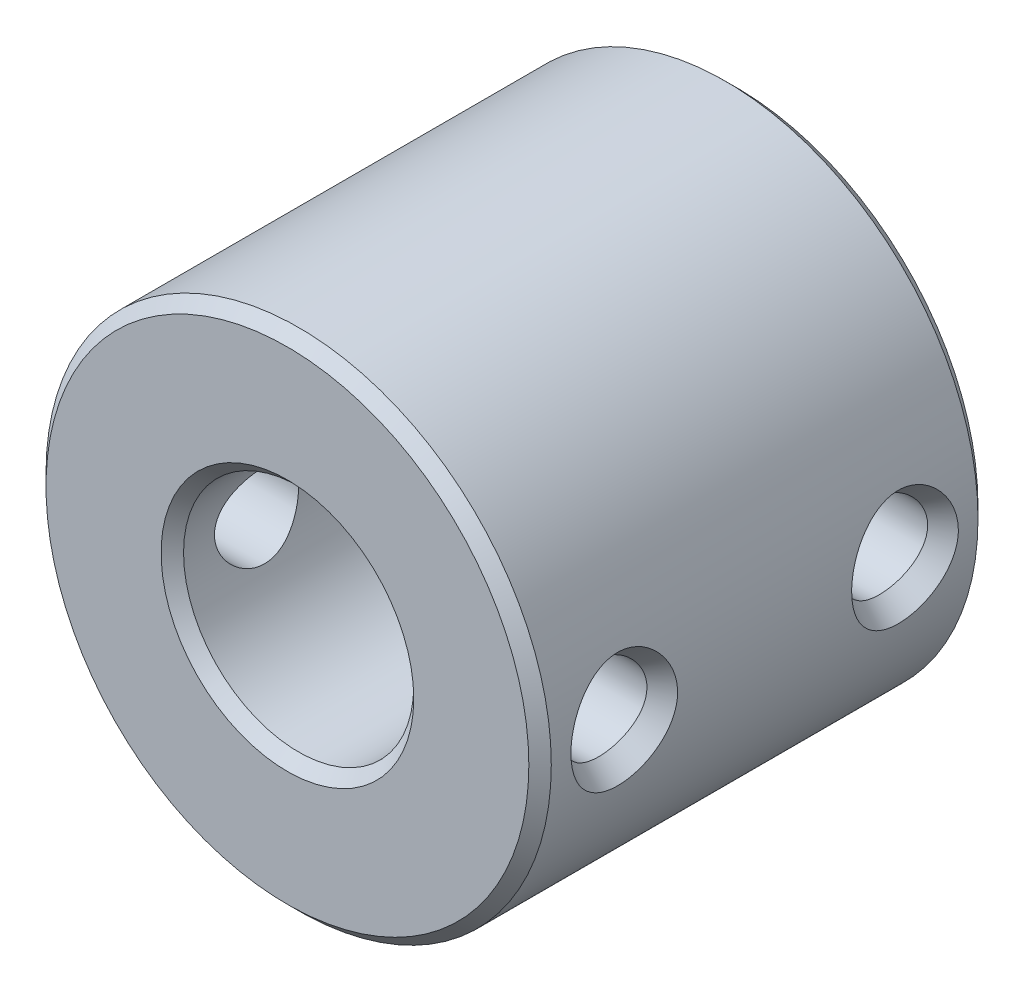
ISO-10303-21;
HEADER;
FILE_DESCRIPTION(('STEP AP214'),'2;1');
FILE_NAME('part.step','',(''),(''),'','','');
FILE_SCHEMA(('AUTOMOTIVE_DESIGN { 1 0 10303 214 1 1 1 1 }'));
ENDSEC;
DATA;
#1=APPLICATION_CONTEXT('core data for automotive mechanical design processes');
#2=APPLICATION_PROTOCOL_DEFINITION('international standard','automotive_design',2000,#1);
#3=PRODUCT_CONTEXT('',#1,'mechanical');
#4=PRODUCT('Part','Part','',(#3));
#5=PRODUCT_RELATED_PRODUCT_CATEGORY('part','',(#4));
#6=PRODUCT_DEFINITION_FORMATION('','',#4);
#7=PRODUCT_DEFINITION_CONTEXT('part definition',#1,'design');
#8=PRODUCT_DEFINITION('design','',#6,#7);
#9=PRODUCT_DEFINITION_SHAPE('','',#8);
#10=(LENGTH_UNIT() NAMED_UNIT(*) SI_UNIT(.MILLI.,.METRE.));
#11=(NAMED_UNIT(*) PLANE_ANGLE_UNIT() SI_UNIT($,.RADIAN.));
#12=(NAMED_UNIT(*) SI_UNIT($,.STERADIAN.) SOLID_ANGLE_UNIT());
#13=UNCERTAINTY_MEASURE_WITH_UNIT(LENGTH_MEASURE(1.E-05),#10,'distance_accuracy_value','');
#14=(GEOMETRIC_REPRESENTATION_CONTEXT(3) GLOBAL_UNCERTAINTY_ASSIGNED_CONTEXT((#13)) GLOBAL_UNIT_ASSIGNED_CONTEXT((#10,
#11,#12)) REPRESENTATION_CONTEXT('',''));
#15=CARTESIAN_POINT('',(0.,0.,0.));
#16=DIRECTION('',(0.,0.,1.));
#17=DIRECTION('',(1.,0.,0.));
#18=AXIS2_PLACEMENT_3D('',#15,#16,#17);
#19=CARTESIAN_POINT('',(0.,0.,8.));
#20=DIRECTION('',(0.,0.,1.));
#21=DIRECTION('',(1.,0.,0.));
#22=AXIS2_PLACEMENT_3D('',#19,#20,#21);
#23=PLANE('',#22);
#24=CARTESIAN_POINT('',(0.,0.,8.));
#25=DIRECTION('',(0.,0.,1.));
#26=DIRECTION('',(1.,0.,0.));
#27=AXIS2_PLACEMENT_3D('',#24,#25,#26);
#28=CIRCLE('',#27,2.25);
#29=CARTESIAN_POINT('',(2.25,0.,8.));
#30=VERTEX_POINT('',#29);
#31=EDGE_CURVE('E219',#30,#30,#28,.F.);
#32=ORIENTED_EDGE('',*,*,#31,.T.);
#33=EDGE_LOOP('',(#32));
#34=FACE_BOUND('',#33,.T.);
#35=CARTESIAN_POINT('',(0.,0.,8.));
#36=DIRECTION('',(0.,0.,1.));
#37=DIRECTION('',(1.,0.,0.));
#38=AXIS2_PLACEMENT_3D('',#35,#36,#37);
#39=CIRCLE('',#38,4.3);
#40=CARTESIAN_POINT('',(4.3,0.,8.));
#41=VERTEX_POINT('',#40);
#42=EDGE_CURVE('E210',#41,#41,#39,.T.);
#43=ORIENTED_EDGE('',*,*,#42,.T.);
#44=EDGE_LOOP('',(#43));
#45=FACE_BOUND('',#44,.T.);
#46=ADVANCED_FACE('F32',(#34,#45),#23,.T.);
#47=CARTESIAN_POINT('',(0.,0.,0.));
#48=DIRECTION('',(0.,0.,1.));
#49=DIRECTION('',(1.,0.,0.));
#50=AXIS2_PLACEMENT_3D('',#47,#48,#49);
#51=PLANE('',#50);
#52=CARTESIAN_POINT('',(0.,0.,0.));
#53=DIRECTION('',(0.,0.,1.));
#54=DIRECTION('',(1.,0.,0.));
#55=AXIS2_PLACEMENT_3D('',#52,#53,#54);
#56=CIRCLE('',#55,2.25);
#57=CARTESIAN_POINT('',(2.25,0.,0.));
#58=VERTEX_POINT('',#57);
#59=EDGE_CURVE('E87',#58,#58,#56,.T.);
#60=ORIENTED_EDGE('',*,*,#59,.T.);
#61=EDGE_LOOP('',(#60));
#62=FACE_BOUND('',#61,.T.);
#63=CARTESIAN_POINT('',(0.,0.,0.));
#64=DIRECTION('',(0.,0.,1.));
#65=DIRECTION('',(1.,0.,0.));
#66=AXIS2_PLACEMENT_3D('',#63,#64,#65);
#67=CIRCLE('',#66,4.3);
#68=CARTESIAN_POINT('',(4.3,0.,0.));
#69=VERTEX_POINT('',#68);
#70=EDGE_CURVE('E222',#69,#69,#67,.F.);
#71=ORIENTED_EDGE('',*,*,#70,.T.);
#72=EDGE_LOOP('',(#71));
#73=FACE_BOUND('',#72,.T.);
#74=ADVANCED_FACE('F227',(#62,#73),#51,.F.);
#75=CARTESIAN_POINT('',(0.,0.,8.));
#76=DIRECTION('',(0.,0.,-1.));
#77=DIRECTION('',(-1.,0.,0.));
#78=AXIS2_PLACEMENT_3D('',#75,#76,#77);
#79=CYLINDRICAL_SURFACE('',#78,4.5);
#80=CARTESIAN_POINT('',(4.5,0.,0.550000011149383));
#81=CARTESIAN_POINT('',(4.50000229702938,0.0171804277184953,0.549989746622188));
#82=CARTESIAN_POINT('',(4.49988851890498,0.0343607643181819,0.550407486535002));
#83=CARTESIAN_POINT('',(4.49944088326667,0.0685498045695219,0.552086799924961));
#84=CARTESIAN_POINT('',(4.4991086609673,0.0855588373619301,0.553342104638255));
#85=CARTESIAN_POINT('',(4.49823873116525,0.119380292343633,0.556673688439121));
#86=CARTESIAN_POINT('',(4.49770235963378,0.136193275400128,0.55874463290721));
#87=CARTESIAN_POINT('',(4.49643905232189,0.169598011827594,0.563683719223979));
#88=CARTESIAN_POINT('',(4.49571320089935,0.186190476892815,0.566547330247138));
#89=CARTESIAN_POINT('',(4.49408570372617,0.219129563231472,0.573048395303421));
#90=CARTESIAN_POINT('',(4.49318493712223,0.235476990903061,0.576681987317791));
#91=CARTESIAN_POINT('',(4.49122236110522,0.267901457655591,0.584699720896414));
#92=CARTESIAN_POINT('',(4.49016126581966,0.283979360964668,0.589080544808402));
#93=CARTESIAN_POINT('',(4.48789273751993,0.315840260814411,0.598569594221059));
#94=CARTESIAN_POINT('',(4.48668588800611,0.331624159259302,0.603674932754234));
#95=CARTESIAN_POINT('',(4.48414052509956,0.362872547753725,0.614589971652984));
#96=CARTESIAN_POINT('',(4.48280249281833,0.378337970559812,0.62039711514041));
#97=CARTESIAN_POINT('',(4.48000941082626,0.408924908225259,0.632692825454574));
#98=CARTESIAN_POINT('',(4.47855476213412,0.424047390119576,0.639179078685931));
#99=CARTESIAN_POINT('',(4.47554307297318,0.453923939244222,0.652810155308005));
#100=CARTESIAN_POINT('',(4.47398637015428,0.468679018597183,0.659952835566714));
#101=CARTESIAN_POINT('',(4.47078518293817,0.497796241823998,0.674873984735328));
#102=CARTESIAN_POINT('',(4.46914098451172,0.512159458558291,0.682650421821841));
#103=CARTESIAN_POINT('',(4.46577940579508,0.540468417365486,0.698816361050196));
#104=CARTESIAN_POINT('',(4.46406226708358,0.554415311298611,0.707203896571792));
#105=CARTESIAN_POINT('',(4.46056940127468,0.581867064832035,0.724569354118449));
#106=CARTESIAN_POINT('',(4.45879387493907,0.595373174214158,0.733545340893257));
#107=CARTESIAN_POINT('',(4.45519882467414,0.621918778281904,0.752065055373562));
#108=CARTESIAN_POINT('',(4.45337946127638,0.634959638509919,0.761606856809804));
#109=CARTESIAN_POINT('',(4.44971132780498,0.660550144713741,0.781235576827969));
#110=CARTESIAN_POINT('',(4.44786267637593,0.673101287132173,0.791320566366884));
#111=CARTESIAN_POINT('',(4.44415055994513,0.697687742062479,0.812013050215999));
#112=CARTESIAN_POINT('',(4.44228716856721,0.709724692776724,0.822618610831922));
#113=CARTESIAN_POINT('',(4.438560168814,0.733258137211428,0.844329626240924));
#114=CARTESIAN_POINT('',(4.43669658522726,0.744756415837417,0.85543314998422));
#115=CARTESIAN_POINT('',(4.43298380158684,0.767187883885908,0.878117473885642));
#116=CARTESIAN_POINT('',(4.43113457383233,0.778123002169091,0.889696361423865));
#117=CARTESIAN_POINT('',(4.42746510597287,0.799403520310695,0.913308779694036));
#118=CARTESIAN_POINT('',(4.42564478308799,0.809750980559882,0.925340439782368));
#119=CARTESIAN_POINT('',(4.4220477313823,0.829831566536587,0.949835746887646));
#120=CARTESIAN_POINT('',(4.42027086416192,0.839566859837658,0.962297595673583));
#121=CARTESIAN_POINT('',(4.41677533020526,0.858398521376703,0.987630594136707));
#122=CARTESIAN_POINT('',(4.41505647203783,0.867497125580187,1.00050005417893));
#123=CARTESIAN_POINT('',(4.41169155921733,0.885030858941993,1.0266255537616));
#124=CARTESIAN_POINT('',(4.41004526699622,0.89346823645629,1.03988005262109));
#125=CARTESIAN_POINT('',(4.40684008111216,0.909655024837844,1.06675286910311));
#126=CARTESIAN_POINT('',(4.40528091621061,0.917406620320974,1.08036983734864));
#127=CARTESIAN_POINT('',(4.40226456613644,0.932197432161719,1.10794479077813));
#128=CARTESIAN_POINT('',(4.40080709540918,0.939238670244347,1.12190165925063));
#129=CARTESIAN_POINT('',(4.39800869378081,0.952584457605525,1.15013357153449));
#130=CARTESIAN_POINT('',(4.39666749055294,0.958890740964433,1.1644077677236));
#131=CARTESIAN_POINT('',(4.39411615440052,0.970742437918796,1.19325145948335));
#132=CARTESIAN_POINT('',(4.39290579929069,0.976289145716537,1.20782040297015));
#133=CARTESIAN_POINT('',(4.39063065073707,0.986597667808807,1.2372306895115));
#134=CARTESIAN_POINT('',(4.38956573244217,0.991360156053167,1.25207178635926));
#135=CARTESIAN_POINT('',(4.38759589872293,1.00007639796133,1.28200347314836));
#136=CARTESIAN_POINT('',(4.38669101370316,1.00402999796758,1.29709410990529));
#137=CARTESIAN_POINT('',(4.38505562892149,1.0111048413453,1.32750198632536));
#138=CARTESIAN_POINT('',(4.3843253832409,1.01422487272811,1.34281952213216));
#139=CARTESIAN_POINT('',(4.38305358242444,1.01960916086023,1.37365835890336));
#140=CARTESIAN_POINT('',(4.38251258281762,1.02187089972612,1.38918012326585));
#141=CARTESIAN_POINT('',(4.3816335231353,1.02551554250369,1.42040465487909));
#142=CARTESIAN_POINT('',(4.38129640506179,1.02689436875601,1.43610792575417));
#143=CARTESIAN_POINT('',(4.38083918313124,1.02874996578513,1.46767289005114));
#144=CARTESIAN_POINT('',(4.38072049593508,1.02922084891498,1.48353495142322));
#145=CARTESIAN_POINT('',(4.3807144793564,1.02923905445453,1.51525957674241));
#146=CARTESIAN_POINT('',(4.38082714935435,1.0287863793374,1.53112214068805));
#147=CARTESIAN_POINT('',(4.38127293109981,1.02696928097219,1.56268919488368));
#148=CARTESIAN_POINT('',(4.38160461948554,1.02561074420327,1.57839404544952));
#149=CARTESIAN_POINT('',(4.38247326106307,1.02200789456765,1.6096227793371));
#150=CARTESIAN_POINT('',(4.38300926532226,1.01976767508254,1.62514716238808));
#151=CARTESIAN_POINT('',(4.38427154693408,1.01442759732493,1.65599224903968));
#152=CARTESIAN_POINT('',(4.38499726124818,1.01133028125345,1.67131341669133));
#153=CARTESIAN_POINT('',(4.38662403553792,1.00430178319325,1.70172953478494));
#154=CARTESIAN_POINT('',(4.3875248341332,1.00037184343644,1.71682478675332));
#155=CARTESIAN_POINT('',(4.38948694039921,0.991703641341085,1.74676664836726));
#156=CARTESIAN_POINT('',(4.3905482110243,0.986965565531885,1.76161331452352));
#157=CARTESIAN_POINT('',(4.3928164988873,0.976706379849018,1.79103565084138));
#158=CARTESIAN_POINT('',(4.39402363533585,0.971184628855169,1.80561108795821));
#159=CARTESIAN_POINT('',(4.39656895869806,0.959383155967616,1.83446864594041));
#160=CARTESIAN_POINT('',(4.39790736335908,0.9531021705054,1.8487502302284));
#161=CARTESIAN_POINT('',(4.40070058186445,0.939807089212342,1.87699776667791));
#162=CARTESIAN_POINT('',(4.40215566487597,0.932791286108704,1.89096288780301));
#163=CARTESIAN_POINT('',(4.40516764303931,0.918051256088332,1.91855516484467));
#164=CARTESIAN_POINT('',(4.40672482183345,0.910325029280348,1.93218122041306));
#165=CARTESIAN_POINT('',(4.40992642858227,0.894188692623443,1.95907300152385));
#166=CARTESIAN_POINT('',(4.41157112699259,0.88577641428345,1.9723373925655));
#167=CARTESIAN_POINT('',(4.41493323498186,0.868292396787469,1.99848343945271));
#168=CARTESIAN_POINT('',(4.41665088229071,0.859218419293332,2.01136356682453));
#169=CARTESIAN_POINT('',(4.42014436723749,0.840435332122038,2.0367186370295));
#170=CARTESIAN_POINT('',(4.42192039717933,0.830723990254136,2.04919189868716));
#171=CARTESIAN_POINT('',(4.42551613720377,0.810690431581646,2.07371074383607));
#172=CARTESIAN_POINT('',(4.42733598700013,0.800366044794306,2.08575453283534));
#173=CARTESIAN_POINT('',(4.43100486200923,0.779130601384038,2.10939189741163));
#174=CARTESIAN_POINT('',(4.43285397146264,0.768217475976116,2.12098360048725));
#175=CARTESIAN_POINT('',(4.43656686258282,0.745828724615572,2.14369422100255));
#176=CARTESIAN_POINT('',(4.43843067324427,0.734351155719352,2.15481121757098));
#177=CARTESIAN_POINT('',(4.44215846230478,0.710857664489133,2.17654982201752));
#178=CARTESIAN_POINT('',(4.44402241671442,0.698839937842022,2.18716948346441));
#179=CARTESIAN_POINT('',(4.44773598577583,0.674290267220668,2.20789079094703));
#180=CARTESIAN_POINT('',(4.44958552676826,0.661756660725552,2.21799048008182));
#181=CARTESIAN_POINT('',(4.45325575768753,0.636199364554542,2.23764920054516));
#182=CARTESIAN_POINT('',(4.4550763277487,0.623174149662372,2.24720627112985));
#183=CARTESIAN_POINT('',(4.45867410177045,0.596657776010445,2.26575710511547));
#184=CARTESIAN_POINT('',(4.46045114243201,0.583165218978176,2.2747489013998));
#185=CARTESIAN_POINT('',(4.46394733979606,0.55573831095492,2.2921465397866));
#186=CARTESIAN_POINT('',(4.46566629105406,0.541802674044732,2.30055039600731));
#187=CARTESIAN_POINT('',(4.46903179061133,0.513513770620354,2.31674951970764));
#188=CARTESIAN_POINT('',(4.47067809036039,0.499159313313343,2.32454275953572));
#189=CARTESIAN_POINT('',(4.47388376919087,0.470056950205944,2.33949803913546));
#190=CARTESIAN_POINT('',(4.47544285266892,0.455307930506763,2.34665797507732));
#191=CARTESIAN_POINT('',(4.47845958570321,0.425440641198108,2.36032407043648));
#192=CARTESIAN_POINT('',(4.479916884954,0.410321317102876,2.36682800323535));
#193=CARTESIAN_POINT('',(4.48271554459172,0.379737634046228,2.37915956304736));
#194=CARTESIAN_POINT('',(4.4840564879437,0.364272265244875,2.38498478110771));
#195=CARTESIAN_POINT('',(4.48660794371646,0.333020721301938,2.39593644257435));
#196=CARTESIAN_POINT('',(4.48781795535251,0.317233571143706,2.40106022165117));
#197=CARTESIAN_POINT('',(4.49009307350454,0.285362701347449,2.41058660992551));
#198=CARTESIAN_POINT('',(4.49115757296,0.269278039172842,2.41498621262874));
#199=CARTESIAN_POINT('',(4.49312721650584,0.236836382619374,2.4230419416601));
#200=CARTESIAN_POINT('',(4.49403161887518,0.220478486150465,2.42669461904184));
#201=CARTESIAN_POINT('',(4.49566664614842,0.187514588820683,2.43323428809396));
#202=CARTESIAN_POINT('',(4.49639636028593,0.17090774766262,2.43611727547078));
#203=CARTESIAN_POINT('',(4.49766762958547,0.137470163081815,2.44109548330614));
#204=CARTESIAN_POINT('',(4.49820806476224,0.12063867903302,2.44318602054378));
#205=CARTESIAN_POINT('',(4.4990864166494,0.0867759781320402,2.44655731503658));
#206=CARTESIAN_POINT('',(4.49942295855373,0.0697441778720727,2.44783257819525));
#207=CARTESIAN_POINT('',(4.49987928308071,0.0355049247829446,2.44955165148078));
#208=CARTESIAN_POINT('',(4.49999738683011,0.0182971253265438,2.44998902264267));
#209=CARTESIAN_POINT('',(4.50000234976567,-0.0161201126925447,2.45000989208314));
#210=CARTESIAN_POINT('',(4.49988919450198,-0.0333295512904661,2.44959333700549));
#211=CARTESIAN_POINT('',(4.49944230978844,-0.0675752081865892,2.44791456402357));
#212=CARTESIAN_POINT('',(4.49911023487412,-0.0846117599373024,2.44665868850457));
#213=CARTESIAN_POINT('',(4.49824048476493,-0.118486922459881,2.44332521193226));
#214=CARTESIAN_POINT('',(4.49770416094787,-0.135326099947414,2.44125300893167));
#215=CARTESIAN_POINT('',(4.49644075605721,-0.168781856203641,2.43631045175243));
#216=CARTESIAN_POINT('',(4.49571477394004,-0.185399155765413,2.43344469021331));
#217=CARTESIAN_POINT('',(4.49408686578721,-0.21838658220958,2.4269385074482));
#218=CARTESIAN_POINT('',(4.49318583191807,-0.234757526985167,2.42330200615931));
#219=CARTESIAN_POINT('',(4.49122258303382,-0.267227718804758,2.41527768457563));
#220=CARTESIAN_POINT('',(4.49016109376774,-0.283327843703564,2.4108932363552));
#221=CARTESIAN_POINT('',(4.48789165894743,-0.315231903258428,2.40139624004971));
#222=CARTESIAN_POINT('',(4.48668430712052,-0.33103675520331,2.39628662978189));
#223=CARTESIAN_POINT('',(4.48413783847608,-0.362325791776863,2.38536241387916));
#224=CARTESIAN_POINT('',(4.48279921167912,-0.377810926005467,2.37955041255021));
#225=CARTESIAN_POINT('',(4.48000485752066,-0.40843605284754,2.36724441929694));
#226=CARTESIAN_POINT('',(4.47854953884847,-0.42357703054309,2.36075278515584));
#227=CARTESIAN_POINT('',(4.47553644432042,-0.453489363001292,2.3471104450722));
#228=CARTESIAN_POINT('',(4.47397901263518,-0.468261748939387,2.33996192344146));
#229=CARTESIAN_POINT('',(4.47077631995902,-0.497412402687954,2.32502865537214));
#230=CARTESIAN_POINT('',(4.4691313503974,-0.51179176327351,2.31724597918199));
#231=CARTESIAN_POINT('',(4.46576819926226,-0.540131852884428,2.30106719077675));
#232=CARTESIAN_POINT('',(4.46405026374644,-0.554093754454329,2.29267308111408));
#233=CARTESIAN_POINT('',(4.4605557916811,-0.581574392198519,2.27529416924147));
#234=CARTESIAN_POINT('',(4.45877945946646,-0.595094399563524,2.26631133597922));
#235=CARTESIAN_POINT('',(4.45518280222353,-0.621666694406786,2.2477776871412));
#236=CARTESIAN_POINT('',(4.45336264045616,-0.634720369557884,2.23822882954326));
#237=CARTESIAN_POINT('',(4.44969293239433,-0.660335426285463,2.2185858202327));
#238=CARTESIAN_POINT('',(4.44784350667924,-0.67289832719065,2.20849362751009));
#239=CARTESIAN_POINT('',(4.44412988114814,-0.697507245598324,2.18778662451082));
#240=CARTESIAN_POINT('',(4.44226575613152,-0.709554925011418,2.17717377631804));
#241=CARTESIAN_POINT('',(4.43853734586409,-0.733108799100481,2.15544813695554));
#242=CARTESIAN_POINT('',(4.4366730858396,-0.744616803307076,2.14433730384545));
#243=CARTESIAN_POINT('',(4.43295902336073,-0.767066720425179,2.12163837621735));
#244=CARTESIAN_POINT('',(4.43110919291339,-0.778010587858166,2.11005222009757));
#245=CARTESIAN_POINT('',(4.42743861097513,-0.799307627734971,2.08642534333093));
#246=CARTESIAN_POINT('',(4.42561777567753,-0.809662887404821,2.0743865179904));
#247=CARTESIAN_POINT('',(4.42201980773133,-0.829758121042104,2.04987702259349));
#248=CARTESIAN_POINT('',(4.42024253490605,-0.839500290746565,2.03740817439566));
#249=CARTESIAN_POINT('',(4.41674631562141,-0.858344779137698,2.01206138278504));
#250=CARTESIAN_POINT('',(4.41502717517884,-0.867449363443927,1.99918515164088));
#251=CARTESIAN_POINT('',(4.41166184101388,-0.884994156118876,1.97304637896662));
#252=CARTESIAN_POINT('',(4.41001540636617,-0.893436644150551,1.95978539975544));
#253=CARTESIAN_POINT('',(4.40681009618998,-0.909632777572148,1.93289995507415));
#254=CARTESIAN_POINT('',(4.40525094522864,-0.91738864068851,1.91927685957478));
#255=CARTESIAN_POINT('',(4.40223480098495,-0.932187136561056,1.89169004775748));
#256=CARTESIAN_POINT('',(4.40077751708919,-0.939231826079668,1.87772746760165));
#257=CARTESIAN_POINT('',(4.39797968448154,-0.952583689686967,1.84948459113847));
#258=CARTESIAN_POINT('',(4.3966388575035,-0.958892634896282,1.8352051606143));
#259=CARTESIAN_POINT('',(4.39408848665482,-0.970748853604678,1.80635152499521));
#260=CARTESIAN_POINT('',(4.39287871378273,-0.976297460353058,1.79177788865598));
#261=CARTESIAN_POINT('',(4.39060495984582,-0.986609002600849,1.7623587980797));
#262=CARTESIAN_POINT('',(4.38954084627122,-0.991372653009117,1.74751360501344));
#263=CARTESIAN_POINT('',(4.38757286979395,-1.00009046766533,1.71757439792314));
#264=CARTESIAN_POINT('',(4.38666902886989,-1.00404452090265,1.70248035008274));
#265=CARTESIAN_POINT('',(4.38503599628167,-1.0111195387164,1.67206628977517));
#266=CARTESIAN_POINT('',(4.38430704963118,-1.0142393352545,1.65674599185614));
#267=CARTESIAN_POINT('',(4.38303813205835,-1.01962246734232,1.62590270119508));
#268=CARTESIAN_POINT('',(4.38249870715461,-1.02188332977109,1.61037925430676));
#269=CARTESIAN_POINT('',(4.3816230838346,-1.02552548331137,1.57915111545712));
#270=CARTESIAN_POINT('',(4.3812878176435,-1.02690274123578,1.56344592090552));
#271=CARTESIAN_POINT('',(4.38094850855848,-1.02828948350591,1.53981200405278));
#272=CARTESIAN_POINT('',(4.38086266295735,-1.02863855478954,1.53190293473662));
#273=CARTESIAN_POINT('',(4.38074721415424,-1.02910773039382,1.51604805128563));
#274=CARTESIAN_POINT('',(4.38071782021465,-1.02922698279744,1.50810220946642));
#275=CARTESIAN_POINT('',(4.38071706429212,-1.02923330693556,1.492210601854));
#276=CARTESIAN_POINT('',(4.38074570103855,-1.02912038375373,1.48426483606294));
#277=CARTESIAN_POINT('',(4.38085960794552,-1.02866345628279,1.46841025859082));
#278=CARTESIAN_POINT('',(4.38094466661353,-1.02832031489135,1.46050141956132));
#279=CARTESIAN_POINT('',(4.38128158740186,-1.0269509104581,1.43686882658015));
#280=CARTESIAN_POINT('',(4.38161521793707,-1.0255846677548,1.42116448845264));
#281=CARTESIAN_POINT('',(4.38248752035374,-1.02196335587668,1.38993856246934));
#282=CARTESIAN_POINT('',(4.38302524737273,-1.01971238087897,1.37441646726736));
#283=CARTESIAN_POINT('',(4.38429073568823,-1.0143479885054,1.34357630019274));
#284=CARTESIAN_POINT('',(4.38501794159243,-1.01123709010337,1.32825776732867));
#285=CARTESIAN_POINT('',(4.38664747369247,-1.00417895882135,1.2978475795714));
#286=CARTESIAN_POINT('',(4.38754954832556,-1.00023292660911,1.28275563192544));
#287=CARTESIAN_POINT('',(4.38951398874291,-0.991530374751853,1.25282088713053));
#288=CARTESIAN_POINT('',(4.39057632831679,-0.986773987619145,1.23797804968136));
#289=CARTESIAN_POINT('',(4.39284654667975,-0.97647631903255,1.20856385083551));
#290=CARTESIAN_POINT('',(4.39405455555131,-0.970934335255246,1.19399274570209));
#291=CARTESIAN_POINT('',(4.39660142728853,-0.95909083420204,1.16514427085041));
#292=CARTESIAN_POINT('',(4.39794051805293,-0.95278798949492,1.15086746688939));
#293=CARTESIAN_POINT('',(4.4007349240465,-0.939447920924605,1.1226298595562));
#294=CARTESIAN_POINT('',(4.40219051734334,-0.932408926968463,1.10866992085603));
#295=CARTESIAN_POINT('',(4.40520334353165,-0.917621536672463,1.08108832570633));
#296=CARTESIAN_POINT('',(4.40676086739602,-0.909871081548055,1.06746780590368));
#297=CARTESIAN_POINT('',(4.40996300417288,-0.893685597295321,1.04058736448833));
#298=CARTESIAN_POINT('',(4.41160789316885,-0.885248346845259,1.02732881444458));
#299=CARTESIAN_POINT('',(4.41497023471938,-0.86771397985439,1.00119467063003));
#300=CARTESIAN_POINT('',(4.41668792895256,-0.858614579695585,0.988320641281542));
#301=CARTESIAN_POINT('',(4.42018137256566,-0.839780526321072,0.962977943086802));
#302=CARTESIAN_POINT('',(4.42195731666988,-0.830043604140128,0.950510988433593));
#303=CARTESIAN_POINT('',(4.42555276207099,-0.809959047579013,0.92600488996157));
#304=CARTESIAN_POINT('',(4.42737240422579,-0.79960921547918,0.913967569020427));
#305=CARTESIAN_POINT('',(4.43104075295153,-0.778323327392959,0.8903432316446));
#306=CARTESIAN_POINT('',(4.43288954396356,-0.767385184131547,0.878758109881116));
#307=CARTESIAN_POINT('',(4.43660169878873,-0.74494712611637,0.856060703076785));
#308=CARTESIAN_POINT('',(4.43846509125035,-0.733445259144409,0.844950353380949));
#309=CARTESIAN_POINT('',(4.44219195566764,-0.709904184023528,0.823225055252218));
#310=CARTESIAN_POINT('',(4.44405540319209,-0.697863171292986,0.812612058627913));
#311=CARTESIAN_POINT('',(4.44776788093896,-0.673268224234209,0.791904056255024));
#312=CARTESIAN_POINT('',(4.44961683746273,-0.660712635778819,0.781811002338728));
#313=CARTESIAN_POINT('',(4.45328583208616,-0.635112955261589,0.762165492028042));
#314=CARTESIAN_POINT('',(4.45510575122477,-0.622067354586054,0.752614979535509));
#315=CARTESIAN_POINT('',(4.45870216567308,-0.595512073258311,0.734077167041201));
#316=CARTESIAN_POINT('',(4.46047850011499,-0.58200101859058,0.725091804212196));
#317=CARTESIAN_POINT('',(4.46397323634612,-0.554539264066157,0.70770690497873));
#318=CARTESIAN_POINT('',(4.46569143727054,-0.540587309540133,0.699309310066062));
#319=CARTESIAN_POINT('',(4.46905539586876,-0.512268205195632,0.683122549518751));
#320=CARTESIAN_POINT('',(4.47070091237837,-0.497899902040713,0.675335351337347));
#321=CARTESIAN_POINT('',(4.47390499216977,-0.468772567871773,0.660391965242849));
#322=CARTESIAN_POINT('',(4.47546327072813,-0.454012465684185,0.653237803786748));
#323=CARTESIAN_POINT('',(4.47847836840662,-0.424126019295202,0.639583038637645));
#324=CARTESIAN_POINT('',(4.47993485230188,-0.408998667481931,0.63308456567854));
#325=CARTESIAN_POINT('',(4.48273186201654,-0.378402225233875,0.620763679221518));
#326=CARTESIAN_POINT('',(4.48407199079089,-0.362932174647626,0.614943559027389));
#327=CARTESIAN_POINT('',(4.48662180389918,-0.331674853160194,0.604001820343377));
#328=CARTESIAN_POINT('',(4.48783101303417,-0.31588665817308,0.598882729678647));
#329=CARTESIAN_POINT('',(4.49010451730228,-0.284017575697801,0.589365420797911));
#330=CARTESIAN_POINT('',(4.49116823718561,-0.267935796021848,0.584970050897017));
#331=CARTESIAN_POINT('',(4.49313631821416,-0.23550407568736,0.576922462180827));
#332=CARTESIAN_POINT('',(4.49403997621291,-0.219153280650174,0.573273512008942));
#333=CARTESIAN_POINT('',(4.49567351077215,-0.186208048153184,0.566740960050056));
#334=CARTESIAN_POINT('',(4.4964025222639,-0.169612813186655,0.563861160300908));
#335=CARTESIAN_POINT('',(4.49767240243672,-0.136203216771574,0.558888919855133));
#336=CARTESIAN_POINT('',(4.4982122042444,-0.119388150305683,0.556800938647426));
#337=CARTESIAN_POINT('',(4.49908924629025,-0.0855632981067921,0.553434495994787));
#338=CARTESIAN_POINT('',(4.4994251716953,-0.0685529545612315,0.552161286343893));
#339=CARTESIAN_POINT('',(4.49988045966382,-0.0343621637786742,0.55044538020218));
#340=CARTESIAN_POINT('',(4.4999982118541,-0.0171813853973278,0.550008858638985));
#341=CARTESIAN_POINT('',(4.5,0.,0.550000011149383));
#342=B_SPLINE_CURVE_WITH_KNOTS('',3,(#80,#81,#82,#83,#84,#85,#86,#87,#88,#89,#90,#91,#92,#93,
#94,#95,#96,#97,#98,#99,#100,#101,#102,#103,#104,#105,#106,#107,#108,#109,#110,#111,#112,#113,
#114,#115,#116,#117,#118,#119,#120,#121,#122,#123,#124,#125,#126,#127,#128,#129,#130,#131,#132,
#133,#134,#135,#136,#137,#138,#139,#140,#141,#142,#143,#144,#145,#146,#147,#148,#149,#150,#151,
#152,#153,#154,#155,#156,#157,#158,#159,#160,#161,#162,#163,#164,#165,#166,#167,#168,#169,#170,
#171,#172,#173,#174,#175,#176,#177,#178,#179,#180,#181,#182,#183,#184,#185,#186,#187,#188,#189,
#190,#191,#192,#193,#194,#195,#196,#197,#198,#199,#200,#201,#202,#203,#204,#205,#206,#207,#208,
#209,#210,#211,#212,#213,#214,#215,#216,#217,#218,#219,#220,#221,#222,#223,#224,#225,#226,#227,
#228,#229,#230,#231,#232,#233,#234,#235,#236,#237,#238,#239,#240,#241,#242,#243,#244,#245,#246,
#247,#248,#249,#250,#251,#252,#253,#254,#255,#256,#257,#258,#259,#260,#261,#262,#263,#264,#265,
#266,#267,#268,#269,#270,#271,#272,#273,#274,#275,#276,#277,#278,#279,#280,#281,#282,#283,#284,
#285,#286,#287,#288,#289,#290,#291,#292,#293,#294,#295,#296,#297,#298,#299,#300,#301,#302,#303,
#304,#305,#306,#307,#308,#309,#310,#311,#312,#313,#314,#315,#316,#317,#318,#319,#320,#321,#322,
#323,#324,#325,#326,#327,#328,#329,#330,#331,#332,#333,#334,#335,#336,#337,#338,#339,#340,#341),
.UNSPECIFIED.,.F.,.F.,(4,2,2,2,2,2,2,2,2,2,2,2,2,2,2,2,2,2,2,2,2,2,2,2,2,2,2,2,2,2,2,2,2,2,2,2,
2,2,2,2,2,2,2,2,2,2,2,2,2,2,2,2,2,2,2,2,2,2,2,2,2,2,2,2,2,2,2,2,2,2,2,2,2,2,2,2,2,2,2,2,2,2,2,2,
2,2,2,2,2,2,2,2,2,2,2,2,2,2,2,2,2,2,2,2,2,2,2,2,2,2,2,2,2,2,2,2,2,2,2,2,2,2,2,2,2,2,2,2,2,2,4),
(0.,0.051535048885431,0.102688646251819,0.153513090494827,0.204052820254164,0.254344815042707,
0.304419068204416,0.354299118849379,0.404002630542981,0.453542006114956,0.502925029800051,
0.552155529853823,0.60123405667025,0.65015857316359,0.698925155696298,0.747528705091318,
0.795963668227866,0.844224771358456,0.892307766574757,0.940210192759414,0.987932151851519,
1.03547710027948,1.08285265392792,1.13007140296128,1.17715173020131,1.2241186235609,
1.27100446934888,1.31784980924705,1.36470403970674,1.41162602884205,1.45868462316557,
1.50595901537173,1.55353894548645,1.60111874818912,1.64839234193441,1.6954490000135,
1.74236755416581,1.78921659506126,1.83605483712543,1.88293162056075,1.92988752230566,
1.97695504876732,2.02415938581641,2.07151918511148,2.11904736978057,2.16675194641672,
2.21463681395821,2.26270256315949,2.31094726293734,2.35936723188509,2.40795779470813,
2.45671402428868,2.50563147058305,2.55470687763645,2.60393888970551,2.6533287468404,
2.70288096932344,2.75260402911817,2.80251100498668,2.85262021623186,2.90295582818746,
2.95354842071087,3.00443550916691,3.05566200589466,3.10728060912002,3.15890243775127,
3.21013852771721,3.26104135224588,3.31165552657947,3.36201820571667,3.41215955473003,
3.46210327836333,3.51186719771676,3.56146386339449,3.61090119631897,3.66018314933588,
3.70931038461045,3.75828096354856,3.80709104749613,3.85573560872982,3.90420915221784,
3.95250644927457,4.00062328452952,4.04855721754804,4.09630835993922,4.14388016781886,
4.19128024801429,4.23852117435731,4.28562130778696,4.33260561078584,4.37950644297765,
4.42636432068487,4.47322861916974,4.52015819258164,4.56722188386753,4.61449889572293,
4.63824768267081,4.66208433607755,4.68592046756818,4.70966775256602,4.75693915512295,
4.80399433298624,4.85091310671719,4.89776487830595,4.94460899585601,4.99149525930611,
5.03846453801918,5.08554947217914,5.13277523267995,5.18016031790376,5.22771736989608,
5.27545399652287,5.3233735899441,5.37147613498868,5.41975900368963,5.46821773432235,
5.51684679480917,5.56564033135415,5.61459290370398,5.66370020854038,5.71295979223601,
5.76237175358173,5.81193943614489,5.86167010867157,5.91157563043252,5.96167309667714,
6.01198545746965,6.06254210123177,6.11337939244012,6.16454115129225,6.21607906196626),.UNSPECIFIED.);
#343=CARTESIAN_POINT('',(4.5,0.,0.550000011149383));
#344=VERTEX_POINT('',#343);
#345=EDGE_CURVE('E57',#344,#344,#342,.F.);
#346=ORIENTED_EDGE('',*,*,#345,.T.);
#347=EDGE_LOOP('',(#346));
#348=FACE_BOUND('',#347,.T.);
#349=CARTESIAN_POINT('',(4.5,0.,5.55000001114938));
#350=CARTESIAN_POINT('',(4.50000229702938,0.0171804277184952,5.54998974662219));
#351=CARTESIAN_POINT('',(4.49988851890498,0.0343607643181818,5.550407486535));
#352=CARTESIAN_POINT('',(4.49944088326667,0.0685498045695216,5.55208679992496));
#353=CARTESIAN_POINT('',(4.4991086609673,0.0855588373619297,5.55334210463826));
#354=CARTESIAN_POINT('',(4.49823873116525,0.119380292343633,5.55667368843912));
#355=CARTESIAN_POINT('',(4.49770235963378,0.136193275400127,5.55874463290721));
#356=CARTESIAN_POINT('',(4.49643905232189,0.169598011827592,5.56368371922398));
#357=CARTESIAN_POINT('',(4.49571320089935,0.186190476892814,5.56654733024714));
#358=CARTESIAN_POINT('',(4.49408570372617,0.219129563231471,5.57304839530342));
#359=CARTESIAN_POINT('',(4.49318493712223,0.235476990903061,5.57668198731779));
#360=CARTESIAN_POINT('',(4.49122236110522,0.26790145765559,5.58469972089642));
#361=CARTESIAN_POINT('',(4.49016126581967,0.283979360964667,5.5890805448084));
#362=CARTESIAN_POINT('',(4.48789273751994,0.31584026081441,5.59856959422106));
#363=CARTESIAN_POINT('',(4.48668588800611,0.331624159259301,5.60367493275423));
#364=CARTESIAN_POINT('',(4.48414052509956,0.362872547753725,5.61458997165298));
#365=CARTESIAN_POINT('',(4.48280249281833,0.378337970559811,5.62039711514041));
#366=CARTESIAN_POINT('',(4.48000941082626,0.408924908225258,5.63269282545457));
#367=CARTESIAN_POINT('',(4.47855476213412,0.424047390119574,5.63917907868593));
#368=CARTESIAN_POINT('',(4.47554307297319,0.453923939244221,5.65281015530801));
#369=CARTESIAN_POINT('',(4.47398637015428,0.468679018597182,5.65995283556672));
#370=CARTESIAN_POINT('',(4.47078518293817,0.497796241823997,5.67487398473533));
#371=CARTESIAN_POINT('',(4.46914098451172,0.51215945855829,5.68265042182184));
#372=CARTESIAN_POINT('',(4.46577940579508,0.540468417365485,5.6988163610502));
#373=CARTESIAN_POINT('',(4.46406226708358,0.554415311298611,5.70720389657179));
#374=CARTESIAN_POINT('',(4.46056940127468,0.581867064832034,5.72456935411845));
#375=CARTESIAN_POINT('',(4.45879387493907,0.595373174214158,5.73354534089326));
#376=CARTESIAN_POINT('',(4.45519882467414,0.621918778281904,5.75206505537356));
#377=CARTESIAN_POINT('',(4.45337946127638,0.634959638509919,5.7616068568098));
#378=CARTESIAN_POINT('',(4.44971132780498,0.660550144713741,5.78123557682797));
#379=CARTESIAN_POINT('',(4.44786267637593,0.673101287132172,5.79132056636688));
#380=CARTESIAN_POINT('',(4.44415055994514,0.697687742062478,5.812013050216));
#381=CARTESIAN_POINT('',(4.44228716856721,0.709724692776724,5.82261861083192));
#382=CARTESIAN_POINT('',(4.438560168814,0.733258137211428,5.84432962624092));
#383=CARTESIAN_POINT('',(4.43669658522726,0.744756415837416,5.85543314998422));
#384=CARTESIAN_POINT('',(4.43298380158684,0.767187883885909,5.87811747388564));
#385=CARTESIAN_POINT('',(4.43113457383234,0.778123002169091,5.88969636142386));
#386=CARTESIAN_POINT('',(4.42746510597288,0.799403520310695,5.91330877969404));
#387=CARTESIAN_POINT('',(4.42564478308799,0.809750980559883,5.92534043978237));
#388=CARTESIAN_POINT('',(4.4220477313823,0.829831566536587,5.94983574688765));
#389=CARTESIAN_POINT('',(4.42027086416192,0.839566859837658,5.96229759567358));
#390=CARTESIAN_POINT('',(4.41677533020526,0.858398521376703,5.98763059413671));
#391=CARTESIAN_POINT('',(4.41505647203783,0.867497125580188,6.00050005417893));
#392=CARTESIAN_POINT('',(4.41169155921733,0.885030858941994,6.0266255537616));
#393=CARTESIAN_POINT('',(4.41004526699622,0.89346823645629,6.03988005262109));
#394=CARTESIAN_POINT('',(4.40684008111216,0.909655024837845,6.06675286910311));
#395=CARTESIAN_POINT('',(4.40528091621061,0.917406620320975,6.08036983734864));
#396=CARTESIAN_POINT('',(4.40226456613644,0.932197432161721,6.10794479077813));
#397=CARTESIAN_POINT('',(4.40080709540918,0.939238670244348,6.12190165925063));
#398=CARTESIAN_POINT('',(4.39800869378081,0.952584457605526,6.15013357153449));
#399=CARTESIAN_POINT('',(4.39666749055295,0.958890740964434,6.16440776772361));
#400=CARTESIAN_POINT('',(4.39411615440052,0.970742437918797,6.19325145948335));
#401=CARTESIAN_POINT('',(4.39290579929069,0.976289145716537,6.20782040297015));
#402=CARTESIAN_POINT('',(4.39063065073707,0.986597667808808,6.2372306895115));
#403=CARTESIAN_POINT('',(4.38956573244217,0.991360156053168,6.25207178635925));
#404=CARTESIAN_POINT('',(4.38759589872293,1.00007639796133,6.28200347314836));
#405=CARTESIAN_POINT('',(4.38669101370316,1.00402999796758,6.29709410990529));
#406=CARTESIAN_POINT('',(4.3850556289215,1.0111048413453,6.32750198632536));
#407=CARTESIAN_POINT('',(4.38432538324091,1.01422487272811,6.34281952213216));
#408=CARTESIAN_POINT('',(4.38305358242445,1.01960916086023,6.37365835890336));
#409=CARTESIAN_POINT('',(4.38251258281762,1.02187089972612,6.38918012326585));
#410=CARTESIAN_POINT('',(4.3816335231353,1.02551554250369,6.42040465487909));
#411=CARTESIAN_POINT('',(4.38129640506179,1.02689436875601,6.43610792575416));
#412=CARTESIAN_POINT('',(4.38083918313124,1.02874996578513,6.46767289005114));
#413=CARTESIAN_POINT('',(4.38072049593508,1.02922084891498,6.48353495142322));
#414=CARTESIAN_POINT('',(4.3807144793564,1.02923905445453,6.51525957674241));
#415=CARTESIAN_POINT('',(4.38082714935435,1.0287863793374,6.53112214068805));
#416=CARTESIAN_POINT('',(4.38127293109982,1.02696928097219,6.56268919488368));
#417=CARTESIAN_POINT('',(4.38160461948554,1.02561074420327,6.57839404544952));
#418=CARTESIAN_POINT('',(4.38247326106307,1.02200789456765,6.6096227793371));
#419=CARTESIAN_POINT('',(4.38300926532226,1.01976767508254,6.62514716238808));
#420=CARTESIAN_POINT('',(4.38427154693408,1.01442759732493,6.65599224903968));
#421=CARTESIAN_POINT('',(4.38499726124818,1.01133028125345,6.67131341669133));
#422=CARTESIAN_POINT('',(4.38662403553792,1.00430178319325,6.70172953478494));
#423=CARTESIAN_POINT('',(4.38752483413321,1.00037184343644,6.71682478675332));
#424=CARTESIAN_POINT('',(4.38948694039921,0.991703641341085,6.74676664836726));
#425=CARTESIAN_POINT('',(4.3905482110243,0.986965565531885,6.76161331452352));
#426=CARTESIAN_POINT('',(4.3928164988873,0.976706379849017,6.79103565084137));
#427=CARTESIAN_POINT('',(4.39402363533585,0.971184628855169,6.80561108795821));
#428=CARTESIAN_POINT('',(4.39656895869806,0.959383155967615,6.83446864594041));
#429=CARTESIAN_POINT('',(4.39790736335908,0.953102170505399,6.8487502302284));
#430=CARTESIAN_POINT('',(4.40070058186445,0.939807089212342,6.87699776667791));
#431=CARTESIAN_POINT('',(4.40215566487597,0.932791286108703,6.890962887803));
#432=CARTESIAN_POINT('',(4.40516764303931,0.918051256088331,6.91855516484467));
#433=CARTESIAN_POINT('',(4.40672482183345,0.910325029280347,6.93218122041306));
#434=CARTESIAN_POINT('',(4.40992642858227,0.894188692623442,6.95907300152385));
#435=CARTESIAN_POINT('',(4.41157112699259,0.885776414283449,6.9723373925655));
#436=CARTESIAN_POINT('',(4.41493323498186,0.868292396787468,6.99848343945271));
#437=CARTESIAN_POINT('',(4.41665088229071,0.859218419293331,7.01136356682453));
#438=CARTESIAN_POINT('',(4.42014436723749,0.840435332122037,7.0367186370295));
#439=CARTESIAN_POINT('',(4.42192039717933,0.830723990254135,7.04919189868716));
#440=CARTESIAN_POINT('',(4.42551613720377,0.810690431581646,7.07371074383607));
#441=CARTESIAN_POINT('',(4.42733598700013,0.800366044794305,7.08575453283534));
#442=CARTESIAN_POINT('',(4.43100486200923,0.779130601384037,7.10939189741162));
#443=CARTESIAN_POINT('',(4.43285397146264,0.768217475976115,7.12098360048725));
#444=CARTESIAN_POINT('',(4.43656686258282,0.745828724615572,7.14369422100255));
#445=CARTESIAN_POINT('',(4.43843067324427,0.734351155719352,7.15481121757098));
#446=CARTESIAN_POINT('',(4.44215846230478,0.710857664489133,7.17654982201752));
#447=CARTESIAN_POINT('',(4.44402241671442,0.698839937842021,7.18716948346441));
#448=CARTESIAN_POINT('',(4.44773598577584,0.674290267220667,7.20789079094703));
#449=CARTESIAN_POINT('',(4.44958552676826,0.661756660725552,7.21799048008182));
#450=CARTESIAN_POINT('',(4.45325575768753,0.636199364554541,7.23764920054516));
#451=CARTESIAN_POINT('',(4.4550763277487,0.623174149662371,7.24720627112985));
#452=CARTESIAN_POINT('',(4.45867410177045,0.596657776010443,7.26575710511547));
#453=CARTESIAN_POINT('',(4.46045114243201,0.583165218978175,7.2747489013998));
#454=CARTESIAN_POINT('',(4.46394733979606,0.555738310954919,7.2921465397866));
#455=CARTESIAN_POINT('',(4.46566629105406,0.541802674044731,7.30055039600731));
#456=CARTESIAN_POINT('',(4.46903179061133,0.513513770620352,7.31674951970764));
#457=CARTESIAN_POINT('',(4.4706780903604,0.499159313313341,7.32454275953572));
#458=CARTESIAN_POINT('',(4.47388376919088,0.470056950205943,7.33949803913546));
#459=CARTESIAN_POINT('',(4.47544285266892,0.455307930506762,7.34665797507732));
#460=CARTESIAN_POINT('',(4.47845958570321,0.425440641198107,7.36032407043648));
#461=CARTESIAN_POINT('',(4.47991688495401,0.410321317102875,7.36682800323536));
#462=CARTESIAN_POINT('',(4.48271554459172,0.379737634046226,7.37915956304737));
#463=CARTESIAN_POINT('',(4.4840564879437,0.364272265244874,7.38498478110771));
#464=CARTESIAN_POINT('',(4.48660794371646,0.333020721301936,7.39593644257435));
#465=CARTESIAN_POINT('',(4.48781795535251,0.317233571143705,7.40106022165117));
#466=CARTESIAN_POINT('',(4.49009307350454,0.285362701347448,7.41058660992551));
#467=CARTESIAN_POINT('',(4.49115757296,0.269278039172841,7.41498621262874));
#468=CARTESIAN_POINT('',(4.49312721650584,0.236836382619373,7.4230419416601));
#469=CARTESIAN_POINT('',(4.49403161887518,0.220478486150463,7.42669461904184));
#470=CARTESIAN_POINT('',(4.49566664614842,0.187514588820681,7.43323428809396));
#471=CARTESIAN_POINT('',(4.49639636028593,0.170907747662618,7.43611727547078));
#472=CARTESIAN_POINT('',(4.49766762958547,0.137470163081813,7.44109548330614));
#473=CARTESIAN_POINT('',(4.49820806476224,0.120638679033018,7.44318602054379));
#474=CARTESIAN_POINT('',(4.4990864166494,0.0867759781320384,7.44655731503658));
#475=CARTESIAN_POINT('',(4.49942295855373,0.0697441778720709,7.44783257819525));
#476=CARTESIAN_POINT('',(4.49987928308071,0.0355049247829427,7.44955165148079));
#477=CARTESIAN_POINT('',(4.49999738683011,0.0182971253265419,7.44998902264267));
#478=CARTESIAN_POINT('',(4.50000234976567,-0.0161201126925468,7.45000989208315));
#479=CARTESIAN_POINT('',(4.49988919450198,-0.0333295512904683,7.44959333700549));
#480=CARTESIAN_POINT('',(4.49944230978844,-0.0675752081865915,7.44791456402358));
#481=CARTESIAN_POINT('',(4.49911023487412,-0.0846117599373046,7.44665868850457));
#482=CARTESIAN_POINT('',(4.49824048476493,-0.118486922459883,7.44332521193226));
#483=CARTESIAN_POINT('',(4.49770416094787,-0.135326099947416,7.44125300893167));
#484=CARTESIAN_POINT('',(4.49644075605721,-0.168781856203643,7.43631045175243));
#485=CARTESIAN_POINT('',(4.49571477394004,-0.185399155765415,7.43344469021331));
#486=CARTESIAN_POINT('',(4.49408686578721,-0.218386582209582,7.4269385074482));
#487=CARTESIAN_POINT('',(4.49318583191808,-0.234757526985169,7.42330200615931));
#488=CARTESIAN_POINT('',(4.49122258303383,-0.26722771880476,7.41527768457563));
#489=CARTESIAN_POINT('',(4.49016109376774,-0.283327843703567,7.4108932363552));
#490=CARTESIAN_POINT('',(4.48789165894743,-0.31523190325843,7.40139624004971));
#491=CARTESIAN_POINT('',(4.48668430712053,-0.331036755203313,7.39628662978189));
#492=CARTESIAN_POINT('',(4.48413783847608,-0.362325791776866,7.38536241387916));
#493=CARTESIAN_POINT('',(4.48279921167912,-0.377810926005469,7.37955041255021));
#494=CARTESIAN_POINT('',(4.48000485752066,-0.408436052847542,7.36724441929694));
#495=CARTESIAN_POINT('',(4.47854953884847,-0.423577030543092,7.36075278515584));
#496=CARTESIAN_POINT('',(4.47553644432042,-0.453489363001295,7.3471104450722));
#497=CARTESIAN_POINT('',(4.47397901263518,-0.468261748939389,7.33996192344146));
#498=CARTESIAN_POINT('',(4.47077631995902,-0.497412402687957,7.32502865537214));
#499=CARTESIAN_POINT('',(4.4691313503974,-0.511791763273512,7.31724597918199));
#500=CARTESIAN_POINT('',(4.46576819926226,-0.54013185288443,7.30106719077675));
#501=CARTESIAN_POINT('',(4.46405026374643,-0.554093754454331,7.29267308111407));
#502=CARTESIAN_POINT('',(4.4605557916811,-0.581574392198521,7.27529416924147));
#503=CARTESIAN_POINT('',(4.45877945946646,-0.595094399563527,7.26631133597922));
#504=CARTESIAN_POINT('',(4.45518280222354,-0.621666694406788,7.24777768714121));
#505=CARTESIAN_POINT('',(4.45336264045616,-0.634720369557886,7.23822882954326));
#506=CARTESIAN_POINT('',(4.44969293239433,-0.660335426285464,7.2185858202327));
#507=CARTESIAN_POINT('',(4.44784350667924,-0.672898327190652,7.20849362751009));
#508=CARTESIAN_POINT('',(4.44412988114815,-0.697507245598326,7.18778662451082));
#509=CARTESIAN_POINT('',(4.44226575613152,-0.709554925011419,7.17717377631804));
#510=CARTESIAN_POINT('',(4.43853734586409,-0.733108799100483,7.15544813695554));
#511=CARTESIAN_POINT('',(4.4366730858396,-0.744616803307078,7.14433730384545));
#512=CARTESIAN_POINT('',(4.43295902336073,-0.767066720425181,7.12163837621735));
#513=CARTESIAN_POINT('',(4.43110919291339,-0.778010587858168,7.11005222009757));
#514=CARTESIAN_POINT('',(4.42743861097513,-0.799307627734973,7.08642534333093));
#515=CARTESIAN_POINT('',(4.42561777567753,-0.809662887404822,7.0743865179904));
#516=CARTESIAN_POINT('',(4.42201980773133,-0.829758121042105,7.04987702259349));
#517=CARTESIAN_POINT('',(4.42024253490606,-0.839500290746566,7.03740817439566));
#518=CARTESIAN_POINT('',(4.41674631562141,-0.8583447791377,7.01206138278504));
#519=CARTESIAN_POINT('',(4.41502717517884,-0.867449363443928,6.99918515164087));
#520=CARTESIAN_POINT('',(4.41166184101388,-0.884994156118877,6.97304637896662));
#521=CARTESIAN_POINT('',(4.41001540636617,-0.893436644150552,6.95978539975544));
#522=CARTESIAN_POINT('',(4.40681009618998,-0.90963277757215,6.93289995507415));
#523=CARTESIAN_POINT('',(4.40525094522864,-0.917388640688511,6.91927685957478));
#524=CARTESIAN_POINT('',(4.40223480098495,-0.932187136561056,6.89169004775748));
#525=CARTESIAN_POINT('',(4.40077751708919,-0.939231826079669,6.87772746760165));
#526=CARTESIAN_POINT('',(4.39797968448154,-0.952583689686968,6.84948459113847));
#527=CARTESIAN_POINT('',(4.3966388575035,-0.958892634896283,6.8352051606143));
#528=CARTESIAN_POINT('',(4.39408848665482,-0.970748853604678,6.8063515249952));
#529=CARTESIAN_POINT('',(4.39287871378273,-0.976297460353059,6.79177788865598));
#530=CARTESIAN_POINT('',(4.39060495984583,-0.98660900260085,6.7623587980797));
#531=CARTESIAN_POINT('',(4.38954084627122,-0.991372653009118,6.74751360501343));
#532=CARTESIAN_POINT('',(4.38757286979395,-1.00009046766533,6.71757439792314));
#533=CARTESIAN_POINT('',(4.38666902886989,-1.00404452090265,6.70248035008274));
#534=CARTESIAN_POINT('',(4.38503599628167,-1.0111195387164,6.67206628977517));
#535=CARTESIAN_POINT('',(4.38430704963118,-1.0142393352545,6.65674599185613));
#536=CARTESIAN_POINT('',(4.38303813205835,-1.01962246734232,6.62590270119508));
#537=CARTESIAN_POINT('',(4.38249870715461,-1.02188332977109,6.61037925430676));
#538=CARTESIAN_POINT('',(4.3816230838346,-1.02552548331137,6.57915111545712));
#539=CARTESIAN_POINT('',(4.3812878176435,-1.02690274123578,6.56344592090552));
#540=CARTESIAN_POINT('',(4.38094850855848,-1.02828948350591,6.53981200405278));
#541=CARTESIAN_POINT('',(4.38086266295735,-1.02863855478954,6.53190293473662));
#542=CARTESIAN_POINT('',(4.38074721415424,-1.02910773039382,6.51604805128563));
#543=CARTESIAN_POINT('',(4.38071782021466,-1.02922698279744,6.50810220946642));
#544=CARTESIAN_POINT('',(4.38071706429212,-1.02923330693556,6.492210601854));
#545=CARTESIAN_POINT('',(4.38074570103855,-1.02912038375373,6.48426483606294));
#546=CARTESIAN_POINT('',(4.38085960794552,-1.02866345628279,6.46841025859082));
#547=CARTESIAN_POINT('',(4.38094466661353,-1.02832031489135,6.46050141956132));
#548=CARTESIAN_POINT('',(4.38128158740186,-1.0269509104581,6.43686882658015));
#549=CARTESIAN_POINT('',(4.38161521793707,-1.0255846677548,6.42116448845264));
#550=CARTESIAN_POINT('',(4.38248752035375,-1.02196335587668,6.38993856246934));
#551=CARTESIAN_POINT('',(4.38302524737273,-1.01971238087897,6.37441646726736));
#552=CARTESIAN_POINT('',(4.38429073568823,-1.0143479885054,6.34357630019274));
#553=CARTESIAN_POINT('',(4.38501794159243,-1.01123709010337,6.32825776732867));
#554=CARTESIAN_POINT('',(4.38664747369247,-1.00417895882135,6.2978475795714));
#555=CARTESIAN_POINT('',(4.38754954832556,-1.00023292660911,6.28275563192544));
#556=CARTESIAN_POINT('',(4.38951398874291,-0.991530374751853,6.25282088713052));
#557=CARTESIAN_POINT('',(4.39057632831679,-0.986773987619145,6.23797804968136));
#558=CARTESIAN_POINT('',(4.39284654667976,-0.97647631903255,6.20856385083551));
#559=CARTESIAN_POINT('',(4.39405455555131,-0.970934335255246,6.19399274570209));
#560=CARTESIAN_POINT('',(4.39660142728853,-0.95909083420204,6.16514427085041));
#561=CARTESIAN_POINT('',(4.39794051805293,-0.95278798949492,6.15086746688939));
#562=CARTESIAN_POINT('',(4.4007349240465,-0.939447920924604,6.1226298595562));
#563=CARTESIAN_POINT('',(4.40219051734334,-0.932408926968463,6.10866992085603));
#564=CARTESIAN_POINT('',(4.40520334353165,-0.917621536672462,6.08108832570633));
#565=CARTESIAN_POINT('',(4.40676086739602,-0.909871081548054,6.06746780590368));
#566=CARTESIAN_POINT('',(4.40996300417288,-0.893685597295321,6.04058736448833));
#567=CARTESIAN_POINT('',(4.41160789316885,-0.885248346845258,6.02732881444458));
#568=CARTESIAN_POINT('',(4.41497023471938,-0.86771397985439,6.00119467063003));
#569=CARTESIAN_POINT('',(4.41668792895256,-0.858614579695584,5.98832064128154));
#570=CARTESIAN_POINT('',(4.42018137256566,-0.839780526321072,5.9629779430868));
#571=CARTESIAN_POINT('',(4.42195731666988,-0.830043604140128,5.95051098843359));
#572=CARTESIAN_POINT('',(4.42555276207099,-0.809959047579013,5.92600488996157));
#573=CARTESIAN_POINT('',(4.42737240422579,-0.79960921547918,5.91396756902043));
#574=CARTESIAN_POINT('',(4.43104075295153,-0.778323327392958,5.8903432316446));
#575=CARTESIAN_POINT('',(4.43288954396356,-0.767385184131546,5.87875810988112));
#576=CARTESIAN_POINT('',(4.43660169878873,-0.744947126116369,5.85606070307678));
#577=CARTESIAN_POINT('',(4.43846509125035,-0.733445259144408,5.84495035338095));
#578=CARTESIAN_POINT('',(4.44219195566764,-0.709904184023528,5.82322505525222));
#579=CARTESIAN_POINT('',(4.44405540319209,-0.697863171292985,5.81261205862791));
#580=CARTESIAN_POINT('',(4.44776788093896,-0.673268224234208,5.79190405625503));
#581=CARTESIAN_POINT('',(4.44961683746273,-0.660712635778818,5.78181100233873));
#582=CARTESIAN_POINT('',(4.45328583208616,-0.635112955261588,5.76216549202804));
#583=CARTESIAN_POINT('',(4.45510575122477,-0.622067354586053,5.75261497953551));
#584=CARTESIAN_POINT('',(4.45870216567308,-0.59551207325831,5.7340771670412));
#585=CARTESIAN_POINT('',(4.46047850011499,-0.582001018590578,5.7250918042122));
#586=CARTESIAN_POINT('',(4.46397323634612,-0.554539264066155,5.70770690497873));
#587=CARTESIAN_POINT('',(4.46569143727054,-0.540587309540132,5.69930931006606));
#588=CARTESIAN_POINT('',(4.46905539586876,-0.512268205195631,5.68312254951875));
#589=CARTESIAN_POINT('',(4.47070091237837,-0.497899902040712,5.67533535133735));
#590=CARTESIAN_POINT('',(4.47390499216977,-0.468772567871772,5.66039196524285));
#591=CARTESIAN_POINT('',(4.47546327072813,-0.454012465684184,5.65323780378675));
#592=CARTESIAN_POINT('',(4.47847836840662,-0.424126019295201,5.63958303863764));
#593=CARTESIAN_POINT('',(4.47993485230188,-0.40899866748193,5.63308456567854));
#594=CARTESIAN_POINT('',(4.48273186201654,-0.378402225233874,5.62076367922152));
#595=CARTESIAN_POINT('',(4.48407199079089,-0.362932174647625,5.61494355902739));
#596=CARTESIAN_POINT('',(4.48662180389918,-0.331674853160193,5.60400182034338));
#597=CARTESIAN_POINT('',(4.48783101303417,-0.315886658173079,5.59888272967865));
#598=CARTESIAN_POINT('',(4.49010451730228,-0.2840175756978,5.58936542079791));
#599=CARTESIAN_POINT('',(4.49116823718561,-0.267935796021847,5.58497005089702));
#600=CARTESIAN_POINT('',(4.49313631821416,-0.235504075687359,5.57692246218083));
#601=CARTESIAN_POINT('',(4.49403997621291,-0.219153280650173,5.57327351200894));
#602=CARTESIAN_POINT('',(4.49567351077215,-0.186208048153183,5.56674096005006));
#603=CARTESIAN_POINT('',(4.4964025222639,-0.169612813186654,5.56386116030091));
#604=CARTESIAN_POINT('',(4.49767240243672,-0.136203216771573,5.55888891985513));
#605=CARTESIAN_POINT('',(4.4982122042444,-0.119388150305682,5.55680093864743));
#606=CARTESIAN_POINT('',(4.49908924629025,-0.0855632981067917,5.55343449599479));
#607=CARTESIAN_POINT('',(4.49942517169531,-0.0685529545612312,5.55216128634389));
#608=CARTESIAN_POINT('',(4.49988045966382,-0.0343621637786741,5.55044538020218));
#609=CARTESIAN_POINT('',(4.4999982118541,-0.0171813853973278,5.55000885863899));
#610=CARTESIAN_POINT('',(4.5,0.,5.55000001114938));
#611=B_SPLINE_CURVE_WITH_KNOTS('',3,(#349,#350,#351,#352,#353,#354,#355,#356,#357,#358,#359,
#360,#361,#362,#363,#364,#365,#366,#367,#368,#369,#370,#371,#372,#373,#374,#375,#376,#377,#378,
#379,#380,#381,#382,#383,#384,#385,#386,#387,#388,#389,#390,#391,#392,#393,#394,#395,#396,#397,
#398,#399,#400,#401,#402,#403,#404,#405,#406,#407,#408,#409,#410,#411,#412,#413,#414,#415,#416,
#417,#418,#419,#420,#421,#422,#423,#424,#425,#426,#427,#428,#429,#430,#431,#432,#433,#434,#435,
#436,#437,#438,#439,#440,#441,#442,#443,#444,#445,#446,#447,#448,#449,#450,#451,#452,#453,#454,
#455,#456,#457,#458,#459,#460,#461,#462,#463,#464,#465,#466,#467,#468,#469,#470,#471,#472,#473,
#474,#475,#476,#477,#478,#479,#480,#481,#482,#483,#484,#485,#486,#487,#488,#489,#490,#491,#492,
#493,#494,#495,#496,#497,#498,#499,#500,#501,#502,#503,#504,#505,#506,#507,#508,#509,#510,#511,
#512,#513,#514,#515,#516,#517,#518,#519,#520,#521,#522,#523,#524,#525,#526,#527,#528,#529,#530,
#531,#532,#533,#534,#535,#536,#537,#538,#539,#540,#541,#542,#543,#544,#545,#546,#547,#548,#549,
#550,#551,#552,#553,#554,#555,#556,#557,#558,#559,#560,#561,#562,#563,#564,#565,#566,#567,#568,
#569,#570,#571,#572,#573,#574,#575,#576,#577,#578,#579,#580,#581,#582,#583,#584,#585,#586,#587,
#588,#589,#590,#591,#592,#593,#594,#595,#596,#597,#598,#599,#600,#601,#602,#603,#604,#605,#606,
#607,#608,#609,#610),.UNSPECIFIED.,.F.,.F.,(4,2,2,2,2,2,2,2,2,2,2,2,2,2,2,2,2,2,2,2,2,2,2,2,2,2,
2,2,2,2,2,2,2,2,2,2,2,2,2,2,2,2,2,2,2,2,2,2,2,2,2,2,2,2,2,2,2,2,2,2,2,2,2,2,2,2,2,2,2,2,2,2,2,2,
2,2,2,2,2,2,2,2,2,2,2,2,2,2,2,2,2,2,2,2,2,2,2,2,2,2,2,2,2,2,2,2,2,2,2,2,2,2,2,2,2,2,2,2,2,2,2,2,
2,2,2,2,2,2,2,2,4),(0.,0.0515350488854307,0.102688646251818,0.153513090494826,0.204052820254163,
0.254344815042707,0.304419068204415,0.354299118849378,0.40400263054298,0.453542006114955,
0.502925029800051,0.552155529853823,0.60123405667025,0.65015857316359,0.698925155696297,
0.747528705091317,0.795963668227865,0.844224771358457,0.892307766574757,0.940210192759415,
0.987932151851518,1.03547710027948,1.08285265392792,1.13007140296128,1.17715173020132,
1.2241186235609,1.27100446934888,1.31784980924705,1.36470403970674,1.41162602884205,
1.45868462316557,1.50595901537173,1.55353894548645,1.60111874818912,1.64839234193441,
1.6954490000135,1.74236755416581,1.78921659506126,1.83605483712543,1.88293162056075,
1.92988752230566,1.97695504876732,2.02415938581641,2.07151918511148,2.11904736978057,
2.16675194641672,2.21463681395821,2.26270256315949,2.31094726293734,2.35936723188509,
2.40795779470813,2.45671402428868,2.50563147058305,2.55470687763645,2.60393888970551,
2.6533287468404,2.70288096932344,2.75260402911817,2.80251100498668,2.85262021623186,
2.90295582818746,2.95354842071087,3.00443550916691,3.05566200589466,3.10728060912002,
3.15890243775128,3.21013852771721,3.26104135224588,3.31165552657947,3.36201820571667,
3.41215955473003,3.46210327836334,3.51186719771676,3.56146386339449,3.61090119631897,
3.66018314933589,3.70931038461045,3.75828096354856,3.80709104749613,3.85573560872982,
3.90420915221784,3.95250644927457,4.00062328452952,4.04855721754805,4.09630835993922,
4.14388016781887,4.19128024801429,4.23852117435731,4.28562130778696,4.33260561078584,
4.37950644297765,4.42636432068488,4.47322861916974,4.52015819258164,4.56722188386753,
4.61449889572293,4.63824768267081,4.66208433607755,4.68592046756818,4.70966775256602,
4.75693915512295,4.80399433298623,4.85091310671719,4.89776487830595,4.94460899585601,
4.99149525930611,5.03846453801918,5.08554947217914,5.13277523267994,5.18016031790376,
5.22771736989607,5.27545399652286,5.32337358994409,5.37147613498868,5.41975900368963,
5.46821773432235,5.51684679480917,5.56564033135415,5.61459290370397,5.66370020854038,
5.71295979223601,5.76237175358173,5.81193943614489,5.86167010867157,5.91157563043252,
5.96167309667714,6.01198545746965,6.06254210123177,6.11337939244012,6.16454115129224,
6.21607906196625),.UNSPECIFIED.);
#612=CARTESIAN_POINT('',(4.5,0.,5.55000001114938));
#613=VERTEX_POINT('',#612);
#614=EDGE_CURVE('E62',#613,#613,#611,.F.);
#615=ORIENTED_EDGE('',*,*,#614,.T.);
#616=EDGE_LOOP('',(#615));
#617=FACE_BOUND('',#616,.T.);
#618=CARTESIAN_POINT('',(-4.5,0.,2.44999998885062));
#619=CARTESIAN_POINT('',(-4.50000229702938,0.0171804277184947,2.45001025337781));
#620=CARTESIAN_POINT('',(-4.49988851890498,0.0343607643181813,2.449592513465));
#621=CARTESIAN_POINT('',(-4.49944088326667,0.0685498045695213,2.44791320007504));
#622=CARTESIAN_POINT('',(-4.4991086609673,0.0855588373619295,2.44665789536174));
#623=CARTESIAN_POINT('',(-4.49823873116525,0.119380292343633,2.44332631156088));
#624=CARTESIAN_POINT('',(-4.49770235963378,0.136193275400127,2.44125536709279));
#625=CARTESIAN_POINT('',(-4.49643905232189,0.169598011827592,2.43631628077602));
#626=CARTESIAN_POINT('',(-4.49571320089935,0.186190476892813,2.43345266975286));
#627=CARTESIAN_POINT('',(-4.49408570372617,0.21912956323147,2.42695160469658));
#628=CARTESIAN_POINT('',(-4.49318493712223,0.23547699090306,2.42331801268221));
#629=CARTESIAN_POINT('',(-4.49122236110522,0.26790145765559,2.41530027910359));
#630=CARTESIAN_POINT('',(-4.49016126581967,0.283979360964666,2.4109194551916));
#631=CARTESIAN_POINT('',(-4.48789273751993,0.31584026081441,2.40143040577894));
#632=CARTESIAN_POINT('',(-4.48668588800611,0.331624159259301,2.39632506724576));
#633=CARTESIAN_POINT('',(-4.48414052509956,0.362872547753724,2.38541002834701));
#634=CARTESIAN_POINT('',(-4.48280249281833,0.378337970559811,2.37960288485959));
#635=CARTESIAN_POINT('',(-4.48000941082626,0.408924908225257,2.36730717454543));
#636=CARTESIAN_POINT('',(-4.47855476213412,0.424047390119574,2.36082092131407));
#637=CARTESIAN_POINT('',(-4.47554307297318,0.45392393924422,2.347189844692));
#638=CARTESIAN_POINT('',(-4.47398637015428,0.468679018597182,2.34004716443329));
#639=CARTESIAN_POINT('',(-4.47078518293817,0.497796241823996,2.32512601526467));
#640=CARTESIAN_POINT('',(-4.46914098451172,0.512159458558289,2.31734957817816));
#641=CARTESIAN_POINT('',(-4.46577940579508,0.540468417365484,2.3011836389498));
#642=CARTESIAN_POINT('',(-4.46406226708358,0.55441531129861,2.29279610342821));
#643=CARTESIAN_POINT('',(-4.46056940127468,0.581867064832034,2.27543064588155));
#644=CARTESIAN_POINT('',(-4.45879387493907,0.595373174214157,2.26645465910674));
#645=CARTESIAN_POINT('',(-4.45519882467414,0.621918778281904,2.24793494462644));
#646=CARTESIAN_POINT('',(-4.45337946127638,0.634959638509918,2.2383931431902));
#647=CARTESIAN_POINT('',(-4.44971132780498,0.66055014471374,2.21876442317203));
#648=CARTESIAN_POINT('',(-4.44786267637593,0.673101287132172,2.20867943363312));
#649=CARTESIAN_POINT('',(-4.44415055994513,0.697687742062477,2.187986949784));
#650=CARTESIAN_POINT('',(-4.44228716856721,0.709724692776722,2.17738138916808));
#651=CARTESIAN_POINT('',(-4.438560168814,0.733258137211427,2.15567037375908));
#652=CARTESIAN_POINT('',(-4.43669658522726,0.744756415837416,2.14456685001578));
#653=CARTESIAN_POINT('',(-4.43298380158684,0.767187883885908,2.12188252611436));
#654=CARTESIAN_POINT('',(-4.43113457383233,0.778123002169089,2.11030363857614));
#655=CARTESIAN_POINT('',(-4.42746510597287,0.799403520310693,2.08669122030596));
#656=CARTESIAN_POINT('',(-4.42564478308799,0.809750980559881,2.07465956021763));
#657=CARTESIAN_POINT('',(-4.4220477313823,0.829831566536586,2.05016425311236));
#658=CARTESIAN_POINT('',(-4.42027086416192,0.839566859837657,2.03770240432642));
#659=CARTESIAN_POINT('',(-4.41677533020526,0.858398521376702,2.01236940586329));
#660=CARTESIAN_POINT('',(-4.41505647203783,0.867497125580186,1.99949994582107));
#661=CARTESIAN_POINT('',(-4.41169155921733,0.885030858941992,1.9733744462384));
#662=CARTESIAN_POINT('',(-4.41004526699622,0.893468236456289,1.96011994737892));
#663=CARTESIAN_POINT('',(-4.40684008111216,0.909655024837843,1.93324713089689));
#664=CARTESIAN_POINT('',(-4.4052809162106,0.917406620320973,1.91963016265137));
#665=CARTESIAN_POINT('',(-4.40226456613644,0.932197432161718,1.89205520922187));
#666=CARTESIAN_POINT('',(-4.40080709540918,0.939238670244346,1.87809834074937));
#667=CARTESIAN_POINT('',(-4.39800869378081,0.952584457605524,1.84986642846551));
#668=CARTESIAN_POINT('',(-4.39666749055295,0.958890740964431,1.8355922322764));
#669=CARTESIAN_POINT('',(-4.39411615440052,0.970742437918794,1.80674854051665));
#670=CARTESIAN_POINT('',(-4.39290579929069,0.976289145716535,1.79217959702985));
#671=CARTESIAN_POINT('',(-4.39063065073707,0.986597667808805,1.7627693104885));
#672=CARTESIAN_POINT('',(-4.38956573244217,0.991360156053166,1.74792821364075));
#673=CARTESIAN_POINT('',(-4.38759589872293,1.00007639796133,1.71799652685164));
#674=CARTESIAN_POINT('',(-4.38669101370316,1.00402999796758,1.70290589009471));
#675=CARTESIAN_POINT('',(-4.38505562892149,1.0111048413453,1.67249801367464));
#676=CARTESIAN_POINT('',(-4.3843253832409,1.01422487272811,1.65718047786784));
#677=CARTESIAN_POINT('',(-4.38305358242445,1.01960916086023,1.62634164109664));
#678=CARTESIAN_POINT('',(-4.38251258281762,1.02187089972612,1.61081987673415));
#679=CARTESIAN_POINT('',(-4.3816335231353,1.02551554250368,1.57959534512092));
#680=CARTESIAN_POINT('',(-4.38129640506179,1.02689436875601,1.56389207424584));
#681=CARTESIAN_POINT('',(-4.38083918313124,1.02874996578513,1.53232710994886));
#682=CARTESIAN_POINT('',(-4.38072049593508,1.02922084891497,1.51646504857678));
#683=CARTESIAN_POINT('',(-4.3807144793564,1.02923905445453,1.48474042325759));
#684=CARTESIAN_POINT('',(-4.38082714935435,1.0287863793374,1.46887785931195));
#685=CARTESIAN_POINT('',(-4.38127293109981,1.02696928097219,1.43731080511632));
#686=CARTESIAN_POINT('',(-4.38160461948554,1.02561074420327,1.42160595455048));
#687=CARTESIAN_POINT('',(-4.38247326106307,1.02200789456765,1.39037722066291));
#688=CARTESIAN_POINT('',(-4.38300926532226,1.01976767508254,1.37485283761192));
#689=CARTESIAN_POINT('',(-4.38427154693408,1.01442759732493,1.34400775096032));
#690=CARTESIAN_POINT('',(-4.38499726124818,1.01133028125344,1.32868658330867));
#691=CARTESIAN_POINT('',(-4.38662403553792,1.00430178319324,1.29827046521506));
#692=CARTESIAN_POINT('',(-4.3875248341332,1.00037184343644,1.28317521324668));
#693=CARTESIAN_POINT('',(-4.38948694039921,0.991703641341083,1.25323335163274));
#694=CARTESIAN_POINT('',(-4.3905482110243,0.986965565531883,1.23838668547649));
#695=CARTESIAN_POINT('',(-4.3928164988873,0.976706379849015,1.20896434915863));
#696=CARTESIAN_POINT('',(-4.39402363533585,0.971184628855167,1.19438891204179));
#697=CARTESIAN_POINT('',(-4.39656895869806,0.959383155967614,1.16553135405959));
#698=CARTESIAN_POINT('',(-4.39790736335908,0.953102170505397,1.1512497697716));
#699=CARTESIAN_POINT('',(-4.40070058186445,0.93980708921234,1.12300223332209));
#700=CARTESIAN_POINT('',(-4.40215566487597,0.932791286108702,1.109037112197));
#701=CARTESIAN_POINT('',(-4.40516764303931,0.91805125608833,1.08144483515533));
#702=CARTESIAN_POINT('',(-4.40672482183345,0.910325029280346,1.06781877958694));
#703=CARTESIAN_POINT('',(-4.40992642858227,0.894188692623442,1.04092699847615));
#704=CARTESIAN_POINT('',(-4.41157112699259,0.885776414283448,1.02766260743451));
#705=CARTESIAN_POINT('',(-4.41493323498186,0.868292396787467,1.00151656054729));
#706=CARTESIAN_POINT('',(-4.41665088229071,0.859218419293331,0.988636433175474));
#707=CARTESIAN_POINT('',(-4.42014436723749,0.840435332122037,0.963281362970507));
#708=CARTESIAN_POINT('',(-4.42192039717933,0.830723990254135,0.950808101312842));
#709=CARTESIAN_POINT('',(-4.42551613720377,0.810690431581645,0.926289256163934));
#710=CARTESIAN_POINT('',(-4.42733598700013,0.800366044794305,0.914245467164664));
#711=CARTESIAN_POINT('',(-4.43100486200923,0.779130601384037,0.890608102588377));
#712=CARTESIAN_POINT('',(-4.43285397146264,0.768217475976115,0.879016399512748));
#713=CARTESIAN_POINT('',(-4.43656686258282,0.745828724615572,0.856305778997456));
#714=CARTESIAN_POINT('',(-4.43843067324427,0.734351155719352,0.845188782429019));
#715=CARTESIAN_POINT('',(-4.44215846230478,0.710857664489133,0.823450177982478));
#716=CARTESIAN_POINT('',(-4.44402241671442,0.698839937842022,0.812830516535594));
#717=CARTESIAN_POINT('',(-4.44773598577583,0.674290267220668,0.792109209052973));
#718=CARTESIAN_POINT('',(-4.44958552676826,0.661756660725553,0.78200951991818));
#719=CARTESIAN_POINT('',(-4.45325575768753,0.636199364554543,0.762350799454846));
#720=CARTESIAN_POINT('',(-4.4550763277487,0.623174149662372,0.752793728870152));
#721=CARTESIAN_POINT('',(-4.45867410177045,0.596657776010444,0.734242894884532));
#722=CARTESIAN_POINT('',(-4.46045114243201,0.583165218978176,0.725251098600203));
#723=CARTESIAN_POINT('',(-4.46394733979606,0.55573831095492,0.707853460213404));
#724=CARTESIAN_POINT('',(-4.46566629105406,0.541802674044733,0.699449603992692));
#725=CARTESIAN_POINT('',(-4.46903179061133,0.513513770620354,0.683250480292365));
#726=CARTESIAN_POINT('',(-4.47067809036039,0.499159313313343,0.675457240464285));
#727=CARTESIAN_POINT('',(-4.47388376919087,0.470056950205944,0.660501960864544));
#728=CARTESIAN_POINT('',(-4.47544285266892,0.455307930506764,0.653342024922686));
#729=CARTESIAN_POINT('',(-4.47845958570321,0.425440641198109,0.639675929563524));
#730=CARTESIAN_POINT('',(-4.479916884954,0.410321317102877,0.633171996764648));
#731=CARTESIAN_POINT('',(-4.48271554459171,0.379737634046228,0.620840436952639));
#732=CARTESIAN_POINT('',(-4.4840564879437,0.364272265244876,0.61501521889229));
#733=CARTESIAN_POINT('',(-4.48660794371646,0.333020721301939,0.604063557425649));
#734=CARTESIAN_POINT('',(-4.48781795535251,0.317233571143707,0.598939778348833));
#735=CARTESIAN_POINT('',(-4.49009307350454,0.28536270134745,0.589413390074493));
#736=CARTESIAN_POINT('',(-4.49115757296,0.269278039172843,0.585013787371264));
#737=CARTESIAN_POINT('',(-4.49312721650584,0.236836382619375,0.576958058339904));
#738=CARTESIAN_POINT('',(-4.49403161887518,0.220478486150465,0.573305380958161));
#739=CARTESIAN_POINT('',(-4.49566664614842,0.187514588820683,0.566765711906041));
#740=CARTESIAN_POINT('',(-4.49639636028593,0.170907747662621,0.56388272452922));
#741=CARTESIAN_POINT('',(-4.49766762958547,0.137470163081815,0.558904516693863));
#742=CARTESIAN_POINT('',(-4.49820806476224,0.12063867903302,0.556813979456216));
#743=CARTESIAN_POINT('',(-4.4990864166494,0.0867759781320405,0.553442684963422));
#744=CARTESIAN_POINT('',(-4.49942295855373,0.0697441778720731,0.552167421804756));
#745=CARTESIAN_POINT('',(-4.49987928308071,0.035504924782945,0.550448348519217));
#746=CARTESIAN_POINT('',(-4.49999738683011,0.0182971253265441,0.550010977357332));
#747=CARTESIAN_POINT('',(-4.50000234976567,-0.0161201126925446,0.549990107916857));
#748=CARTESIAN_POINT('',(-4.49988919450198,-0.0333295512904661,0.550406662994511));
#749=CARTESIAN_POINT('',(-4.49944230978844,-0.0675752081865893,0.552085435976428));
#750=CARTESIAN_POINT('',(-4.49911023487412,-0.0846117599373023,0.553341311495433));
#751=CARTESIAN_POINT('',(-4.49824048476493,-0.118486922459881,0.556674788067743));
#752=CARTESIAN_POINT('',(-4.49770416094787,-0.135326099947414,0.558746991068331));
#753=CARTESIAN_POINT('',(-4.49644075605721,-0.168781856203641,0.563689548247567));
#754=CARTESIAN_POINT('',(-4.49571477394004,-0.185399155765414,0.566555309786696));
#755=CARTESIAN_POINT('',(-4.49408686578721,-0.21838658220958,0.573061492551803));
#756=CARTESIAN_POINT('',(-4.49318583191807,-0.234757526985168,0.576697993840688));
#757=CARTESIAN_POINT('',(-4.49122258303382,-0.267227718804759,0.584722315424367));
#758=CARTESIAN_POINT('',(-4.49016109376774,-0.283327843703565,0.589106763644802));
#759=CARTESIAN_POINT('',(-4.48789165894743,-0.315231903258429,0.598603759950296));
#760=CARTESIAN_POINT('',(-4.48668430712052,-0.331036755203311,0.60371337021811));
#761=CARTESIAN_POINT('',(-4.48413783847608,-0.362325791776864,0.614637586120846));
#762=CARTESIAN_POINT('',(-4.48279921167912,-0.377810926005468,0.62044958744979));
#763=CARTESIAN_POINT('',(-4.48000485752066,-0.408436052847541,0.632755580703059));
#764=CARTESIAN_POINT('',(-4.47854953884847,-0.423577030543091,0.63924721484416));
#765=CARTESIAN_POINT('',(-4.47553644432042,-0.453489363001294,0.652889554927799));
#766=CARTESIAN_POINT('',(-4.47397901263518,-0.468261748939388,0.660038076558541));
#767=CARTESIAN_POINT('',(-4.47077631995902,-0.497412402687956,0.674971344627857));
#768=CARTESIAN_POINT('',(-4.46913135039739,-0.511791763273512,0.68275402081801));
#769=CARTESIAN_POINT('',(-4.46576819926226,-0.54013185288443,0.698932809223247));
#770=CARTESIAN_POINT('',(-4.46405026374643,-0.554093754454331,0.707326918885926));
#771=CARTESIAN_POINT('',(-4.4605557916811,-0.581574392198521,0.724705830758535));
#772=CARTESIAN_POINT('',(-4.45877945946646,-0.595094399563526,0.733688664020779));
#773=CARTESIAN_POINT('',(-4.45518280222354,-0.621666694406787,0.752222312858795));
#774=CARTESIAN_POINT('',(-4.45336264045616,-0.634720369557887,0.761771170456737));
#775=CARTESIAN_POINT('',(-4.44969293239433,-0.660335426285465,0.781414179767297));
#776=CARTESIAN_POINT('',(-4.44784350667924,-0.672898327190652,0.791506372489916));
#777=CARTESIAN_POINT('',(-4.44412988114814,-0.697507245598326,0.812213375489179));
#778=CARTESIAN_POINT('',(-4.44226575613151,-0.70955492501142,0.822826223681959));
#779=CARTESIAN_POINT('',(-4.43853734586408,-0.733108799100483,0.844551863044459));
#780=CARTESIAN_POINT('',(-4.4366730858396,-0.744616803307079,0.855662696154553));
#781=CARTESIAN_POINT('',(-4.43295902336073,-0.767066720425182,0.878361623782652));
#782=CARTESIAN_POINT('',(-4.43110919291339,-0.778010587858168,0.889947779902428));
#783=CARTESIAN_POINT('',(-4.42743861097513,-0.799307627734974,0.913574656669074));
#784=CARTESIAN_POINT('',(-4.42561777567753,-0.809662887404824,0.925613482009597));
#785=CARTESIAN_POINT('',(-4.42201980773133,-0.829758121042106,0.950122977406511));
#786=CARTESIAN_POINT('',(-4.42024253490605,-0.839500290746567,0.962591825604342));
#787=CARTESIAN_POINT('',(-4.41674631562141,-0.858344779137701,0.987938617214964));
#788=CARTESIAN_POINT('',(-4.41502717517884,-0.86744936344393,1.00081484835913));
#789=CARTESIAN_POINT('',(-4.41166184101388,-0.884994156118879,1.02695362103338));
#790=CARTESIAN_POINT('',(-4.41001540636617,-0.893436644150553,1.04021460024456));
#791=CARTESIAN_POINT('',(-4.40681009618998,-0.909632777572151,1.06710004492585));
#792=CARTESIAN_POINT('',(-4.40525094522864,-0.917388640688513,1.08072314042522));
#793=CARTESIAN_POINT('',(-4.40223480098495,-0.932187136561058,1.10830995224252));
#794=CARTESIAN_POINT('',(-4.40077751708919,-0.93923182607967,1.12227253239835));
#795=CARTESIAN_POINT('',(-4.39797968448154,-0.95258368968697,1.15051540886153));
#796=CARTESIAN_POINT('',(-4.3966388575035,-0.958892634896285,1.1647948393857));
#797=CARTESIAN_POINT('',(-4.39408848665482,-0.970748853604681,1.1936484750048));
#798=CARTESIAN_POINT('',(-4.39287871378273,-0.976297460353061,1.20822211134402));
#799=CARTESIAN_POINT('',(-4.39060495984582,-0.986609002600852,1.2376412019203));
#800=CARTESIAN_POINT('',(-4.38954084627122,-0.99137265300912,1.25248639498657));
#801=CARTESIAN_POINT('',(-4.38757286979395,-1.00009046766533,1.28242560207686));
#802=CARTESIAN_POINT('',(-4.38666902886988,-1.00404452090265,1.29751964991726));
#803=CARTESIAN_POINT('',(-4.38503599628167,-1.0111195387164,1.32793371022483));
#804=CARTESIAN_POINT('',(-4.38430704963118,-1.0142393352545,1.34325400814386));
#805=CARTESIAN_POINT('',(-4.38303813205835,-1.01962246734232,1.37409729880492));
#806=CARTESIAN_POINT('',(-4.38249870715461,-1.0218833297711,1.38962074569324));
#807=CARTESIAN_POINT('',(-4.3816230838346,-1.02552548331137,1.42084888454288));
#808=CARTESIAN_POINT('',(-4.38128781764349,-1.02690274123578,1.43655407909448));
#809=CARTESIAN_POINT('',(-4.38094850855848,-1.02828948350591,1.46018799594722));
#810=CARTESIAN_POINT('',(-4.38086266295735,-1.02863855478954,1.46809706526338));
#811=CARTESIAN_POINT('',(-4.38074721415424,-1.02910773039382,1.48395194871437));
#812=CARTESIAN_POINT('',(-4.38071782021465,-1.02922698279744,1.49189779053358));
#813=CARTESIAN_POINT('',(-4.38071706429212,-1.02923330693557,1.507789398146));
#814=CARTESIAN_POINT('',(-4.38074570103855,-1.02912038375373,1.51573516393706));
#815=CARTESIAN_POINT('',(-4.38085960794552,-1.02866345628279,1.53158974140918));
#816=CARTESIAN_POINT('',(-4.38094466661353,-1.02832031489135,1.53949858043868));
#817=CARTESIAN_POINT('',(-4.38128158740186,-1.02695091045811,1.56313117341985));
#818=CARTESIAN_POINT('',(-4.38161521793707,-1.02558466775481,1.57883551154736));
#819=CARTESIAN_POINT('',(-4.38248752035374,-1.02196335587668,1.61006143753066));
#820=CARTESIAN_POINT('',(-4.38302524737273,-1.01971238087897,1.62558353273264));
#821=CARTESIAN_POINT('',(-4.38429073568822,-1.0143479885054,1.65642369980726));
#822=CARTESIAN_POINT('',(-4.38501794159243,-1.01123709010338,1.67174223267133));
#823=CARTESIAN_POINT('',(-4.38664747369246,-1.00417895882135,1.7021524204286));
#824=CARTESIAN_POINT('',(-4.38754954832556,-1.00023292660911,1.71724436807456));
#825=CARTESIAN_POINT('',(-4.3895139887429,-0.991530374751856,1.74717911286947));
#826=CARTESIAN_POINT('',(-4.39057632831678,-0.986773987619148,1.76202195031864));
#827=CARTESIAN_POINT('',(-4.39284654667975,-0.976476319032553,1.79143614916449));
#828=CARTESIAN_POINT('',(-4.39405455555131,-0.970934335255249,1.80600725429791));
#829=CARTESIAN_POINT('',(-4.39660142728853,-0.959090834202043,1.83485572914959));
#830=CARTESIAN_POINT('',(-4.39794051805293,-0.952787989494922,1.84913253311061));
#831=CARTESIAN_POINT('',(-4.4007349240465,-0.939447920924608,1.8773701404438));
#832=CARTESIAN_POINT('',(-4.40219051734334,-0.932408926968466,1.89133007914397));
#833=CARTESIAN_POINT('',(-4.40520334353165,-0.917621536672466,1.91891167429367));
#834=CARTESIAN_POINT('',(-4.40676086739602,-0.909871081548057,1.93253219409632));
#835=CARTESIAN_POINT('',(-4.40996300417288,-0.893685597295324,1.95941263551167));
#836=CARTESIAN_POINT('',(-4.41160789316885,-0.885248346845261,1.97267118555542));
#837=CARTESIAN_POINT('',(-4.41497023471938,-0.867713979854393,1.99880532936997));
#838=CARTESIAN_POINT('',(-4.41668792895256,-0.858614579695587,2.01167935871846));
#839=CARTESIAN_POINT('',(-4.42018137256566,-0.839780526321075,2.0370220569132));
#840=CARTESIAN_POINT('',(-4.42195731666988,-0.83004360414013,2.04948901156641));
#841=CARTESIAN_POINT('',(-4.42555276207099,-0.809959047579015,2.07399511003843));
#842=CARTESIAN_POINT('',(-4.42737240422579,-0.799609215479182,2.08603243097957));
#843=CARTESIAN_POINT('',(-4.43104075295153,-0.778323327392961,2.1096567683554));
#844=CARTESIAN_POINT('',(-4.43288954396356,-0.767385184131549,2.12124189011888));
#845=CARTESIAN_POINT('',(-4.43660169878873,-0.744947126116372,2.14393929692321));
#846=CARTESIAN_POINT('',(-4.43846509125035,-0.73344525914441,2.15504964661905));
#847=CARTESIAN_POINT('',(-4.44219195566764,-0.70990418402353,2.17677494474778));
#848=CARTESIAN_POINT('',(-4.44405540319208,-0.697863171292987,2.18738794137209));
#849=CARTESIAN_POINT('',(-4.44776788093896,-0.67326822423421,2.20809594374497));
#850=CARTESIAN_POINT('',(-4.44961683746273,-0.660712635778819,2.21818899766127));
#851=CARTESIAN_POINT('',(-4.45328583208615,-0.63511295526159,2.23783450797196));
#852=CARTESIAN_POINT('',(-4.45510575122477,-0.622067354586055,2.24738502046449));
#853=CARTESIAN_POINT('',(-4.45870216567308,-0.595512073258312,2.2659228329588));
#854=CARTESIAN_POINT('',(-4.46047850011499,-0.582001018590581,2.2749081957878));
#855=CARTESIAN_POINT('',(-4.46397323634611,-0.554539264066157,2.29229309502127));
#856=CARTESIAN_POINT('',(-4.46569143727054,-0.540587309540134,2.30069068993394));
#857=CARTESIAN_POINT('',(-4.46905539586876,-0.512268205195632,2.31687745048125));
#858=CARTESIAN_POINT('',(-4.47070091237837,-0.497899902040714,2.32466464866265));
#859=CARTESIAN_POINT('',(-4.47390499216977,-0.468772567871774,2.33960803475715));
#860=CARTESIAN_POINT('',(-4.47546327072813,-0.454012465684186,2.34676219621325));
#861=CARTESIAN_POINT('',(-4.47847836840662,-0.424126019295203,2.36041696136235));
#862=CARTESIAN_POINT('',(-4.47993485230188,-0.408998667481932,2.36691543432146));
#863=CARTESIAN_POINT('',(-4.48273186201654,-0.378402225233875,2.37923632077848));
#864=CARTESIAN_POINT('',(-4.48407199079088,-0.362932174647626,2.38505644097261));
#865=CARTESIAN_POINT('',(-4.48662180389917,-0.331674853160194,2.39599817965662));
#866=CARTESIAN_POINT('',(-4.48783101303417,-0.31588665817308,2.40111727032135));
#867=CARTESIAN_POINT('',(-4.49010451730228,-0.284017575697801,2.41063457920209));
#868=CARTESIAN_POINT('',(-4.49116823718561,-0.267935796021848,2.41502994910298));
#869=CARTESIAN_POINT('',(-4.49313631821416,-0.23550407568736,2.42307753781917));
#870=CARTESIAN_POINT('',(-4.49403997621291,-0.219153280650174,2.42672648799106));
#871=CARTESIAN_POINT('',(-4.49567351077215,-0.186208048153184,2.43325903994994));
#872=CARTESIAN_POINT('',(-4.4964025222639,-0.169612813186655,2.43613883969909));
#873=CARTESIAN_POINT('',(-4.49767240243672,-0.136203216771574,2.44111108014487));
#874=CARTESIAN_POINT('',(-4.4982122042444,-0.119388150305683,2.44319906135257));
#875=CARTESIAN_POINT('',(-4.49908924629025,-0.0855632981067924,2.44656550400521));
#876=CARTESIAN_POINT('',(-4.4994251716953,-0.0685529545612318,2.44783871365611));
#877=CARTESIAN_POINT('',(-4.49988045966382,-0.0343621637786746,2.44955461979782));
#878=CARTESIAN_POINT('',(-4.4999982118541,-0.0171813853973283,2.44999114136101));
#879=CARTESIAN_POINT('',(-4.5,0.,2.44999998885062));
#880=B_SPLINE_CURVE_WITH_KNOTS('',3,(#618,#619,#620,#621,#622,#623,#624,#625,#626,#627,#628,
#629,#630,#631,#632,#633,#634,#635,#636,#637,#638,#639,#640,#641,#642,#643,#644,#645,#646,#647,
#648,#649,#650,#651,#652,#653,#654,#655,#656,#657,#658,#659,#660,#661,#662,#663,#664,#665,#666,
#667,#668,#669,#670,#671,#672,#673,#674,#675,#676,#677,#678,#679,#680,#681,#682,#683,#684,#685,
#686,#687,#688,#689,#690,#691,#692,#693,#694,#695,#696,#697,#698,#699,#700,#701,#702,#703,#704,
#705,#706,#707,#708,#709,#710,#711,#712,#713,#714,#715,#716,#717,#718,#719,#720,#721,#722,#723,
#724,#725,#726,#727,#728,#729,#730,#731,#732,#733,#734,#735,#736,#737,#738,#739,#740,#741,#742,
#743,#744,#745,#746,#747,#748,#749,#750,#751,#752,#753,#754,#755,#756,#757,#758,#759,#760,#761,
#762,#763,#764,#765,#766,#767,#768,#769,#770,#771,#772,#773,#774,#775,#776,#777,#778,#779,#780,
#781,#782,#783,#784,#785,#786,#787,#788,#789,#790,#791,#792,#793,#794,#795,#796,#797,#798,#799,
#800,#801,#802,#803,#804,#805,#806,#807,#808,#809,#810,#811,#812,#813,#814,#815,#816,#817,#818,
#819,#820,#821,#822,#823,#824,#825,#826,#827,#828,#829,#830,#831,#832,#833,#834,#835,#836,#837,
#838,#839,#840,#841,#842,#843,#844,#845,#846,#847,#848,#849,#850,#851,#852,#853,#854,#855,#856,
#857,#858,#859,#860,#861,#862,#863,#864,#865,#866,#867,#868,#869,#870,#871,#872,#873,#874,#875,
#876,#877,#878,#879),.UNSPECIFIED.,.F.,.F.,(4,2,2,2,2,2,2,2,2,2,2,2,2,2,2,2,2,2,2,2,2,2,2,2,2,2,
2,2,2,2,2,2,2,2,2,2,2,2,2,2,2,2,2,2,2,2,2,2,2,2,2,2,2,2,2,2,2,2,2,2,2,2,2,2,2,2,2,2,2,2,2,2,2,2,
2,2,2,2,2,2,2,2,2,2,2,2,2,2,2,2,2,2,2,2,2,2,2,2,2,2,2,2,2,2,2,2,2,2,2,2,2,2,2,2,2,2,2,2,2,2,2,2,
2,2,2,2,2,2,2,2,4),(0.,0.0515350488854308,0.102688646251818,0.153513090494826,0.204052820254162,
0.254344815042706,0.304419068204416,0.354299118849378,0.40400263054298,0.453542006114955,
0.50292502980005,0.552155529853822,0.60123405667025,0.65015857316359,0.698925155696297,
0.747528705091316,0.795963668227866,0.844224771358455,0.892307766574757,0.940210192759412,
0.987932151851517,1.03547710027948,1.08285265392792,1.13007140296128,1.17715173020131,
1.2241186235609,1.27100446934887,1.31784980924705,1.36470403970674,1.41162602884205,
1.45868462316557,1.50595901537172,1.55353894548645,1.60111874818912,1.6483923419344,
1.69544900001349,1.7423675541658,1.78921659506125,1.83605483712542,1.88293162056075,
1.92988752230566,1.97695504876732,2.02415938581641,2.07151918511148,2.11904736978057,
2.16675194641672,2.21463681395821,2.26270256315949,2.31094726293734,2.35936723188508,
2.40795779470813,2.45671402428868,2.50563147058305,2.55470687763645,2.60393888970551,
2.6533287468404,2.70288096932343,2.75260402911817,2.80251100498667,2.85262021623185,
2.90295582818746,2.95354842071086,3.00443550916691,3.05566200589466,3.10728060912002,
3.15890243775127,3.21013852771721,3.26104135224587,3.31165552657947,3.36201820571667,
3.41215955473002,3.46210327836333,3.51186719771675,3.56146386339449,3.61090119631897,
3.66018314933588,3.70931038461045,3.75828096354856,3.80709104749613,3.85573560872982,
3.90420915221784,3.95250644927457,4.00062328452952,4.04855721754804,4.09630835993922,
4.14388016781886,4.19128024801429,4.23852117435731,4.28562130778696,4.33260561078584,
4.37950644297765,4.42636432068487,4.47322861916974,4.52015819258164,4.56722188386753,
4.61449889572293,4.63824768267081,4.66208433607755,4.68592046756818,4.70966775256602,
4.75693915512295,4.80399433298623,4.85091310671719,4.89776487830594,4.94460899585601,
4.99149525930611,5.03846453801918,5.08554947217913,5.13277523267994,5.18016031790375,
5.22771736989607,5.27545399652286,5.32337358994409,5.37147613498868,5.41975900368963,
5.46821773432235,5.51684679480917,5.56564033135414,5.61459290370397,5.66370020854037,
5.712959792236,5.76237175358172,5.81193943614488,5.86167010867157,5.91157563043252,
5.96167309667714,6.01198545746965,6.06254210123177,6.11337939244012,6.16454115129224,
6.21607906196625),.UNSPECIFIED.);
#881=CARTESIAN_POINT('',(-4.5,0.,2.44999998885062));
#882=VERTEX_POINT('',#881);
#883=EDGE_CURVE('E67',#882,#882,#880,.F.);
#884=ORIENTED_EDGE('',*,*,#883,.T.);
#885=EDGE_LOOP('',(#884));
#886=FACE_BOUND('',#885,.T.);
#887=CARTESIAN_POINT('',(-4.5,0.,7.59641013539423));
#888=CARTESIAN_POINT('',(-4.5000033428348,0.0191710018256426,7.59642360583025));
#889=CARTESIAN_POINT('',(-4.49986184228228,0.0383418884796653,7.59594327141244));
#890=CARTESIAN_POINT('',(-4.49930438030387,0.0764901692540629,7.59400958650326));
#891=CARTESIAN_POINT('',(-4.49889043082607,0.0954679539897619,7.59256336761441));
#892=CARTESIAN_POINT('',(-4.4978062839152,0.133202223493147,7.58872424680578));
#893=CARTESIAN_POINT('',(-4.49713767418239,0.151959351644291,7.58633720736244));
#894=CARTESIAN_POINT('',(-4.495562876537,0.189224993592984,7.58064403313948));
#895=CARTESIAN_POINT('',(-4.49465792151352,0.207734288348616,7.57734266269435));
#896=CARTESIAN_POINT('',(-4.49262888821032,0.244476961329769,7.56984784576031));
#897=CARTESIAN_POINT('',(-4.49150575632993,0.262711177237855,7.56565824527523));
#898=CARTESIAN_POINT('',(-4.4890587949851,0.298876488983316,7.5564139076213));
#899=CARTESIAN_POINT('',(-4.48773568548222,0.31680842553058,7.55136226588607));
#900=CARTESIAN_POINT('',(-4.48490712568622,0.35234201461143,7.54042058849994));
#901=CARTESIAN_POINT('',(-4.4834022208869,0.36994448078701,7.53453305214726));
#902=CARTESIAN_POINT('',(-4.48022837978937,0.404791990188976,7.5219461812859));
#903=CARTESIAN_POINT('',(-4.4785598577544,0.422037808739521,7.51524888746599));
#904=CARTESIAN_POINT('',(-4.47507704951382,0.456144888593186,7.50106895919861));
#905=CARTESIAN_POINT('',(-4.47326308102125,0.473006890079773,7.49358802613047));
#906=CARTESIAN_POINT('',(-4.46950761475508,0.506319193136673,7.47786715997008));
#907=CARTESIAN_POINT('',(-4.46756636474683,0.522770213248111,7.46962868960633));
#908=CARTESIAN_POINT('',(-4.46357454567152,0.555233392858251,7.45241899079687));
#909=CARTESIAN_POINT('',(-4.46152417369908,0.571246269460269,7.44344906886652));
#910=CARTESIAN_POINT('',(-4.4573323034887,0.602805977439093,7.42480262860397));
#911=CARTESIAN_POINT('',(-4.45519096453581,0.618353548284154,7.41512732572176));
#912=CARTESIAN_POINT('',(-4.45083534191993,0.648955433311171,7.3950962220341));
#913=CARTESIAN_POINT('',(-4.44862118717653,0.664010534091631,7.38474159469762));
#914=CARTESIAN_POINT('',(-4.44413810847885,0.693600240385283,7.36337789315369));
#915=CARTESIAN_POINT('',(-4.44186928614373,0.708135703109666,7.35236998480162));
#916=CARTESIAN_POINT('',(-4.43729504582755,0.736658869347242,7.32972573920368));
#917=CARTESIAN_POINT('',(-4.43498970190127,0.750647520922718,7.3180905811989));
#918=CARTESIAN_POINT('',(-4.43036059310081,0.778049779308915,7.29421783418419));
#919=CARTESIAN_POINT('',(-4.42803687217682,0.79146444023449,7.2819814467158));
#920=CARTESIAN_POINT('',(-4.42338918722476,0.817691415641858,7.25693223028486));
#921=CARTESIAN_POINT('',(-4.42106523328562,0.83050489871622,7.24412062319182));
#922=CARTESIAN_POINT('',(-4.41643526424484,0.855502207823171,7.21794695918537));
#923=CARTESIAN_POINT('',(-4.41412922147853,0.867687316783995,7.20458613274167));
#924=CARTESIAN_POINT('',(-4.40955326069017,0.891400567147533,7.17734003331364));
#925=CARTESIAN_POINT('',(-4.40728327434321,0.902930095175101,7.16345597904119));
#926=CARTESIAN_POINT('',(-4.40279761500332,0.925304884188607,7.1351894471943));
#927=CARTESIAN_POINT('',(-4.40058183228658,0.936151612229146,7.12080814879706));
#928=CARTESIAN_POINT('',(-4.39622276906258,0.957133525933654,7.09157317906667));
#929=CARTESIAN_POINT('',(-4.3940793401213,0.967270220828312,7.07672061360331));
#930=CARTESIAN_POINT('',(-4.38988316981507,0.986804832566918,7.04656919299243));
#931=CARTESIAN_POINT('',(-4.38783024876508,0.99620424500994,7.03127133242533));
#932=CARTESIAN_POINT('',(-4.38383327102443,1.01423711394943,7.00025544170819));
#933=CARTESIAN_POINT('',(-4.38188901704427,1.02287197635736,6.98453825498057));
#934=CARTESIAN_POINT('',(-4.37812753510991,1.03934864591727,6.95270987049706));
#935=CARTESIAN_POINT('',(-4.37631011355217,1.04719167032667,6.9365993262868));
#936=CARTESIAN_POINT('',(-4.37282043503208,1.06205766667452,6.90401042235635));
#937=CARTESIAN_POINT('',(-4.37114801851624,1.06908154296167,6.88753249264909));
#938=CARTESIAN_POINT('',(-4.36796645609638,1.08228237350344,6.85423504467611));
#939=CARTESIAN_POINT('',(-4.3664572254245,1.08845976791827,6.83741570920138));
#940=CARTESIAN_POINT('',(-4.36362009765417,1.09994092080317,6.80346169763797));
#941=CARTESIAN_POINT('',(-4.36229224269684,1.10524447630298,6.78632694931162));
#942=CARTESIAN_POINT('',(-4.35983587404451,1.11495141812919,6.75176836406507));
#943=CARTESIAN_POINT('',(-4.3587075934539,1.11935375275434,6.73434421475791));
#944=CARTESIAN_POINT('',(-4.35666831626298,1.12723193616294,6.69923306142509));
#945=CARTESIAN_POINT('',(-4.35575781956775,1.1307056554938,6.68154554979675));
#946=CARTESIAN_POINT('',(-4.35417196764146,1.13670049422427,6.64593385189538));
#947=CARTESIAN_POINT('',(-4.35349746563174,1.13921815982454,6.62800904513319));
#948=CARTESIAN_POINT('',(-4.35240139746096,1.14327513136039,6.59194886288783));
#949=CARTESIAN_POINT('',(-4.35198113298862,1.14480940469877,6.57381288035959));
#950=CARTESIAN_POINT('',(-4.35141114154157,1.14687368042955,6.5373562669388));
#951=CARTESIAN_POINT('',(-4.35126326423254,1.14739681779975,6.51903521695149));
#952=CARTESIAN_POINT('',(-4.35125594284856,1.14741460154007,6.48239254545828));
#953=CARTESIAN_POINT('',(-4.3513964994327,1.14690924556,6.46407092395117));
#954=CARTESIAN_POINT('',(-4.35195250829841,1.1448825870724,6.42761194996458));
#955=CARTESIAN_POINT('',(-4.35236610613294,1.14336813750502,6.40947418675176));
#956=CARTESIAN_POINT('',(-4.3534493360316,1.13935202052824,6.3734092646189));
#957=CARTESIAN_POINT('',(-4.35411766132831,1.13685538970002,6.35548150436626));
#958=CARTESIAN_POINT('',(-4.35569169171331,1.13090378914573,6.31986274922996));
#959=CARTESIAN_POINT('',(-4.35659653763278,1.12745228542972,6.30217113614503));
#960=CARTESIAN_POINT('',(-4.35862502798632,1.11961945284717,6.2670506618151));
#961=CARTESIAN_POINT('',(-4.35974816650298,1.11524027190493,6.24962129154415));
#962=CARTESIAN_POINT('',(-4.36219476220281,1.10558036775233,6.21505117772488));
#963=CARTESIAN_POINT('',(-4.36351798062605,1.10030071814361,6.19791011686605));
#964=CARTESIAN_POINT('',(-4.36634633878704,1.08886790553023,6.16394242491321));
#965=CARTESIAN_POINT('',(-4.36785143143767,1.08271496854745,6.14711571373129));
#966=CARTESIAN_POINT('',(-4.37102521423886,1.06956338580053,6.11380248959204));
#967=CARTESIAN_POINT('',(-4.37269398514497,1.06256432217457,6.09731614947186));
#968=CARTESIAN_POINT('',(-4.37617686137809,1.04774808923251,6.06470942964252));
#969=CARTESIAN_POINT('',(-4.37799112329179,1.0399300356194,6.04858946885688));
#970=CARTESIAN_POINT('',(-4.38174676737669,1.02350325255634,6.01674128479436));
#971=CARTESIAN_POINT('',(-4.38368834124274,1.0148933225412,6.00101370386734));
#972=CARTESIAN_POINT('',(-4.38768043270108,0.996910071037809,5.96997608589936));
#973=CARTESIAN_POINT('',(-4.38973114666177,0.987535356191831,5.95466688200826));
#974=CARTESIAN_POINT('',(-4.3939233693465,0.968049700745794,5.92449186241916));
#975=CARTESIAN_POINT('',(-4.39606505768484,0.957937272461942,5.90962703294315));
#976=CARTESIAN_POINT('',(-4.4004210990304,0.937003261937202,5.8803666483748));
#977=CARTESIAN_POINT('',(-4.40263560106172,0.926180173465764,5.86597219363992));
#978=CARTESIAN_POINT('',(-4.4071191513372,0.903851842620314,5.83767848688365));
#979=CARTESIAN_POINT('',(-4.40938831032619,0.892345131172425,5.82378041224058));
#980=CARTESIAN_POINT('',(-4.4139630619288,0.868676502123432,5.79650543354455));
#981=CARTESIAN_POINT('',(-4.416268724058,0.856513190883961,5.78312975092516));
#982=CARTESIAN_POINT('',(-4.42089837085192,0.831558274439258,5.75692555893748));
#983=CARTESIAN_POINT('',(-4.42322238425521,0.818765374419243,5.74409828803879));
#984=CARTESIAN_POINT('',(-4.42787062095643,0.792578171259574,5.71901695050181));
#985=CARTESIAN_POINT('',(-4.43019483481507,0.779182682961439,5.70676411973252));
#986=CARTESIAN_POINT('',(-4.43482535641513,0.751817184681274,5.68285771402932));
#987=CARTESIAN_POINT('',(-4.43713162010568,0.737846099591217,5.67120536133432));
#988=CARTESIAN_POINT('',(-4.44170812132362,0.709356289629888,5.64852597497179));
#989=CARTESIAN_POINT('',(-4.44397828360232,0.694836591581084,5.6375001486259));
#990=CARTESIAN_POINT('',(-4.44846445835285,0.665276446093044,5.61609987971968));
#991=CARTESIAN_POINT('',(-4.45068036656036,0.650235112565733,5.60572663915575));
#992=CARTESIAN_POINT('',(-4.45503990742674,0.619658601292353,5.58565759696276));
#993=CARTESIAN_POINT('',(-4.45718340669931,0.604122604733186,5.57596301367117));
#994=CARTESIAN_POINT('',(-4.46138000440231,0.572583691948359,5.55727731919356));
#995=CARTESIAN_POINT('',(-4.46343293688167,0.55658000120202,5.54828747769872));
#996=CARTESIAN_POINT('',(-4.46743027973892,0.524132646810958,5.53103726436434));
#997=CARTESIAN_POINT('',(-4.46937448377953,0.507688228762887,5.52277826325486));
#998=CARTESIAN_POINT('',(-4.47313625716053,0.474386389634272,5.50701567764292));
#999=CARTESIAN_POINT('',(-4.47495356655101,0.457528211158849,5.49951363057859));
#1000=CARTESIAN_POINT('',(-4.47844345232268,0.423425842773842,5.48529083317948));
#1001=CARTESIAN_POINT('',(-4.48011569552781,0.40618087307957,5.47857186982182));
#1002=CARTESIAN_POINT('',(-4.48329737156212,0.371331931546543,5.46594103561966));
#1003=CARTESIAN_POINT('',(-4.48480637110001,0.353727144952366,5.46003130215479));
#1004=CARTESIAN_POINT('',(-4.48764351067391,0.318185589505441,5.44904462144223));
#1005=CARTESIAN_POINT('',(-4.48897108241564,0.30024796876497,5.4439702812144));
#1006=CARTESIAN_POINT('',(-4.4914273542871,0.264067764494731,5.43467995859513));
#1007=CARTESIAN_POINT('',(-4.492555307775,0.24582430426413,5.43046719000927));
#1008=CARTESIAN_POINT('',(-4.49459437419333,0.209059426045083,5.42292544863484));
#1009=CARTESIAN_POINT('',(-4.4955045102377,0.190537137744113,5.4196004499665));
#1010=CARTESIAN_POINT('',(-4.49709003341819,0.153241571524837,5.41385951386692));
#1011=CARTESIAN_POINT('',(-4.49776415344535,0.13446748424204,5.41144847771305));
#1012=CARTESIAN_POINT('',(-4.49885977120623,0.0966952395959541,5.40756063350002));
#1013=CARTESIAN_POINT('',(-4.49927964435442,0.0776964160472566,5.40608983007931));
#1014=CARTESIAN_POINT('',(-4.4998490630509,0.0395014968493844,5.40410718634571));
#1015=CARTESIAN_POINT('',(-4.4999965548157,0.0203049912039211,5.40360263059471));
#1016=CARTESIAN_POINT('',(-4.5000031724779,-0.0180897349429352,5.40357812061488));
#1017=CARTESIAN_POINT('',(-4.49986228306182,-0.0372879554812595,5.40405821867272));
#1018=CARTESIAN_POINT('',(-4.49930543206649,-0.0754895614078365,5.4059936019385));
#1019=CARTESIAN_POINT('',(-4.49889149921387,-0.0944933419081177,5.40744169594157));
#1020=CARTESIAN_POINT('',(-4.49780729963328,-0.132278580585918,5.41128531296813));
#1021=CARTESIAN_POINT('',(-4.49713863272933,-0.151060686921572,5.41367492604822));
#1022=CARTESIAN_POINT('',(-4.49556351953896,-0.188375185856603,5.41937427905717));
#1023=CARTESIAN_POINT('',(-4.49465831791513,-0.206908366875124,5.42267920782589));
#1024=CARTESIAN_POINT('',(-4.49262864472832,-0.243697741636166,5.43018200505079));
#1025=CARTESIAN_POINT('',(-4.49150513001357,-0.261954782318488,5.43437598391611));
#1026=CARTESIAN_POINT('',(-4.48905726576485,-0.298164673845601,5.4436298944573));
#1027=CARTESIAN_POINT('',(-4.48773364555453,-0.316118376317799,5.44868668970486));
#1028=CARTESIAN_POINT('',(-4.48490394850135,-0.35169443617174,5.45963941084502));
#1029=CARTESIAN_POINT('',(-4.48339842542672,-0.369317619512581,5.46553279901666));
#1030=CARTESIAN_POINT('',(-4.48022325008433,-0.404205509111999,5.47813203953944));
#1031=CARTESIAN_POINT('',(-4.47855401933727,-0.421471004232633,5.48483581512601));
#1032=CARTESIAN_POINT('',(-4.47506971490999,-0.455616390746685,5.49902930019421));
#1033=CARTESIAN_POINT('',(-4.4732549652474,-0.472497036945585,5.50651727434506));
#1034=CARTESIAN_POINT('',(-4.46949787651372,-0.505845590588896,5.52225274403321));
#1035=CARTESIAN_POINT('',(-4.46755579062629,-0.522314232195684,5.53049874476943));
#1036=CARTESIAN_POINT('',(-4.46356225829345,-0.554811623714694,5.54772395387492));
#1037=CARTESIAN_POINT('',(-4.46151101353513,-0.570841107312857,5.55670182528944));
#1038=CARTESIAN_POINT('',(-4.45731737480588,-0.602433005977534,5.57536454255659));
#1039=CARTESIAN_POINT('',(-4.45517514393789,-0.617996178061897,5.58504814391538));
#1040=CARTESIAN_POINT('',(-4.45081773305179,-0.648628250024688,5.60509615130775));
#1041=CARTESIAN_POINT('',(-4.44860268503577,-0.663697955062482,5.61545935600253));
#1042=CARTESIAN_POINT('',(-4.44411783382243,-0.693315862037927,5.63684044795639));
#1043=CARTESIAN_POINT('',(-4.4418481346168,-0.707864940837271,5.64785714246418));
#1044=CARTESIAN_POINT('',(-4.4372721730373,-0.736414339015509,5.67051912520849));
#1045=CARTESIAN_POINT('',(-4.43496598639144,-0.7504156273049,5.68216320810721));
#1046=CARTESIAN_POINT('',(-4.43033524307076,-0.77784216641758,5.70605389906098));
#1047=CARTESIAN_POINT('',(-4.42801073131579,-0.791268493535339,5.7182992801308));
#1048=CARTESIAN_POINT('',(-4.42336153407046,-0.817517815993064,5.74336650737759));
#1049=CARTESIAN_POINT('',(-4.42103685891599,-0.830342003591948,5.75618710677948));
#1050=CARTESIAN_POINT('',(-4.41640553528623,-0.855359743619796,5.7823787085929));
#1051=CARTESIAN_POINT('',(-4.41409885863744,-0.867554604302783,5.79574845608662));
#1052=CARTESIAN_POINT('',(-4.40952173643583,-0.891286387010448,5.82301228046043));
#1053=CARTESIAN_POINT('',(-4.40725122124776,-0.902824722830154,5.83690511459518));
#1054=CARTESIAN_POINT('',(-4.4027646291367,-0.925216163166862,5.86518901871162));
#1055=CARTESIAN_POINT('',(-4.40054844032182,-0.936070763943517,5.87957888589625));
#1056=CARTESIAN_POINT('',(-4.39618870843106,-0.957067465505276,5.9088307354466));
#1057=CARTESIAN_POINT('',(-4.39404501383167,-0.967211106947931,5.92369158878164));
#1058=CARTESIAN_POINT('',(-4.38984847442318,-0.986758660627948,5.95385925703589));
#1059=CARTESIAN_POINT('',(-4.38779544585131,-0.99616410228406,5.9691650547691));
#1060=CARTESIAN_POINT('',(-4.38379843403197,-1.01420808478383,6.00019642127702));
#1061=CARTESIAN_POINT('',(-4.38185424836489,-1.0228480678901,6.0159211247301));
#1062=CARTESIAN_POINT('',(-4.37809310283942,-1.03933404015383,6.04776407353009));
#1063=CARTESIAN_POINT('',(-4.37627594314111,-1.04718128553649,6.06388164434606));
#1064=CARTESIAN_POINT('',(-4.37278700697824,-1.06205479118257,6.09648406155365));
#1065=CARTESIAN_POINT('',(-4.37111506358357,-1.06908199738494,6.11296845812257));
#1066=CARTESIAN_POINT('',(-4.36793468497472,-1.08228856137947,6.14627822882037));
#1067=CARTESIAN_POINT('',(-4.36642615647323,-1.08846840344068,6.16310340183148));
#1068=CARTESIAN_POINT('',(-4.36359068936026,-1.09995353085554,6.19706840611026));
#1069=CARTESIAN_POINT('',(-4.3622637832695,-1.10525865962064,6.21420829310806));
#1070=CARTESIAN_POINT('',(-4.35980958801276,-1.11496783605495,6.24877640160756));
#1071=CARTESIAN_POINT('',(-4.35868252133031,-1.11937088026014,6.26620492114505));
#1072=CARTESIAN_POINT('',(-4.35664596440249,-1.12724956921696,6.30132398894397));
#1073=CARTESIAN_POINT('',(-4.3557369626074,-1.13072313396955,6.31901503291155));
#1074=CARTESIAN_POINT('',(-4.354154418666,-1.13671679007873,6.35463289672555));
#1075=CARTESIAN_POINT('',(-4.35348171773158,-1.1392334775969,6.37256032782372));
#1076=CARTESIAN_POINT('',(-4.35238956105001,-1.14328750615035,6.40862478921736));
#1077=CARTESIAN_POINT('',(-4.35197139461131,-1.14481986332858,6.42676242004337));
#1078=CARTESIAN_POINT('',(-4.35140602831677,-1.14687978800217,6.46322128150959));
#1079=CARTESIAN_POINT('',(-4.35126066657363,-1.14740054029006,6.48154292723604));
#1080=CARTESIAN_POINT('',(-4.35125841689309,-1.14741134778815,6.51818574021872));
#1081=CARTESIAN_POINT('',(-4.3514015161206,-1.14690144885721,6.53650690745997));
#1082=CARTESIAN_POINT('',(-4.35196224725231,-1.14486204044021,6.57296388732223));
#1083=CARTESIAN_POINT('',(-4.35237801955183,-1.14333943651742,6.59110011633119));
#1084=CARTESIAN_POINT('',(-4.35346534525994,-1.13930412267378,6.62716096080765));
#1085=CARTESIAN_POINT('',(-4.35413559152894,-1.13679647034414,6.64508618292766));
#1086=CARTESIAN_POINT('',(-4.35571319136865,-1.13082012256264,6.68069892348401));
#1087=CARTESIAN_POINT('',(-4.35661968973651,-1.12735489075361,6.69838706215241));
#1088=CARTESIAN_POINT('',(-4.35865122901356,-1.11949223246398,6.73349972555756));
#1089=CARTESIAN_POINT('',(-4.35977577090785,-1.1150969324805,6.75092475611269));
#1090=CARTESIAN_POINT('',(-4.36222492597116,-1.10540270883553,6.78548540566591));
#1091=CARTESIAN_POINT('',(-4.3635493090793,-1.1001048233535,6.80262133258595));
#1092=CARTESIAN_POINT('',(-4.36637976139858,-1.08863375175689,6.83657804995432));
#1093=CARTESIAN_POINT('',(-4.36788579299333,-1.0824607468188,6.8533989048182));
#1094=CARTESIAN_POINT('',(-4.37106123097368,-1.06926752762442,6.88669978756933));
#1095=CARTESIAN_POINT('',(-4.37273072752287,-1.06224684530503,6.90317962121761));
#1096=CARTESIAN_POINT('',(-4.37621484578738,-1.04738615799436,6.93577277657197));
#1097=CARTESIAN_POINT('',(-4.37802963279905,-1.03954521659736,6.95188565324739));
#1098=CARTESIAN_POINT('',(-4.38178613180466,-1.0230717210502,6.98371919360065));
#1099=CARTESIAN_POINT('',(-4.38372804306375,-1.01443791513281,6.99943918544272));
#1100=CARTESIAN_POINT('',(-4.38772062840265,-0.99640625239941,7.03046122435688));
#1101=CARTESIAN_POINT('',(-4.38977150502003,-0.987006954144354,7.04576240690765));
#1102=CARTESIAN_POINT('',(-4.39396388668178,-0.967471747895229,7.07592105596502));
#1103=CARTESIAN_POINT('',(-4.39610557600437,-0.957334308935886,7.0907775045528));
#1104=CARTESIAN_POINT('',(-4.4004614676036,-0.936350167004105,7.12002087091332));
#1105=CARTESIAN_POINT('',(-4.40267582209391,-0.925501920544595,7.13440665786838));
#1106=CARTESIAN_POINT('',(-4.40715894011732,-0.90312343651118,7.16268284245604));
#1107=CARTESIAN_POINT('',(-4.40942781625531,-0.891591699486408,7.17657203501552));
#1108=CARTESIAN_POINT('',(-4.41400187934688,-0.867873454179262,7.20382913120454));
#1109=CARTESIAN_POINT('',(-4.41630713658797,-0.855685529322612,7.21719578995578));
#1110=CARTESIAN_POINT('',(-4.42093586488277,-0.830682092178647,7.24338188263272));
#1111=CARTESIAN_POINT('',(-4.42325936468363,-0.817865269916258,7.25620006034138));
#1112=CARTESIAN_POINT('',(-4.42790647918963,-0.791631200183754,7.28126322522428));
#1113=CARTESIAN_POINT('',(-4.43023008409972,-0.778212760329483,7.29350696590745));
#1114=CARTESIAN_POINT('',(-4.43485930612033,-0.750802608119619,7.31739526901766));
#1115=CARTESIAN_POINT('',(-4.43716487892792,-0.736809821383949,7.32903860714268));
#1116=CARTESIAN_POINT('',(-4.4417399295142,-0.708278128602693,7.35170010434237));
#1117=CARTESIAN_POINT('',(-4.44400933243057,-0.693738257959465,7.36271706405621));
#1118=CARTESIAN_POINT('',(-4.44849393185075,-0.664139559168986,7.38409980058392));
#1119=CARTESIAN_POINT('',(-4.45070902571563,-0.649079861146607,7.39446439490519));
#1120=CARTESIAN_POINT('',(-4.4550668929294,-0.618468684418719,7.41451640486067));
#1121=CARTESIAN_POINT('',(-4.45720953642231,-0.602916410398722,7.42420263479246));
#1122=CARTESIAN_POINT('',(-4.46140438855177,-0.571347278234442,7.44287194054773));
#1123=CARTESIAN_POINT('',(-4.46345643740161,-0.555329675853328,7.45185379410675));
#1124=CARTESIAN_POINT('',(-4.46745198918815,-0.522857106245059,7.46908840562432));
#1125=CARTESIAN_POINT('',(-4.46939529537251,-0.506401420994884,7.47733985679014));
#1126=CARTESIAN_POINT('',(-4.47315525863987,-0.473079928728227,7.49308777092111));
#1127=CARTESIAN_POINT('',(-4.47497166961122,-0.456213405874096,7.50058277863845));
#1128=CARTESIAN_POINT('',(-4.47845975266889,-0.422097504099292,7.51479197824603));
#1129=CARTESIAN_POINT('',(-4.48013111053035,-0.404847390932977,7.52150448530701));
#1130=CARTESIAN_POINT('',(-4.48331101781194,-0.369991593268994,7.53412293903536));
#1131=CARTESIAN_POINT('',(-4.48481915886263,-0.352385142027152,7.54002687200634));
#1132=CARTESIAN_POINT('',(-4.48765458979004,-0.316843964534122,7.55100253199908));
#1133=CARTESIAN_POINT('',(-4.48898134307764,-0.298908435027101,7.55607179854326));
#1134=CARTESIAN_POINT('',(-4.49143599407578,-0.262736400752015,7.56535260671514));
#1135=CARTESIAN_POINT('',(-4.49256318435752,-0.244499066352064,7.56956110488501));
#1136=CARTESIAN_POINT('',(-4.49460073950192,-0.207750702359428,7.57709496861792));
#1137=CARTESIAN_POINT('',(-4.49551017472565,-0.18923884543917,7.58041655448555));
#1138=CARTESIAN_POINT('',(-4.49709433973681,-0.15196871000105,7.58615143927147));
#1139=CARTESIAN_POINT('',(-4.4977678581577,-0.133209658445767,7.58856005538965));
#1140=CARTESIAN_POINT('',(-4.49886223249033,-0.0954722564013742,7.59244364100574));
#1141=CARTESIAN_POINT('',(-4.49928152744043,-0.0764932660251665,7.59391284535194));
#1142=CARTESIAN_POINT('',(-4.49985008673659,-0.0383433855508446,7.59589382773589));
#1143=CARTESIAN_POINT('',(-4.49999737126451,-0.0191721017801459,7.59639858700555));
#1144=CARTESIAN_POINT('',(-4.5,0.,7.59641013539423));
#1145=B_SPLINE_CURVE_WITH_KNOTS('',3,(#887,#888,#889,#890,#891,#892,#893,#894,#895,#896,#897,
#898,#899,#900,#901,#902,#903,#904,#905,#906,#907,#908,#909,#910,#911,#912,#913,#914,#915,#916,
#917,#918,#919,#920,#921,#922,#923,#924,#925,#926,#927,#928,#929,#930,#931,#932,#933,#934,#935,
#936,#937,#938,#939,#940,#941,#942,#943,#944,#945,#946,#947,#948,#949,#950,#951,#952,#953,#954,
#955,#956,#957,#958,#959,#960,#961,#962,#963,#964,#965,#966,#967,#968,#969,#970,#971,#972,#973,
#974,#975,#976,#977,#978,#979,#980,#981,#982,#983,#984,#985,#986,#987,#988,#989,#990,#991,#992,
#993,#994,#995,#996,#997,#998,#999,#1000,#1001,#1002,#1003,#1004,#1005,#1006,#1007,#1008,#1009,
#1010,#1011,#1012,#1013,#1014,#1015,#1016,#1017,#1018,#1019,#1020,#1021,#1022,#1023,#1024,#1025,
#1026,#1027,#1028,#1029,#1030,#1031,#1032,#1033,#1034,#1035,#1036,#1037,#1038,#1039,#1040,#1041,
#1042,#1043,#1044,#1045,#1046,#1047,#1048,#1049,#1050,#1051,#1052,#1053,#1054,#1055,#1056,#1057,
#1058,#1059,#1060,#1061,#1062,#1063,#1064,#1065,#1066,#1067,#1068,#1069,#1070,#1071,#1072,#1073,
#1074,#1075,#1076,#1077,#1078,#1079,#1080,#1081,#1082,#1083,#1084,#1085,#1086,#1087,#1088,#1089,
#1090,#1091,#1092,#1093,#1094,#1095,#1096,#1097,#1098,#1099,#1100,#1101,#1102,#1103,#1104,#1105,
#1106,#1107,#1108,#1109,#1110,#1111,#1112,#1113,#1114,#1115,#1116,#1117,#1118,#1119,#1120,#1121,
#1122,#1123,#1124,#1125,#1126,#1127,#1128,#1129,#1130,#1131,#1132,#1133,#1134,#1135,#1136,#1137,
#1138,#1139,#1140,#1141,#1142,#1143,#1144),.UNSPECIFIED.,.F.,.F.,(4,2,2,2,2,2,2,2,2,2,2,2,2,2,2,
2,2,2,2,2,2,2,2,2,2,2,2,2,2,2,2,2,2,2,2,2,2,2,2,2,2,2,2,2,2,2,2,2,2,2,2,2,2,2,2,2,2,2,2,2,2,2,2,
2,2,2,2,2,2,2,2,2,2,2,2,2,2,2,2,2,2,2,2,2,2,2,2,2,2,2,2,2,2,2,2,2,2,2,2,2,2,2,2,2,2,2,2,2,2,2,2,
2,2,2,2,2,2,2,2,2,2,2,2,2,2,2,2,2,4),(0.,0.0575054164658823,0.114590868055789,0.171326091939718,
0.227771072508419,0.283976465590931,0.339984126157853,0.395827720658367,0.45153340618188,
0.507120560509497,0.56260254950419,0.617987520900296,0.673279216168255,0.728477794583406,
0.783580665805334,0.838583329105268,0.893480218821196,0.948265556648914,1.00293421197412,
1.05748257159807,1.11190941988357,1.16621682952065,1.22041106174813,1.27450347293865,
1.32851142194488,1.38245916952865,1.43637875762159,1.49031085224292,1.54430552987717,
1.59842298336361,1.65273412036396,1.70732102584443,1.76227726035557,1.81723362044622,
1.87182051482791,1.92613106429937,1.98024700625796,2.03423899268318,2.08816705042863,
2.14208117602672,2.19602203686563,2.25002175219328,2.30410473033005,2.35828854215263,
2.41258481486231,2.46700013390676,2.52153694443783,2.5761944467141,2.63096948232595,
2.68585741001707,2.74085297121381,2.79595114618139,2.85114800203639,2.90644153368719,
2.96183249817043,3.01732524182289,3.07292851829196,3.12865629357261,3.18452853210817,
3.24057195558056,3.29682076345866,3.35331730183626,3.41011266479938,3.46726721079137,
3.52485097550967,3.58243779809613,3.63960149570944,3.69641194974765,3.75292928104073,
3.80920427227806,3.86527889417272,3.9211869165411,3.97695458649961,4.03260135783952,
4.0881406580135,4.14358068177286,4.1989252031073,4.25417439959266,4.30932568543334,
4.36437455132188,4.41931541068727,4.47414245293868,4.52885050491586,4.58343590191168,
4.63789736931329,4.69223691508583,4.74646073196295,4.80058010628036,4.85461232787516,
4.90858159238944,4.96251988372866,5.01646782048,5.07047544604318,5.12460293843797,
5.17892121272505,5.23351238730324,5.28847008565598,5.34342533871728,5.39800964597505,
5.45231728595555,5.50643100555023,5.56042231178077,5.61435192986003,5.66827039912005,
5.72221877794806,5.77622943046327,5.8303268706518,5.8845286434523,5.93884622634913,
5.9932859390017,6.04784985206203,6.10253668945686,6.15734272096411,6.21226264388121,
6.26729045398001,6.32242030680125,6.3776473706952,6.43296867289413,6.48838393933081,
6.54389642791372,6.59951375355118,6.6552487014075,6.71112002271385,6.7671532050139,
6.82338120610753,6.87984513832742,6.93659488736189,6.99368964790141,7.05119835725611),.UNSPECIFIED.);
#1146=CARTESIAN_POINT('',(-4.5,0.,7.59641013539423));
#1147=VERTEX_POINT('',#1146);
#1148=EDGE_CURVE('E72',#1147,#1147,#1145,.F.);
#1149=ORIENTED_EDGE('',*,*,#1148,.T.);
#1150=EDGE_LOOP('',(#1149));
#1151=FACE_BOUND('',#1150,.T.);
#1152=CARTESIAN_POINT('',(0.,0.,0.2));
#1153=DIRECTION('',(0.,0.,1.));
#1154=DIRECTION('',(1.,0.,0.));
#1155=AXIS2_PLACEMENT_3D('',#1152,#1153,#1154);
#1156=CIRCLE('',#1155,4.5);
#1157=CARTESIAN_POINT('',(4.5,0.,0.2));
#1158=VERTEX_POINT('',#1157);
#1159=EDGE_CURVE('E77',#1158,#1158,#1156,.T.);
#1160=ORIENTED_EDGE('',*,*,#1159,.T.);
#1161=EDGE_LOOP('',(#1160));
#1162=FACE_BOUND('',#1161,.T.);
#1163=CARTESIAN_POINT('',(0.,0.,7.8));
#1164=DIRECTION('',(0.,0.,1.));
#1165=DIRECTION('',(1.,0.,0.));
#1166=AXIS2_PLACEMENT_3D('',#1163,#1164,#1165);
#1167=CIRCLE('',#1166,4.5);
#1168=CARTESIAN_POINT('',(4.5,0.,7.8));
#1169=VERTEX_POINT('',#1168);
#1170=EDGE_CURVE('E82',#1169,#1169,#1167,.F.);
#1171=ORIENTED_EDGE('',*,*,#1170,.T.);
#1172=EDGE_LOOP('',(#1171));
#1173=FACE_BOUND('',#1172,.T.);
#1174=ADVANCED_FACE('F34',(#348,#617,#886,#1151,#1162,#1173),#79,.T.);
#1175=CARTESIAN_POINT('',(0.,0.,8.));
#1176=DIRECTION('',(0.,0.,-1.));
#1177=DIRECTION('',(-1.,0.,0.));
#1178=AXIS2_PLACEMENT_3D('',#1175,#1176,#1177);
#1179=CYLINDRICAL_SURFACE('',#1178,2.05);
#1180=CARTESIAN_POINT('',(-2.05,0.,7.25));
#1181=CARTESIAN_POINT('',(-2.05000082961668,-0.0406870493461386,7.25000112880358));
#1182=CARTESIAN_POINT('',(-2.04877801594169,-0.0813661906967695,7.24667866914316));
#1183=CARTESIAN_POINT('',(-2.04402174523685,-0.161512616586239,7.23352735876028));
#1184=CARTESIAN_POINT('',(-2.04048849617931,-0.200980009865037,7.22369909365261));
#1185=CARTESIAN_POINT('',(-2.03149169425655,-0.277535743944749,7.19792767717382));
#1186=CARTESIAN_POINT('',(-2.02603175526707,-0.314628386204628,7.18199596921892));
#1187=CARTESIAN_POINT('',(-2.01372841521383,-0.385612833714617,7.14452664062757));
#1188=CARTESIAN_POINT('',(-2.00688466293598,-0.41950382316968,7.12298759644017));
#1189=CARTESIAN_POINT('',(-1.9922119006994,-0.484502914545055,7.07399777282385));
#1190=CARTESIAN_POINT('',(-1.98435594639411,-0.515463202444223,7.04635901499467));
#1191=CARTESIAN_POINT('',(-1.9686802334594,-0.572426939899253,6.98635345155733));
#1192=CARTESIAN_POINT('',(-1.9608604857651,-0.598428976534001,6.95398530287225));
#1193=CARTESIAN_POINT('',(-1.94583305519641,-0.645655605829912,6.88402168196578));
#1194=CARTESIAN_POINT('',(-1.93865741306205,-0.666675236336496,6.84628029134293));
#1195=CARTESIAN_POINT('',(-1.92614771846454,-0.70200343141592,6.76749385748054));
#1196=CARTESIAN_POINT('',(-1.9208129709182,-0.716314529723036,6.7264500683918));
#1197=CARTESIAN_POINT('',(-1.91287615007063,-0.73724242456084,6.64392154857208));
#1198=CARTESIAN_POINT('',(-1.91017465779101,-0.744140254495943,6.60251795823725));
#1199=CARTESIAN_POINT('',(-1.9075185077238,-0.750924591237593,6.51905962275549));
#1200=CARTESIAN_POINT('',(-1.90756278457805,-0.750813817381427,6.47700513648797));
#1201=CARTESIAN_POINT('',(-1.91030712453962,-0.743799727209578,6.39596817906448));
#1202=CARTESIAN_POINT('',(-1.91285693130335,-0.737280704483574,6.35694642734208));
#1203=CARTESIAN_POINT('',(-1.92007619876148,-0.718268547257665,6.28059478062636));
#1204=CARTESIAN_POINT('',(-1.92474596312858,-0.705774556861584,6.24326512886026));
#1205=CARTESIAN_POINT('',(-1.93577313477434,-0.674947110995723,6.17055383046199));
#1206=CARTESIAN_POINT('',(-1.94215990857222,-0.656510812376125,6.13522043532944));
#1207=CARTESIAN_POINT('',(-1.9558911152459,-0.614393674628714,6.06803507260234));
#1208=CARTESIAN_POINT('',(-1.96323586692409,-0.590711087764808,6.03618427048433));
#1209=CARTESIAN_POINT('',(-1.97862670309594,-0.536995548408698,5.97473331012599));
#1210=CARTESIAN_POINT('',(-1.98668765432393,-0.506654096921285,5.94540590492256));
#1211=CARTESIAN_POINT('',(-2.00219867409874,-0.441389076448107,5.89217672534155));
#1212=CARTESIAN_POINT('',(-2.00964865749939,-0.406464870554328,5.86827570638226));
#1213=CARTESIAN_POINT('',(-2.02323398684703,-0.332357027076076,5.82629619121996));
#1214=CARTESIAN_POINT('',(-2.02934933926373,-0.293120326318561,5.8083044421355));
#1215=CARTESIAN_POINT('',(-2.0394289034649,-0.211898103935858,5.77926630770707));
#1216=CARTESIAN_POINT('',(-2.04339402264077,-0.16991375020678,5.768216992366));
#1217=CARTESIAN_POINT('',(-2.04856894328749,-0.0866866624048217,5.75389225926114));
#1218=CARTESIAN_POINT('',(-2.04990889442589,-0.0455152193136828,5.75024927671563));
#1219=CARTESIAN_POINT('',(-2.05008198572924,0.0368674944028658,5.74977565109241));
#1220=CARTESIAN_POINT('',(-2.04891565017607,0.0780787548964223,5.75294358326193));
#1221=CARTESIAN_POINT('',(-2.04429318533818,0.157809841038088,5.76571962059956));
#1222=CARTESIAN_POINT('',(-2.04092148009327,0.196373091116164,5.77509042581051));
#1223=CARTESIAN_POINT('',(-2.03231185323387,0.271355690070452,5.79969738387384));
#1224=CARTESIAN_POINT('',(-2.02707368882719,0.30777475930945,5.81493429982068));
#1225=CARTESIAN_POINT('',(-2.01506407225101,0.378609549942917,5.85131989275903));
#1226=CARTESIAN_POINT('',(-2.00825279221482,0.412937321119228,5.87262624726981));
#1227=CARTESIAN_POINT('',(-1.99385504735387,0.47764273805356,5.92036623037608));
#1228=CARTESIAN_POINT('',(-1.9862683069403,0.508018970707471,5.94680168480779));
#1229=CARTESIAN_POINT('',(-1.97063820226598,0.565709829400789,6.00576749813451));
#1230=CARTESIAN_POINT('',(-1.9625927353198,0.592763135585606,6.03855362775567));
#1231=CARTESIAN_POINT('',(-1.94736271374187,0.641031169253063,6.10836278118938));
#1232=CARTESIAN_POINT('',(-1.9401782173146,0.662245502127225,6.14538609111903));
#1233=CARTESIAN_POINT('',(-1.92752503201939,0.698221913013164,6.22284779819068));
#1234=CARTESIAN_POINT('',(-1.92206064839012,0.71296783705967,6.26329444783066));
#1235=CARTESIAN_POINT('',(-1.91361100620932,0.735349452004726,6.34635054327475));
#1236=CARTESIAN_POINT('',(-1.91062431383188,0.742989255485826,6.38895872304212));
#1237=CARTESIAN_POINT('',(-1.90765264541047,0.750584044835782,6.47231234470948));
#1238=CARTESIAN_POINT('',(-1.90749470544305,0.750981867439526,6.51301163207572));
#1239=CARTESIAN_POINT('',(-1.90975855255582,0.74520580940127,6.59386416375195));
#1240=CARTESIAN_POINT('',(-1.91218011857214,0.739032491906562,6.63401745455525));
#1241=CARTESIAN_POINT('',(-1.91918942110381,0.720627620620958,6.71151623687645));
#1242=CARTESIAN_POINT('',(-1.92371544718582,0.70856819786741,6.74890865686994));
#1243=CARTESIAN_POINT('',(-1.93439056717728,0.678881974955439,6.82116328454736));
#1244=CARTESIAN_POINT('',(-1.94054006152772,0.661253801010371,6.85602486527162));
#1245=CARTESIAN_POINT('',(-1.95415616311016,0.619895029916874,6.92414276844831));
#1246=CARTESIAN_POINT('',(-1.96167363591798,0.595901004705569,6.9572288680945));
#1247=CARTESIAN_POINT('',(-1.97699549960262,0.542907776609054,7.01904699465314));
#1248=CARTESIAN_POINT('',(-1.9847999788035,0.51390702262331,7.04777766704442));
#1249=CARTESIAN_POINT('',(-2.00028984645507,0.449971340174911,7.10154501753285));
#1250=CARTESIAN_POINT('',(-2.00794932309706,0.414810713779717,7.12632191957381));
#1251=CARTESIAN_POINT('',(-2.02186679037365,0.340558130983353,7.16960165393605));
#1252=CARTESIAN_POINT('',(-2.02812478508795,0.301466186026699,7.18810450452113));
#1253=CARTESIAN_POINT('',(-2.03864422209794,0.219485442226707,7.21852633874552));
#1254=CARTESIAN_POINT('',(-2.04285641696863,0.176529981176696,7.23028405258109));
#1255=CARTESIAN_POINT('',(-2.0485332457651,0.0890460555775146,7.24601854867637));
#1256=CARTESIAN_POINT('',(-2.04999909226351,0.0445182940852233,7.24999876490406));
#1257=CARTESIAN_POINT('',(-2.05,0.,7.25));
#1258=B_SPLINE_CURVE_WITH_KNOTS('',3,(#1180,#1181,#1182,#1183,#1184,#1185,#1186,#1187,#1188,
#1189,#1190,#1191,#1192,#1193,#1194,#1195,#1196,#1197,#1198,#1199,#1200,#1201,#1202,#1203,#1204,
#1205,#1206,#1207,#1208,#1209,#1210,#1211,#1212,#1213,#1214,#1215,#1216,#1217,#1218,#1219,#1220,
#1221,#1222,#1223,#1224,#1225,#1226,#1227,#1228,#1229,#1230,#1231,#1232,#1233,#1234,#1235,#1236,
#1237,#1238,#1239,#1240,#1241,#1242,#1243,#1244,#1245,#1246,#1247,#1248,#1249,#1250,#1251,#1252,
#1253,#1254,#1255,#1256,#1257),.UNSPECIFIED.,.T.,.F.,(4,2,2,2,2,2,2,2,2,2,2,2,2,2,2,2,2,2,2,2,2,
2,2,2,2,2,2,2,2,2,2,2,2,2,2,2,2,2,4),(0.,0.121897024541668,0.243783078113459,0.365441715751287,
0.487131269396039,0.613287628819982,0.739479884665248,0.870201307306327,1.00087331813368,
1.12639498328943,1.2518679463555,1.37024871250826,1.48864644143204,1.60921447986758,
1.72982274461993,1.85811655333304,1.98642821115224,2.11654704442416,2.24661092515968,
2.37004477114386,2.4934527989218,2.61239319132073,2.73134906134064,2.85373220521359,
2.97615899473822,3.10533919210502,3.23452811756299,3.36403786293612,3.49347260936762,
3.61496407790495,3.73644513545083,3.85456911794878,3.97272226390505,4.09684793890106,
4.22101213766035,4.35144585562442,4.48187919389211,4.61531342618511,4.74868873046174),.UNSPECIFIED.);
#1259=CARTESIAN_POINT('',(-2.05,0.,7.25));
#1260=VERTEX_POINT('',#1259);
#1261=EDGE_CURVE('E100',#1260,#1260,#1258,.T.);
#1262=ORIENTED_EDGE('',*,*,#1261,.F.);
#1263=EDGE_LOOP('',(#1262));
#1264=FACE_BOUND('',#1263,.T.);
#1265=CARTESIAN_POINT('',(2.05,0.,5.75));
#1266=CARTESIAN_POINT('',(2.05000082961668,-0.0406870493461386,5.74999887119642));
#1267=CARTESIAN_POINT('',(2.04877801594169,-0.0813661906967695,5.75332133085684));
#1268=CARTESIAN_POINT('',(2.04402174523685,-0.161512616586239,5.76647264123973));
#1269=CARTESIAN_POINT('',(2.04048849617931,-0.200980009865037,5.77630090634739));
#1270=CARTESIAN_POINT('',(2.03149169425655,-0.277535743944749,5.80207232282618));
#1271=CARTESIAN_POINT('',(2.02603175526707,-0.314628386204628,5.81800403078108));
#1272=CARTESIAN_POINT('',(2.01372841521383,-0.385612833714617,5.85547335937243));
#1273=CARTESIAN_POINT('',(2.00688466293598,-0.41950382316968,5.87701240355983));
#1274=CARTESIAN_POINT('',(1.9922119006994,-0.484502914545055,5.92600222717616));
#1275=CARTESIAN_POINT('',(1.98435594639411,-0.515463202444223,5.95364098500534));
#1276=CARTESIAN_POINT('',(1.9686802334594,-0.572426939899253,6.01364654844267));
#1277=CARTESIAN_POINT('',(1.9608604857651,-0.598428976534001,6.04601469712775));
#1278=CARTESIAN_POINT('',(1.94583305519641,-0.645655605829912,6.11597831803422));
#1279=CARTESIAN_POINT('',(1.93865741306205,-0.666675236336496,6.15371970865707));
#1280=CARTESIAN_POINT('',(1.92614771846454,-0.70200343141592,6.23250614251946));
#1281=CARTESIAN_POINT('',(1.9208129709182,-0.716314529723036,6.27354993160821));
#1282=CARTESIAN_POINT('',(1.91287615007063,-0.73724242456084,6.35607845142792));
#1283=CARTESIAN_POINT('',(1.91017465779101,-0.744140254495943,6.39748204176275));
#1284=CARTESIAN_POINT('',(1.9075185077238,-0.750924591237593,6.48094037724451));
#1285=CARTESIAN_POINT('',(1.90756278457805,-0.750813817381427,6.52299486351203));
#1286=CARTESIAN_POINT('',(1.91030712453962,-0.743799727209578,6.60403182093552));
#1287=CARTESIAN_POINT('',(1.91285693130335,-0.737280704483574,6.64305357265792));
#1288=CARTESIAN_POINT('',(1.92007619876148,-0.718268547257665,6.71940521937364));
#1289=CARTESIAN_POINT('',(1.92474596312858,-0.705774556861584,6.75673487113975));
#1290=CARTESIAN_POINT('',(1.93577313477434,-0.674947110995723,6.82944616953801));
#1291=CARTESIAN_POINT('',(1.94215990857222,-0.656510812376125,6.86477956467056));
#1292=CARTESIAN_POINT('',(1.9558911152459,-0.614393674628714,6.93196492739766));
#1293=CARTESIAN_POINT('',(1.96323586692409,-0.590711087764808,6.96381572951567));
#1294=CARTESIAN_POINT('',(1.97862670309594,-0.536995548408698,7.02526668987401));
#1295=CARTESIAN_POINT('',(1.98668765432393,-0.506654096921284,7.05459409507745));
#1296=CARTESIAN_POINT('',(2.00219867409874,-0.441389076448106,7.10782327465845));
#1297=CARTESIAN_POINT('',(2.00964865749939,-0.406464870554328,7.13172429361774));
#1298=CARTESIAN_POINT('',(2.02323398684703,-0.332357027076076,7.17370380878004));
#1299=CARTESIAN_POINT('',(2.02934933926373,-0.293120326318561,7.1916955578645));
#1300=CARTESIAN_POINT('',(2.0394289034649,-0.211898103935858,7.22073369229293));
#1301=CARTESIAN_POINT('',(2.04339402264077,-0.16991375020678,7.231783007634));
#1302=CARTESIAN_POINT('',(2.04856894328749,-0.0866866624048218,7.24610774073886));
#1303=CARTESIAN_POINT('',(2.04990889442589,-0.0455152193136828,7.24975072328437));
#1304=CARTESIAN_POINT('',(2.05008198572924,0.0368674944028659,7.25022434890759));
#1305=CARTESIAN_POINT('',(2.04891565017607,0.0780787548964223,7.24705641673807));
#1306=CARTESIAN_POINT('',(2.04429318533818,0.157809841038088,7.23428037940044));
#1307=CARTESIAN_POINT('',(2.04092148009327,0.196373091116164,7.22490957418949));
#1308=CARTESIAN_POINT('',(2.03231185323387,0.271355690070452,7.20030261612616));
#1309=CARTESIAN_POINT('',(2.02707368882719,0.30777475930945,7.18506570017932));
#1310=CARTESIAN_POINT('',(2.01506407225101,0.378609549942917,7.14868010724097));
#1311=CARTESIAN_POINT('',(2.00825279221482,0.412937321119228,7.12737375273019));
#1312=CARTESIAN_POINT('',(1.99385504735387,0.47764273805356,7.07963376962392));
#1313=CARTESIAN_POINT('',(1.98626830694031,0.508018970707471,7.05319831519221));
#1314=CARTESIAN_POINT('',(1.97063820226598,0.565709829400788,6.99423250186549));
#1315=CARTESIAN_POINT('',(1.9625927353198,0.592763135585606,6.96144637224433));
#1316=CARTESIAN_POINT('',(1.94736271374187,0.641031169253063,6.89163721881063));
#1317=CARTESIAN_POINT('',(1.9401782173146,0.662245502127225,6.85461390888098));
#1318=CARTESIAN_POINT('',(1.92752503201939,0.698221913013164,6.77715220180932));
#1319=CARTESIAN_POINT('',(1.92206064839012,0.71296783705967,6.73670555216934));
#1320=CARTESIAN_POINT('',(1.91361100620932,0.735349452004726,6.65364945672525));
#1321=CARTESIAN_POINT('',(1.91062431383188,0.742989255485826,6.61104127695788));
#1322=CARTESIAN_POINT('',(1.90765264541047,0.750584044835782,6.52768765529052));
#1323=CARTESIAN_POINT('',(1.90749470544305,0.750981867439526,6.48698836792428));
#1324=CARTESIAN_POINT('',(1.90975855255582,0.74520580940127,6.40613583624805));
#1325=CARTESIAN_POINT('',(1.91218011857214,0.739032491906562,6.36598254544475));
#1326=CARTESIAN_POINT('',(1.91918942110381,0.720627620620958,6.28848376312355));
#1327=CARTESIAN_POINT('',(1.92371544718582,0.70856819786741,6.25109134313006));
#1328=CARTESIAN_POINT('',(1.93439056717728,0.678881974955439,6.17883671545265));
#1329=CARTESIAN_POINT('',(1.94054006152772,0.661253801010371,6.14397513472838));
#1330=CARTESIAN_POINT('',(1.95415616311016,0.619895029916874,6.07585723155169));
#1331=CARTESIAN_POINT('',(1.96167363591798,0.595901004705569,6.0427711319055));
#1332=CARTESIAN_POINT('',(1.97699549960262,0.542907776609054,5.98095300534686));
#1333=CARTESIAN_POINT('',(1.9847999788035,0.51390702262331,5.95222233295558));
#1334=CARTESIAN_POINT('',(2.00028984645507,0.449971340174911,5.89845498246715));
#1335=CARTESIAN_POINT('',(2.00794932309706,0.414810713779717,5.8736780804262));
#1336=CARTESIAN_POINT('',(2.02186679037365,0.340558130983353,5.83039834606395));
#1337=CARTESIAN_POINT('',(2.02812478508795,0.301466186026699,5.81189549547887));
#1338=CARTESIAN_POINT('',(2.03864422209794,0.219485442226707,5.78147366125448));
#1339=CARTESIAN_POINT('',(2.04285641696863,0.176529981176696,5.76971594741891));
#1340=CARTESIAN_POINT('',(2.0485332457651,0.0890460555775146,5.75398145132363));
#1341=CARTESIAN_POINT('',(2.04999909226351,0.0445182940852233,5.75000123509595));
#1342=CARTESIAN_POINT('',(2.05,0.,5.75));
#1343=B_SPLINE_CURVE_WITH_KNOTS('',3,(#1265,#1266,#1267,#1268,#1269,#1270,#1271,#1272,#1273,
#1274,#1275,#1276,#1277,#1278,#1279,#1280,#1281,#1282,#1283,#1284,#1285,#1286,#1287,#1288,#1289,
#1290,#1291,#1292,#1293,#1294,#1295,#1296,#1297,#1298,#1299,#1300,#1301,#1302,#1303,#1304,#1305,
#1306,#1307,#1308,#1309,#1310,#1311,#1312,#1313,#1314,#1315,#1316,#1317,#1318,#1319,#1320,#1321,
#1322,#1323,#1324,#1325,#1326,#1327,#1328,#1329,#1330,#1331,#1332,#1333,#1334,#1335,#1336,#1337,
#1338,#1339,#1340,#1341,#1342),.UNSPECIFIED.,.T.,.F.,(4,2,2,2,2,2,2,2,2,2,2,2,2,2,2,2,2,2,2,2,2,
2,2,2,2,2,2,2,2,2,2,2,2,2,2,2,2,2,4),(0.,0.121897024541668,0.243783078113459,0.365441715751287,
0.487131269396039,0.613287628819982,0.739479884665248,0.870201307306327,1.00087331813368,
1.12639498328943,1.2518679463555,1.37024871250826,1.48864644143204,1.60921447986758,
1.72982274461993,1.85811655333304,1.98642821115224,2.11654704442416,2.24661092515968,
2.37004477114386,2.4934527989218,2.61239319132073,2.73134906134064,2.85373220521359,
2.97615899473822,3.10533919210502,3.23452811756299,3.36403786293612,3.49347260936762,
3.61496407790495,3.73644513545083,3.85456911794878,3.97272226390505,4.09684793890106,
4.22101213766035,4.35144585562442,4.48187919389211,4.61531342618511,4.74868873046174),.UNSPECIFIED.);
#1344=CARTESIAN_POINT('',(2.05,0.,5.75));
#1345=VERTEX_POINT('',#1344);
#1346=EDGE_CURVE('E184',#1345,#1345,#1343,.T.);
#1347=ORIENTED_EDGE('',*,*,#1346,.F.);
#1348=EDGE_LOOP('',(#1347));
#1349=FACE_BOUND('',#1348,.T.);
#1350=CARTESIAN_POINT('',(-2.05,0.,2.25));
#1351=CARTESIAN_POINT('',(-2.05000082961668,-0.0406870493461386,2.25000112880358));
#1352=CARTESIAN_POINT('',(-2.04877801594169,-0.0813661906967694,2.24667866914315));
#1353=CARTESIAN_POINT('',(-2.04402174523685,-0.161512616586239,2.23352735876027));
#1354=CARTESIAN_POINT('',(-2.04048849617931,-0.200980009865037,2.22369909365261));
#1355=CARTESIAN_POINT('',(-2.03149169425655,-0.277535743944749,2.19792767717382));
#1356=CARTESIAN_POINT('',(-2.02603175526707,-0.314628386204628,2.18199596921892));
#1357=CARTESIAN_POINT('',(-2.01372841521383,-0.385612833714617,2.14452664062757));
#1358=CARTESIAN_POINT('',(-2.00688466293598,-0.41950382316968,2.12298759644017));
#1359=CARTESIAN_POINT('',(-1.9922119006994,-0.484502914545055,2.07399777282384));
#1360=CARTESIAN_POINT('',(-1.98435594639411,-0.515463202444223,2.04635901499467));
#1361=CARTESIAN_POINT('',(-1.9686802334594,-0.572426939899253,1.98635345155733));
#1362=CARTESIAN_POINT('',(-1.9608604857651,-0.598428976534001,1.95398530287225));
#1363=CARTESIAN_POINT('',(-1.94583305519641,-0.645655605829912,1.88402168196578));
#1364=CARTESIAN_POINT('',(-1.93865741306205,-0.666675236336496,1.84628029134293));
#1365=CARTESIAN_POINT('',(-1.92614771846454,-0.70200343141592,1.76749385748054));
#1366=CARTESIAN_POINT('',(-1.9208129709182,-0.716314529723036,1.72645006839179));
#1367=CARTESIAN_POINT('',(-1.91287615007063,-0.737242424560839,1.64392154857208));
#1368=CARTESIAN_POINT('',(-1.91017465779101,-0.744140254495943,1.60251795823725));
#1369=CARTESIAN_POINT('',(-1.9075185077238,-0.750924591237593,1.51905962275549));
#1370=CARTESIAN_POINT('',(-1.90756278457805,-0.750813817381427,1.47700513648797));
#1371=CARTESIAN_POINT('',(-1.91030712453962,-0.743799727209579,1.39596817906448));
#1372=CARTESIAN_POINT('',(-1.91285693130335,-0.737280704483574,1.35694642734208));
#1373=CARTESIAN_POINT('',(-1.92007619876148,-0.718268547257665,1.28059478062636));
#1374=CARTESIAN_POINT('',(-1.92474596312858,-0.705774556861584,1.24326512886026));
#1375=CARTESIAN_POINT('',(-1.93577313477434,-0.674947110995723,1.17055383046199));
#1376=CARTESIAN_POINT('',(-1.94215990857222,-0.656510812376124,1.13522043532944));
#1377=CARTESIAN_POINT('',(-1.9558911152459,-0.614393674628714,1.06803507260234));
#1378=CARTESIAN_POINT('',(-1.96323586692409,-0.590711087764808,1.03618427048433));
#1379=CARTESIAN_POINT('',(-1.97862670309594,-0.536995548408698,0.974733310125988));
#1380=CARTESIAN_POINT('',(-1.98668765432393,-0.506654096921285,0.945405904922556));
#1381=CARTESIAN_POINT('',(-2.00219867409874,-0.441389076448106,0.89217672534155));
#1382=CARTESIAN_POINT('',(-2.00964865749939,-0.406464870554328,0.868275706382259));
#1383=CARTESIAN_POINT('',(-2.02323398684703,-0.332357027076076,0.826296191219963));
#1384=CARTESIAN_POINT('',(-2.02934933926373,-0.293120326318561,0.808304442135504));
#1385=CARTESIAN_POINT('',(-2.0394289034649,-0.211898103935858,0.779266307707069));
#1386=CARTESIAN_POINT('',(-2.04339402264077,-0.16991375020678,0.768216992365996));
#1387=CARTESIAN_POINT('',(-2.04856894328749,-0.0866866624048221,0.753892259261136));
#1388=CARTESIAN_POINT('',(-2.04990889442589,-0.0455152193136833,0.750249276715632));
#1389=CARTESIAN_POINT('',(-2.05008198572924,0.0368674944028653,0.749775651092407));
#1390=CARTESIAN_POINT('',(-2.04891565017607,0.0780787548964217,0.752943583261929));
#1391=CARTESIAN_POINT('',(-2.04429318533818,0.157809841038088,0.76571962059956));
#1392=CARTESIAN_POINT('',(-2.04092148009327,0.196373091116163,0.775090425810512));
#1393=CARTESIAN_POINT('',(-2.03231185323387,0.271355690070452,0.799697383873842));
#1394=CARTESIAN_POINT('',(-2.02707368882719,0.30777475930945,0.814934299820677));
#1395=CARTESIAN_POINT('',(-2.01506407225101,0.378609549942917,0.851319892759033));
#1396=CARTESIAN_POINT('',(-2.00825279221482,0.412937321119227,0.872626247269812));
#1397=CARTESIAN_POINT('',(-1.99385504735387,0.477642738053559,0.92036623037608));
#1398=CARTESIAN_POINT('',(-1.98626830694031,0.50801897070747,0.946801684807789));
#1399=CARTESIAN_POINT('',(-1.97063820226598,0.565709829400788,1.00576749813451));
#1400=CARTESIAN_POINT('',(-1.9625927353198,0.592763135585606,1.03855362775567));
#1401=CARTESIAN_POINT('',(-1.94736271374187,0.641031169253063,1.10836278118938));
#1402=CARTESIAN_POINT('',(-1.9401782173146,0.662245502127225,1.14538609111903));
#1403=CARTESIAN_POINT('',(-1.92752503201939,0.698221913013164,1.22284779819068));
#1404=CARTESIAN_POINT('',(-1.92206064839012,0.71296783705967,1.26329444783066));
#1405=CARTESIAN_POINT('',(-1.91361100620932,0.735349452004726,1.34635054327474));
#1406=CARTESIAN_POINT('',(-1.91062431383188,0.742989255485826,1.38895872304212));
#1407=CARTESIAN_POINT('',(-1.90765264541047,0.750584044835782,1.47231234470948));
#1408=CARTESIAN_POINT('',(-1.90749470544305,0.750981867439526,1.51301163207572));
#1409=CARTESIAN_POINT('',(-1.90975855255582,0.74520580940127,1.59386416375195));
#1410=CARTESIAN_POINT('',(-1.91218011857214,0.739032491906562,1.63401745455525));
#1411=CARTESIAN_POINT('',(-1.91918942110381,0.720627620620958,1.71151623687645));
#1412=CARTESIAN_POINT('',(-1.92371544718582,0.70856819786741,1.74890865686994));
#1413=CARTESIAN_POINT('',(-1.93439056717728,0.678881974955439,1.82116328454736));
#1414=CARTESIAN_POINT('',(-1.94054006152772,0.661253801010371,1.85602486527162));
#1415=CARTESIAN_POINT('',(-1.95415616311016,0.619895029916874,1.92414276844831));
#1416=CARTESIAN_POINT('',(-1.96167363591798,0.595901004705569,1.9572288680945));
#1417=CARTESIAN_POINT('',(-1.97699549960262,0.542907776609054,2.01904699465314));
#1418=CARTESIAN_POINT('',(-1.9847999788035,0.51390702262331,2.04777766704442));
#1419=CARTESIAN_POINT('',(-2.00028984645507,0.449971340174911,2.10154501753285));
#1420=CARTESIAN_POINT('',(-2.00794932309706,0.414810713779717,2.1263219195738));
#1421=CARTESIAN_POINT('',(-2.02186679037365,0.340558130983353,2.16960165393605));
#1422=CARTESIAN_POINT('',(-2.02812478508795,0.3014661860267,2.18810450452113));
#1423=CARTESIAN_POINT('',(-2.03864422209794,0.219485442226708,2.21852633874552));
#1424=CARTESIAN_POINT('',(-2.04285641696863,0.176529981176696,2.23028405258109));
#1425=CARTESIAN_POINT('',(-2.0485332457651,0.0890460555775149,2.24601854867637));
#1426=CARTESIAN_POINT('',(-2.04999909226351,0.0445182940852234,2.24999876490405));
#1427=CARTESIAN_POINT('',(-2.05,0.,2.25));
#1428=B_SPLINE_CURVE_WITH_KNOTS('',3,(#1350,#1351,#1352,#1353,#1354,#1355,#1356,#1357,#1358,
#1359,#1360,#1361,#1362,#1363,#1364,#1365,#1366,#1367,#1368,#1369,#1370,#1371,#1372,#1373,#1374,
#1375,#1376,#1377,#1378,#1379,#1380,#1381,#1382,#1383,#1384,#1385,#1386,#1387,#1388,#1389,#1390,
#1391,#1392,#1393,#1394,#1395,#1396,#1397,#1398,#1399,#1400,#1401,#1402,#1403,#1404,#1405,#1406,
#1407,#1408,#1409,#1410,#1411,#1412,#1413,#1414,#1415,#1416,#1417,#1418,#1419,#1420,#1421,#1422,
#1423,#1424,#1425,#1426,#1427),.UNSPECIFIED.,.T.,.F.,(4,2,2,2,2,2,2,2,2,2,2,2,2,2,2,2,2,2,2,2,2,
2,2,2,2,2,2,2,2,2,2,2,2,2,2,2,2,2,4),(0.,0.121897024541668,0.243783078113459,0.365441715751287,
0.487131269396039,0.613287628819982,0.739479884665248,0.870201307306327,1.00087331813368,
1.12639498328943,1.25186794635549,1.37024871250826,1.48864644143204,1.60921447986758,
1.72982274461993,1.85811655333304,1.98642821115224,2.11654704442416,2.24661092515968,
2.37004477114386,2.4934527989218,2.61239319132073,2.73134906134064,2.85373220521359,
2.97615899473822,3.10533919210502,3.23452811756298,3.36403786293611,3.49347260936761,
3.61496407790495,3.73644513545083,3.85456911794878,3.97272226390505,4.09684793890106,
4.22101213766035,4.35144585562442,4.48187919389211,4.61531342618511,4.74868873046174),.UNSPECIFIED.);
#1429=CARTESIAN_POINT('',(-2.05,0.,2.25));
#1430=VERTEX_POINT('',#1429);
#1431=EDGE_CURVE('E99',#1430,#1430,#1428,.T.);
#1432=ORIENTED_EDGE('',*,*,#1431,.F.);
#1433=EDGE_LOOP('',(#1432));
#1434=FACE_BOUND('',#1433,.T.);
#1435=CARTESIAN_POINT('',(2.05,0.,0.75));
#1436=CARTESIAN_POINT('',(2.05000082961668,-0.0406870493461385,0.749998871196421));
#1437=CARTESIAN_POINT('',(2.04877801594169,-0.0813661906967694,0.753321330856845));
#1438=CARTESIAN_POINT('',(2.04402174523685,-0.161512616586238,0.766472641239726));
#1439=CARTESIAN_POINT('',(2.04048849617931,-0.200980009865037,0.776300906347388));
#1440=CARTESIAN_POINT('',(2.03149169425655,-0.277535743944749,0.802072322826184));
#1441=CARTESIAN_POINT('',(2.02603175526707,-0.314628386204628,0.818004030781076));
#1442=CARTESIAN_POINT('',(2.01372841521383,-0.385612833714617,0.855473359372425));
#1443=CARTESIAN_POINT('',(2.00688466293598,-0.41950382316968,0.877012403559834));
#1444=CARTESIAN_POINT('',(1.9922119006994,-0.484502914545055,0.926002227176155));
#1445=CARTESIAN_POINT('',(1.98435594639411,-0.515463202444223,0.953640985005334));
#1446=CARTESIAN_POINT('',(1.9686802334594,-0.572426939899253,1.01364654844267));
#1447=CARTESIAN_POINT('',(1.9608604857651,-0.598428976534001,1.04601469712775));
#1448=CARTESIAN_POINT('',(1.94583305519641,-0.645655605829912,1.11597831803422));
#1449=CARTESIAN_POINT('',(1.93865741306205,-0.666675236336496,1.15371970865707));
#1450=CARTESIAN_POINT('',(1.92614771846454,-0.70200343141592,1.23250614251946));
#1451=CARTESIAN_POINT('',(1.9208129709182,-0.716314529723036,1.27354993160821));
#1452=CARTESIAN_POINT('',(1.91287615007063,-0.737242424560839,1.35607845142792));
#1453=CARTESIAN_POINT('',(1.91017465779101,-0.744140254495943,1.39748204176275));
#1454=CARTESIAN_POINT('',(1.9075185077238,-0.750924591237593,1.48094037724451));
#1455=CARTESIAN_POINT('',(1.90756278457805,-0.750813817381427,1.52299486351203));
#1456=CARTESIAN_POINT('',(1.91030712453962,-0.743799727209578,1.60403182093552));
#1457=CARTESIAN_POINT('',(1.91285693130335,-0.737280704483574,1.64305357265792));
#1458=CARTESIAN_POINT('',(1.92007619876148,-0.718268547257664,1.71940521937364));
#1459=CARTESIAN_POINT('',(1.92474596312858,-0.705774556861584,1.75673487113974));
#1460=CARTESIAN_POINT('',(1.93577313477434,-0.674947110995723,1.82944616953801));
#1461=CARTESIAN_POINT('',(1.94215990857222,-0.656510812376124,1.86477956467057));
#1462=CARTESIAN_POINT('',(1.9558911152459,-0.614393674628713,1.93196492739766));
#1463=CARTESIAN_POINT('',(1.96323586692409,-0.590711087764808,1.96381572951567));
#1464=CARTESIAN_POINT('',(1.97862670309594,-0.536995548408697,2.02526668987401));
#1465=CARTESIAN_POINT('',(1.98668765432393,-0.506654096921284,2.05459409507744));
#1466=CARTESIAN_POINT('',(2.00219867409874,-0.441389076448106,2.10782327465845));
#1467=CARTESIAN_POINT('',(2.00964865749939,-0.406464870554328,2.13172429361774));
#1468=CARTESIAN_POINT('',(2.02323398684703,-0.332357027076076,2.17370380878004));
#1469=CARTESIAN_POINT('',(2.02934933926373,-0.29312032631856,2.1916955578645));
#1470=CARTESIAN_POINT('',(2.0394289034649,-0.211898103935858,2.22073369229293));
#1471=CARTESIAN_POINT('',(2.04339402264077,-0.169913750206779,2.231783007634));
#1472=CARTESIAN_POINT('',(2.04856894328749,-0.0866866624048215,2.24610774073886));
#1473=CARTESIAN_POINT('',(2.04990889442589,-0.0455152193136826,2.24975072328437));
#1474=CARTESIAN_POINT('',(2.05008198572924,0.036867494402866,2.25022434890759));
#1475=CARTESIAN_POINT('',(2.04891565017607,0.0780787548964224,2.24705641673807));
#1476=CARTESIAN_POINT('',(2.04429318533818,0.157809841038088,2.23428037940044));
#1477=CARTESIAN_POINT('',(2.04092148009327,0.196373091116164,2.22490957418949));
#1478=CARTESIAN_POINT('',(2.03231185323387,0.271355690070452,2.20030261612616));
#1479=CARTESIAN_POINT('',(2.02707368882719,0.30777475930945,2.18506570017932));
#1480=CARTESIAN_POINT('',(2.01506407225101,0.378609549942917,2.14868010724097));
#1481=CARTESIAN_POINT('',(2.00825279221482,0.412937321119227,2.12737375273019));
#1482=CARTESIAN_POINT('',(1.99385504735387,0.47764273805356,2.07963376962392));
#1483=CARTESIAN_POINT('',(1.98626830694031,0.50801897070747,2.05319831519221));
#1484=CARTESIAN_POINT('',(1.97063820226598,0.565709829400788,1.99423250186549));
#1485=CARTESIAN_POINT('',(1.9625927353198,0.592763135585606,1.96144637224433));
#1486=CARTESIAN_POINT('',(1.94736271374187,0.641031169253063,1.89163721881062));
#1487=CARTESIAN_POINT('',(1.9401782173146,0.662245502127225,1.85461390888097));
#1488=CARTESIAN_POINT('',(1.92752503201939,0.698221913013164,1.77715220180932));
#1489=CARTESIAN_POINT('',(1.92206064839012,0.71296783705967,1.73670555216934));
#1490=CARTESIAN_POINT('',(1.91361100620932,0.735349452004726,1.65364945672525));
#1491=CARTESIAN_POINT('',(1.91062431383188,0.742989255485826,1.61104127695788));
#1492=CARTESIAN_POINT('',(1.90765264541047,0.750584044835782,1.52768765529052));
#1493=CARTESIAN_POINT('',(1.90749470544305,0.750981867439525,1.48698836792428));
#1494=CARTESIAN_POINT('',(1.90975855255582,0.74520580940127,1.40613583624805));
#1495=CARTESIAN_POINT('',(1.91218011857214,0.739032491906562,1.36598254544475));
#1496=CARTESIAN_POINT('',(1.91918942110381,0.720627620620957,1.28848376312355));
#1497=CARTESIAN_POINT('',(1.92371544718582,0.70856819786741,1.25109134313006));
#1498=CARTESIAN_POINT('',(1.93439056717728,0.678881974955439,1.17883671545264));
#1499=CARTESIAN_POINT('',(1.94054006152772,0.661253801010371,1.14397513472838));
#1500=CARTESIAN_POINT('',(1.95415616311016,0.619895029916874,1.07585723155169));
#1501=CARTESIAN_POINT('',(1.96167363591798,0.595901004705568,1.0427711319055));
#1502=CARTESIAN_POINT('',(1.97699549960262,0.542907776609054,0.980953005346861));
#1503=CARTESIAN_POINT('',(1.9847999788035,0.51390702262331,0.952222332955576));
#1504=CARTESIAN_POINT('',(2.00028984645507,0.449971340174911,0.898454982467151));
#1505=CARTESIAN_POINT('',(2.00794932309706,0.414810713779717,0.873678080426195));
#1506=CARTESIAN_POINT('',(2.02186679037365,0.340558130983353,0.830398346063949));
#1507=CARTESIAN_POINT('',(2.02812478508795,0.301466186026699,0.811895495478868));
#1508=CARTESIAN_POINT('',(2.03864422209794,0.219485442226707,0.781473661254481));
#1509=CARTESIAN_POINT('',(2.04285641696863,0.176529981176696,0.769715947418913));
#1510=CARTESIAN_POINT('',(2.0485332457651,0.0890460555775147,0.753981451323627));
#1511=CARTESIAN_POINT('',(2.04999909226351,0.0445182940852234,0.750001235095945));
#1512=CARTESIAN_POINT('',(2.05,0.,0.75));
#1513=B_SPLINE_CURVE_WITH_KNOTS('',3,(#1435,#1436,#1437,#1438,#1439,#1440,#1441,#1442,#1443,
#1444,#1445,#1446,#1447,#1448,#1449,#1450,#1451,#1452,#1453,#1454,#1455,#1456,#1457,#1458,#1459,
#1460,#1461,#1462,#1463,#1464,#1465,#1466,#1467,#1468,#1469,#1470,#1471,#1472,#1473,#1474,#1475,
#1476,#1477,#1478,#1479,#1480,#1481,#1482,#1483,#1484,#1485,#1486,#1487,#1488,#1489,#1490,#1491,
#1492,#1493,#1494,#1495,#1496,#1497,#1498,#1499,#1500,#1501,#1502,#1503,#1504,#1505,#1506,#1507,
#1508,#1509,#1510,#1511,#1512),.UNSPECIFIED.,.T.,.F.,(4,2,2,2,2,2,2,2,2,2,2,2,2,2,2,2,2,2,2,2,2,
2,2,2,2,2,2,2,2,2,2,2,2,2,2,2,2,2,4),(0.,0.121897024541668,0.243783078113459,0.365441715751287,
0.487131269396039,0.613287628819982,0.739479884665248,0.870201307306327,1.00087331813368,
1.12639498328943,1.25186794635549,1.37024871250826,1.48864644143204,1.60921447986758,
1.72982274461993,1.85811655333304,1.98642821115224,2.11654704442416,2.24661092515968,
2.37004477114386,2.4934527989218,2.61239319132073,2.73134906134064,2.85373220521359,
2.97615899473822,3.10533919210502,3.23452811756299,3.36403786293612,3.49347260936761,
3.61496407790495,3.73644513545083,3.85456911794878,3.97272226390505,4.09684793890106,
4.22101213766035,4.35144585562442,4.48187919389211,4.61531342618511,4.74868873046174),.UNSPECIFIED.);
#1514=CARTESIAN_POINT('',(2.05,0.,0.75));
#1515=VERTEX_POINT('',#1514);
#1516=EDGE_CURVE('E91',#1515,#1515,#1513,.T.);
#1517=ORIENTED_EDGE('',*,*,#1516,.F.);
#1518=EDGE_LOOP('',(#1517));
#1519=FACE_BOUND('',#1518,.T.);
#1520=CARTESIAN_POINT('',(0.,0.,7.8));
#1521=DIRECTION('',(0.,0.,1.));
#1522=DIRECTION('',(1.,0.,0.));
#1523=AXIS2_PLACEMENT_3D('',#1520,#1521,#1522);
#1524=CIRCLE('',#1523,2.05);
#1525=CARTESIAN_POINT('',(2.05,0.,7.8));
#1526=VERTEX_POINT('',#1525);
#1527=EDGE_CURVE('E204',#1526,#1526,#1524,.T.);
#1528=ORIENTED_EDGE('',*,*,#1527,.T.);
#1529=EDGE_LOOP('',(#1528));
#1530=FACE_BOUND('',#1529,.T.);
#1531=CARTESIAN_POINT('',(0.,0.,0.200000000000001));
#1532=DIRECTION('',(0.,0.,1.));
#1533=DIRECTION('',(1.,0.,0.));
#1534=AXIS2_PLACEMENT_3D('',#1531,#1532,#1533);
#1535=CIRCLE('',#1534,2.05);
#1536=CARTESIAN_POINT('',(2.05,0.,0.200000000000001));
#1537=VERTEX_POINT('',#1536);
#1538=EDGE_CURVE('E207',#1537,#1537,#1535,.F.);
#1539=ORIENTED_EDGE('',*,*,#1538,.T.);
#1540=EDGE_LOOP('',(#1539));
#1541=FACE_BOUND('',#1540,.T.);
#1542=ADVANCED_FACE('F105',(#1264,#1349,#1434,#1519,#1530,#1541),#1179,.F.);
#1543=CARTESIAN_POINT('',(0.,0.,7.8));
#1544=DIRECTION('',(0.,0.,1.));
#1545=DIRECTION('',(1.,0.,0.));
#1546=AXIS2_PLACEMENT_3D('',#1543,#1544,#1545);
#1547=CONICAL_SURFACE('',#1546,2.05,0.785398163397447);
#1548=ORIENTED_EDGE('',*,*,#31,.F.);
#1549=EDGE_LOOP('',(#1548));
#1550=FACE_BOUND('',#1549,.T.);
#1551=ORIENTED_EDGE('',*,*,#1527,.F.);
#1552=EDGE_LOOP('',(#1551));
#1553=FACE_BOUND('',#1552,.T.);
#1554=ADVANCED_FACE('F194',(#1550,#1553),#1547,.F.);
#1555=CARTESIAN_POINT('',(0.,0.,0.));
#1556=DIRECTION('',(0.,0.,-1.));
#1557=DIRECTION('',(-1.,0.,0.));
#1558=AXIS2_PLACEMENT_3D('',#1555,#1556,#1557);
#1559=CONICAL_SURFACE('',#1558,2.25,0.785398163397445);
#1560=ORIENTED_EDGE('',*,*,#1538,.F.);
#1561=EDGE_LOOP('',(#1560));
#1562=FACE_BOUND('',#1561,.T.);
#1563=ORIENTED_EDGE('',*,*,#59,.F.);
#1564=EDGE_LOOP('',(#1563));
#1565=FACE_BOUND('',#1564,.T.);
#1566=ADVANCED_FACE('F230',(#1562,#1565),#1559,.F.);
#1567=CARTESIAN_POINT('',(0.,0.,0.2));
#1568=DIRECTION('',(0.,0.,1.));
#1569=DIRECTION('',(1.,0.,0.));
#1570=AXIS2_PLACEMENT_3D('',#1567,#1568,#1569);
#1571=CONICAL_SURFACE('',#1570,4.5,0.78539816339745);
#1572=CARTESIAN_POINT('',(4.3,0.,0.));
#1573=CARTESIAN_POINT('',(4.30208333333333,0.,0.0020833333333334));
#1574=CARTESIAN_POINT('',(4.30416666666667,0.,0.00416666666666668));
#1575=CARTESIAN_POINT('',(4.30833333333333,0.,0.00833333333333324));
#1576=CARTESIAN_POINT('',(4.31041666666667,0.,0.0104166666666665));
#1577=CARTESIAN_POINT('',(4.31458333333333,0.,0.0145833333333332));
#1578=CARTESIAN_POINT('',(4.31666666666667,0.,0.0166666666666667));
#1579=CARTESIAN_POINT('',(4.32083333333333,0.,0.0208333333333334));
#1580=CARTESIAN_POINT('',(4.32291666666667,0.,0.0229166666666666));
#1581=CARTESIAN_POINT('',(4.32708333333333,0.,0.0270833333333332));
#1582=CARTESIAN_POINT('',(4.32916666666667,0.,0.0291666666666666));
#1583=CARTESIAN_POINT('',(4.33333333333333,0.,0.0333333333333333));
#1584=CARTESIAN_POINT('',(4.33541666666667,0.,0.0354166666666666));
#1585=CARTESIAN_POINT('',(4.33958333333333,0.,0.0395833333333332));
#1586=CARTESIAN_POINT('',(4.34166666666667,0.,0.0416666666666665));
#1587=CARTESIAN_POINT('',(4.34583333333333,0.,0.0458333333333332));
#1588=CARTESIAN_POINT('',(4.34791666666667,0.,0.0479166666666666));
#1589=CARTESIAN_POINT('',(4.35208333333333,0.,0.0520833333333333));
#1590=CARTESIAN_POINT('',(4.35416666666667,0.,0.0541666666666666));
#1591=CARTESIAN_POINT('',(4.35833333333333,0.,0.0583333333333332));
#1592=CARTESIAN_POINT('',(4.36041666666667,0.,0.0604166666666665));
#1593=CARTESIAN_POINT('',(4.36458333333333,0.,0.0645833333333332));
#1594=CARTESIAN_POINT('',(4.36666666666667,0.,0.0666666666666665));
#1595=CARTESIAN_POINT('',(4.37083333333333,0.,0.0708333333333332));
#1596=CARTESIAN_POINT('',(4.37291666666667,0.,0.0729166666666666));
#1597=CARTESIAN_POINT('',(4.37708333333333,0.,0.0770833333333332));
#1598=CARTESIAN_POINT('',(4.37916666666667,0.,0.0791666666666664));
#1599=CARTESIAN_POINT('',(4.38333333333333,0.,0.0833333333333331));
#1600=CARTESIAN_POINT('',(4.38541666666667,0.,0.0854166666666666));
#1601=CARTESIAN_POINT('',(4.38958333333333,0.,0.0895833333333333));
#1602=CARTESIAN_POINT('',(4.39166666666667,0.,0.0916666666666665));
#1603=CARTESIAN_POINT('',(4.39583333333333,0.,0.0958333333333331));
#1604=CARTESIAN_POINT('',(4.39791666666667,0.,0.0979166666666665));
#1605=CARTESIAN_POINT('',(4.40208333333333,0.,0.102083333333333));
#1606=CARTESIAN_POINT('',(4.40416666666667,0.,0.104166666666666));
#1607=CARTESIAN_POINT('',(4.40833333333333,0.,0.108333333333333));
#1608=CARTESIAN_POINT('',(4.41041666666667,0.,0.110416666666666));
#1609=CARTESIAN_POINT('',(4.41458333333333,0.,0.114583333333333));
#1610=CARTESIAN_POINT('',(4.41666666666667,0.,0.116666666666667));
#1611=CARTESIAN_POINT('',(4.42083333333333,0.,0.120833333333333));
#1612=CARTESIAN_POINT('',(4.42291666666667,0.,0.122916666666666));
#1613=CARTESIAN_POINT('',(4.42708333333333,0.,0.127083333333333));
#1614=CARTESIAN_POINT('',(4.42916666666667,0.,0.129166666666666));
#1615=CARTESIAN_POINT('',(4.43333333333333,0.,0.133333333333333));
#1616=CARTESIAN_POINT('',(4.43541666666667,0.,0.135416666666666));
#1617=CARTESIAN_POINT('',(4.43958333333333,0.,0.139583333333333));
#1618=CARTESIAN_POINT('',(4.44166666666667,0.,0.141666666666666));
#1619=CARTESIAN_POINT('',(4.44583333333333,0.,0.145833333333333));
#1620=CARTESIAN_POINT('',(4.44791666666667,0.,0.147916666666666));
#1621=CARTESIAN_POINT('',(4.45208333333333,0.,0.152083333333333));
#1622=CARTESIAN_POINT('',(4.45416666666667,0.,0.154166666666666));
#1623=CARTESIAN_POINT('',(4.45833333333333,0.,0.158333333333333));
#1624=CARTESIAN_POINT('',(4.46041666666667,0.,0.160416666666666));
#1625=CARTESIAN_POINT('',(4.46458333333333,0.,0.164583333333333));
#1626=CARTESIAN_POINT('',(4.46666666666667,0.,0.166666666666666));
#1627=CARTESIAN_POINT('',(4.47083333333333,0.,0.170833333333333));
#1628=CARTESIAN_POINT('',(4.47291666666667,0.,0.172916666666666));
#1629=CARTESIAN_POINT('',(4.47708333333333,0.,0.177083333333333));
#1630=CARTESIAN_POINT('',(4.47916666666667,0.,0.179166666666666));
#1631=CARTESIAN_POINT('',(4.48333333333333,0.,0.183333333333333));
#1632=CARTESIAN_POINT('',(4.48541666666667,0.,0.185416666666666));
#1633=CARTESIAN_POINT('',(4.48958333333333,0.,0.189583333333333));
#1634=CARTESIAN_POINT('',(4.49166666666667,0.,0.191666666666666));
#1635=CARTESIAN_POINT('',(4.49583333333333,0.,0.195833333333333));
#1636=CARTESIAN_POINT('',(4.49791666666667,0.,0.197916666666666));
#1637=CARTESIAN_POINT('',(4.5,0.,0.2));
#1638=B_SPLINE_CURVE_WITH_KNOTS('',3,(#1572,#1573,#1574,#1575,#1576,#1577,#1578,#1579,#1580,
#1581,#1582,#1583,#1584,#1585,#1586,#1587,#1588,#1589,#1590,#1591,#1592,#1593,#1594,#1595,#1596,
#1597,#1598,#1599,#1600,#1601,#1602,#1603,#1604,#1605,#1606,#1607,#1608,#1609,#1610,#1611,#1612,
#1613,#1614,#1615,#1616,#1617,#1618,#1619,#1620,#1621,#1622,#1623,#1624,#1625,#1626,#1627,#1628,
#1629,#1630,#1631,#1632,#1633,#1634,#1635,#1636,#1637),.UNSPECIFIED.,.F.,.F.,(4,2,2,2,2,2,2,2,2,
2,2,2,2,2,2,2,2,2,2,2,2,2,2,2,2,2,2,2,2,2,2,2,4),(0.,0.00883883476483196,0.0176776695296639,
0.0265165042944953,0.0353553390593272,0.0441941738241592,0.0530330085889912,0.0618718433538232,
0.0707106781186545,0.0795495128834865,0.0883883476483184,0.0972271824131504,0.106066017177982,
0.114904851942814,0.123743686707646,0.132582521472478,0.14142135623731,0.150260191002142,
0.159099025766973,0.167937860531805,0.176776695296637,0.185615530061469,0.194454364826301,
0.203293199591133,0.212132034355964,0.220970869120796,0.229809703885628,0.23864853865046,
0.247487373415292,0.256326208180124,0.265165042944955,0.274003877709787,0.282842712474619),.UNSPECIFIED.);
#1639=EDGE_CURVE('BSEAM232',#69,#1158,#1638,.T.);
#1640=ORIENTED_EDGE('',*,*,#70,.F.);
#1641=ORIENTED_EDGE('',*,*,#1159,.F.);
#1642=ORIENTED_EDGE('',*,*,#1639,.T.);
#1643=ORIENTED_EDGE('',*,*,#1639,.F.);
#1644=EDGE_LOOP('',(#1640,#1642,#1641,#1643));
#1645=FACE_BOUND('',#1644,.T.);
#1646=ADVANCED_FACE('F232',(#1645),#1571,.T.);
#1647=CARTESIAN_POINT('',(0.,0.,8.));
#1648=DIRECTION('',(0.,0.,-1.));
#1649=DIRECTION('',(-1.,0.,0.));
#1650=AXIS2_PLACEMENT_3D('',#1647,#1648,#1649);
#1651=CONICAL_SURFACE('',#1650,4.3,0.785398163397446);
#1652=ORIENTED_EDGE('',*,*,#1170,.F.);
#1653=EDGE_LOOP('',(#1652));
#1654=FACE_BOUND('',#1653,.T.);
#1655=ORIENTED_EDGE('',*,*,#42,.F.);
#1656=EDGE_LOOP('',(#1655));
#1657=FACE_BOUND('',#1656,.T.);
#1658=ADVANCED_FACE('F118',(#1654,#1657),#1651,.T.);
#1659=CARTESIAN_POINT('',(-4.5,0.,1.5));
#1660=DIRECTION('',(1.,0.,0.));
#1661=DIRECTION('',(0.,0.,-1.));
#1662=AXIS2_PLACEMENT_3D('',#1659,#1660,#1661);
#1663=CYLINDRICAL_SURFACE('',#1662,0.75);
#1664=CARTESIAN_POINT('',(4.15358985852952,0.,0.749999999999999));
#1665=CARTESIAN_POINT('',(4.15352932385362,-0.40227168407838,0.750242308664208));
#1666=CARTESIAN_POINT('',(4.0434675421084,-0.750149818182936,1.09785210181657));
#1667=CARTESIAN_POINT('',(4.04351180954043,-0.749850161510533,1.90239471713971));
#1668=CARTESIAN_POINT('',(4.15366483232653,-0.402168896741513,2.25026797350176));
#1669=CARTESIAN_POINT('',(4.15351464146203,0.403756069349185,2.24973118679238));
#1670=CARTESIAN_POINT('',(4.04339869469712,0.75020648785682,1.90180248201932));
#1671=CARTESIAN_POINT('',(4.043580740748,0.749793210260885,1.09724586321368));
#1672=CARTESIAN_POINT('',(4.15365039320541,0.40227168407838,0.74975769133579));
#1673=CARTESIAN_POINT('',(4.15358985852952,0.,0.749999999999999));
#1674=B_SPLINE_CURVE_WITH_KNOTS('',3,(#1664,#1665,#1666,#1667,#1668,#1669,#1670,#1671,#1672,
#1673),.UNSPECIFIED.,.T.,.F.,(4,2,2,2,4),(0.000234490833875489,0.00172377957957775,
0.00321306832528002,0.00470235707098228,0.00619164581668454),.UNSPECIFIED.);
#1675=CARTESIAN_POINT('',(4.15358985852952,0.,0.749999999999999));
#1676=VERTEX_POINT('',#1675);
#1677=EDGE_CURVE('E52',#1676,#1676,#1674,.F.);
#1678=ORIENTED_EDGE('',*,*,#1677,.T.);
#1679=EDGE_LOOP('',(#1678));
#1680=FACE_BOUND('',#1679,.T.);
#1681=ORIENTED_EDGE('',*,*,#1516,.T.);
#1682=EDGE_LOOP('',(#1681));
#1683=FACE_BOUND('',#1682,.T.);
#1684=ADVANCED_FACE('F114',(#1680,#1683),#1663,.F.);
#1685=CARTESIAN_POINT('',(-4.15358985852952,0.,2.25));
#1686=CARTESIAN_POINT('',(-4.15352932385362,-0.402271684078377,2.24975769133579));
#1687=CARTESIAN_POINT('',(-4.0434675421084,-0.750149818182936,1.90214789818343));
#1688=CARTESIAN_POINT('',(-4.04351180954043,-0.749850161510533,1.09760528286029));
#1689=CARTESIAN_POINT('',(-4.15366483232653,-0.402168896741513,0.749732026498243));
#1690=CARTESIAN_POINT('',(-4.15351464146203,0.403756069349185,0.75026881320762));
#1691=CARTESIAN_POINT('',(-4.04339869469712,0.75020648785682,1.09819751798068));
#1692=CARTESIAN_POINT('',(-4.043580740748,0.749793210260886,1.90275413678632));
#1693=CARTESIAN_POINT('',(-4.15365039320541,0.402271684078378,2.25024230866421));
#1694=CARTESIAN_POINT('',(-4.15358985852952,0.,2.25));
#1695=B_SPLINE_CURVE_WITH_KNOTS('',3,(#1685,#1686,#1687,#1688,#1689,#1690,#1691,#1692,#1693,
#1694),.UNSPECIFIED.,.T.,.F.,(4,2,2,2,4),(0.00023449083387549,0.00172377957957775,
0.00321306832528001,0.00470235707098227,0.00619164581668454),.UNSPECIFIED.);
#1696=CARTESIAN_POINT('',(-4.15358985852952,0.,2.25));
#1697=VERTEX_POINT('',#1696);
#1698=EDGE_CURVE('E43',#1697,#1697,#1695,.F.);
#1699=ORIENTED_EDGE('',*,*,#1698,.T.);
#1700=EDGE_LOOP('',(#1699));
#1701=FACE_BOUND('',#1700,.T.);
#1702=ORIENTED_EDGE('',*,*,#1431,.T.);
#1703=EDGE_LOOP('',(#1702));
#1704=FACE_BOUND('',#1703,.T.);
#1705=ADVANCED_FACE('F109',(#1701,#1704),#1663,.F.);
#1706=CARTESIAN_POINT('',(-4.5,0.,6.5));
#1707=DIRECTION('',(1.,0.,0.));
#1708=DIRECTION('',(0.,0.,-1.));
#1709=AXIS2_PLACEMENT_3D('',#1706,#1707,#1708);
#1710=CYLINDRICAL_SURFACE('',#1709,0.75);
#1711=CARTESIAN_POINT('',(4.15358985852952,0.,5.75));
#1712=CARTESIAN_POINT('',(4.15352932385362,-0.402271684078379,5.75024230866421));
#1713=CARTESIAN_POINT('',(4.0434675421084,-0.750149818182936,6.09785210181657));
#1714=CARTESIAN_POINT('',(4.04351180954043,-0.749850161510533,6.90239471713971));
#1715=CARTESIAN_POINT('',(4.15366483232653,-0.402168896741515,7.25026797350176));
#1716=CARTESIAN_POINT('',(4.15351464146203,0.403756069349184,7.24973118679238));
#1717=CARTESIAN_POINT('',(4.04339869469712,0.75020648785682,6.90180248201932));
#1718=CARTESIAN_POINT('',(4.043580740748,0.749793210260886,6.09724586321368));
#1719=CARTESIAN_POINT('',(4.15365039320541,0.402271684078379,5.74975769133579));
#1720=CARTESIAN_POINT('',(4.15358985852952,0.,5.75));
#1721=B_SPLINE_CURVE_WITH_KNOTS('',3,(#1711,#1712,#1713,#1714,#1715,#1716,#1717,#1718,#1719,
#1720),.UNSPECIFIED.,.T.,.F.,(4,2,2,2,4),(0.000234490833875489,0.00172377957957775,
0.00321306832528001,0.00470235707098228,0.00619164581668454),.UNSPECIFIED.);
#1722=CARTESIAN_POINT('',(4.15358985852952,0.,5.75));
#1723=VERTEX_POINT('',#1722);
#1724=EDGE_CURVE('E47',#1723,#1723,#1721,.F.);
#1725=ORIENTED_EDGE('',*,*,#1724,.T.);
#1726=EDGE_LOOP('',(#1725));
#1727=FACE_BOUND('',#1726,.T.);
#1728=ORIENTED_EDGE('',*,*,#1346,.T.);
#1729=EDGE_LOOP('',(#1728));
#1730=FACE_BOUND('',#1729,.T.);
#1731=ADVANCED_FACE('F113',(#1727,#1730),#1710,.F.);
#1732=CARTESIAN_POINT('',(-4.30000001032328,0.,7.25));
#1733=CARTESIAN_POINT('',(-4.29990840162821,-0.402657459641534,7.24972516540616));
#1734=CARTESIAN_POINT('',(-4.15783631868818,-0.750116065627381,6.9025505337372));
#1735=CARTESIAN_POINT('',(-4.15790415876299,-0.749883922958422,6.0972644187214));
#1736=CARTESIAN_POINT('',(-4.30010361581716,-0.402511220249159,5.74972705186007));
#1737=CARTESIAN_POINT('',(-4.29989614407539,0.403959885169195,5.75027364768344));
#1738=CARTESIAN_POINT('',(-4.1577558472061,0.750180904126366,6.09784693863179));
#1739=CARTESIAN_POINT('',(-4.15798474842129,0.749818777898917,6.90312975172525));
#1740=CARTESIAN_POINT('',(-4.30009161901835,0.402657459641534,7.25027483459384));
#1741=CARTESIAN_POINT('',(-4.30000001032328,0.,7.25));
#1742=B_SPLINE_CURVE_WITH_KNOTS('',3,(#1732,#1733,#1734,#1735,#1736,#1737,#1738,#1739,#1740,
#1741),.UNSPECIFIED.,.T.,.F.,(4,2,2,2,4),(0.000283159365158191,0.00200319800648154,
0.00372323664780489,0.00544327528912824,0.00716331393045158),.UNSPECIFIED.);
#1743=CARTESIAN_POINT('',(-4.30000001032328,0.,7.25));
#1744=VERTEX_POINT('',#1743);
#1745=EDGE_CURVE('E10',#1744,#1744,#1742,.F.);
#1746=ORIENTED_EDGE('',*,*,#1745,.T.);
#1747=EDGE_LOOP('',(#1746));
#1748=FACE_BOUND('',#1747,.T.);
#1749=ORIENTED_EDGE('',*,*,#1261,.T.);
#1750=EDGE_LOOP('',(#1749));
#1751=FACE_BOUND('',#1750,.T.);
#1752=ADVANCED_FACE('F115',(#1748,#1751),#1710,.F.);
#1753=CARTESIAN_POINT('',(4.5,0.,0.550000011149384));
#1754=CARTESIAN_POINT('',(4.4999344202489,-0.552010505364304,0.550306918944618));
#1755=CARTESIAN_POINT('',(4.38069346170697,-1.02943576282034,0.99059417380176));
#1756=CARTESIAN_POINT('',(4.38074142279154,-1.02902452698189,2.00971846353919));
#1757=CARTESIAN_POINT('',(4.50008122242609,-0.551870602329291,2.4503394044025));
#1758=CARTESIAN_POINT('',(4.49991851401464,0.55404869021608,2.44965950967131));
#1759=CARTESIAN_POINT('',(4.38061886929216,1.0295135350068,2.00897040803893));
#1760=CARTESIAN_POINT('',(4.38081610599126,1.02894636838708,0.989824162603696));
#1761=CARTESIAN_POINT('',(4.50006557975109,0.552010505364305,0.549693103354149));
#1762=CARTESIAN_POINT('',(4.5,0.,0.550000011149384));
#1763=CARTESIAN_POINT('',(4.15358985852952,0.,0.749999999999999));
#1764=CARTESIAN_POINT('',(4.15352932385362,-0.40227168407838,0.750242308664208));
#1765=CARTESIAN_POINT('',(4.0434675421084,-0.750149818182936,1.09785210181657));
#1766=CARTESIAN_POINT('',(4.04351180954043,-0.749850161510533,1.90239471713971));
#1767=CARTESIAN_POINT('',(4.15366483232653,-0.402168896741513,2.25026797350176));
#1768=CARTESIAN_POINT('',(4.15351464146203,0.403756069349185,2.24973118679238));
#1769=CARTESIAN_POINT('',(4.04339869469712,0.75020648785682,1.90180248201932));
#1770=CARTESIAN_POINT('',(4.043580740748,0.749793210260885,1.09724586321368));
#1771=CARTESIAN_POINT('',(4.15365039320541,0.40227168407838,0.74975769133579));
#1772=CARTESIAN_POINT('',(4.15358985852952,0.,0.749999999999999));
#1773=B_SPLINE_SURFACE_WITH_KNOTS('',1,3,((#1753,#1754,#1755,#1756,#1757,#1758,#1759,#1760,
#1761,#1762),(#1763,#1764,#1765,#1766,#1767,#1768,#1769,#1770,#1771,#1772)),.UNSPECIFIED.,.F.,
.T.,.F.,(2,2),(4,2,2,2,4),(0.,1.),(0.000234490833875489,0.00172377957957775,0.00321306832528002,
0.00470235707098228,0.00619164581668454),.UNSPECIFIED.);
#1774=ORIENTED_EDGE('',*,*,#1677,.F.);
#1775=EDGE_LOOP('',(#1774));
#1776=FACE_BOUND('',#1775,.T.);
#1777=ORIENTED_EDGE('',*,*,#345,.F.);
#1778=EDGE_LOOP('',(#1777));
#1779=FACE_BOUND('',#1778,.T.);
#1780=ADVANCED_FACE('F311',(#1776,#1779),#1773,.T.);
#1781=CARTESIAN_POINT('',(4.5,0.,5.55000001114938));
#1782=CARTESIAN_POINT('',(4.4999344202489,-0.552010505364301,5.55030691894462));
#1783=CARTESIAN_POINT('',(4.38069346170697,-1.02943576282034,5.99059417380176));
#1784=CARTESIAN_POINT('',(4.38074142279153,-1.02902452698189,7.00971846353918));
#1785=CARTESIAN_POINT('',(4.50008122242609,-0.551870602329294,7.4503394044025));
#1786=CARTESIAN_POINT('',(4.49991851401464,0.554048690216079,7.44965950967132));
#1787=CARTESIAN_POINT('',(4.38061886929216,1.0295135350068,7.00897040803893));
#1788=CARTESIAN_POINT('',(4.38081610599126,1.02894636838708,5.9898241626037));
#1789=CARTESIAN_POINT('',(4.5000655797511,0.552010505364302,5.54969310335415));
#1790=CARTESIAN_POINT('',(4.5,0.,5.55000001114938));
#1791=CARTESIAN_POINT('',(4.15358985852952,0.,5.75));
#1792=CARTESIAN_POINT('',(4.15352932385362,-0.402271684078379,5.75024230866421));
#1793=CARTESIAN_POINT('',(4.0434675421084,-0.750149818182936,6.09785210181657));
#1794=CARTESIAN_POINT('',(4.04351180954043,-0.749850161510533,6.90239471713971));
#1795=CARTESIAN_POINT('',(4.15366483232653,-0.402168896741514,7.25026797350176));
#1796=CARTESIAN_POINT('',(4.15351464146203,0.403756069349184,7.24973118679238));
#1797=CARTESIAN_POINT('',(4.04339869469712,0.75020648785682,6.90180248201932));
#1798=CARTESIAN_POINT('',(4.043580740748,0.749793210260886,6.09724586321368));
#1799=CARTESIAN_POINT('',(4.15365039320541,0.402271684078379,5.74975769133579));
#1800=CARTESIAN_POINT('',(4.15358985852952,0.,5.75));
#1801=B_SPLINE_SURFACE_WITH_KNOTS('',1,3,((#1781,#1782,#1783,#1784,#1785,#1786,#1787,#1788,
#1789,#1790),(#1791,#1792,#1793,#1794,#1795,#1796,#1797,#1798,#1799,#1800)),.UNSPECIFIED.,.F.,
.T.,.F.,(2,2),(4,2,2,2,4),(0.,1.),(0.000234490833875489,0.00172377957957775,0.00321306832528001,
0.00470235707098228,0.00619164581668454),.UNSPECIFIED.);
#1802=ORIENTED_EDGE('',*,*,#1724,.F.);
#1803=EDGE_LOOP('',(#1802));
#1804=FACE_BOUND('',#1803,.T.);
#1805=ORIENTED_EDGE('',*,*,#614,.F.);
#1806=EDGE_LOOP('',(#1805));
#1807=FACE_BOUND('',#1806,.T.);
#1808=ADVANCED_FACE('F318',(#1804,#1807),#1801,.T.);
#1809=CARTESIAN_POINT('',(-4.5,0.,2.44999998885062));
#1810=CARTESIAN_POINT('',(-4.4999344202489,-0.552010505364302,2.44969308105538));
#1811=CARTESIAN_POINT('',(-4.38069346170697,-1.02943576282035,2.00940582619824));
#1812=CARTESIAN_POINT('',(-4.38074142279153,-1.02902452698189,0.990281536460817));
#1813=CARTESIAN_POINT('',(-4.50008122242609,-0.551870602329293,0.5496605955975));
#1814=CARTESIAN_POINT('',(-4.49991851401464,0.554048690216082,0.550340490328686));
#1815=CARTESIAN_POINT('',(-4.38061886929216,1.0295135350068,0.991029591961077));
#1816=CARTESIAN_POINT('',(-4.38081610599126,1.02894636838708,2.0101758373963));
#1817=CARTESIAN_POINT('',(-4.5000655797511,0.552010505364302,2.45030689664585));
#1818=CARTESIAN_POINT('',(-4.5,0.,2.44999998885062));
#1819=CARTESIAN_POINT('',(-4.15358985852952,0.,2.25));
#1820=CARTESIAN_POINT('',(-4.15352932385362,-0.402271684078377,2.24975769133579));
#1821=CARTESIAN_POINT('',(-4.0434675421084,-0.750149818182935,1.90214789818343));
#1822=CARTESIAN_POINT('',(-4.04351180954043,-0.749850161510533,1.09760528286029));
#1823=CARTESIAN_POINT('',(-4.15366483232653,-0.402168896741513,0.749732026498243));
#1824=CARTESIAN_POINT('',(-4.15351464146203,0.403756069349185,0.75026881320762));
#1825=CARTESIAN_POINT('',(-4.04339869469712,0.75020648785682,1.09819751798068));
#1826=CARTESIAN_POINT('',(-4.043580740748,0.749793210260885,1.90275413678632));
#1827=CARTESIAN_POINT('',(-4.15365039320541,0.402271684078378,2.25024230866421));
#1828=CARTESIAN_POINT('',(-4.15358985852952,0.,2.25));
#1829=B_SPLINE_SURFACE_WITH_KNOTS('',1,3,((#1809,#1810,#1811,#1812,#1813,#1814,#1815,#1816,
#1817,#1818),(#1819,#1820,#1821,#1822,#1823,#1824,#1825,#1826,#1827,#1828)),.UNSPECIFIED.,.F.,
.T.,.F.,(2,2),(4,2,2,2,4),(0.,1.),(0.00023449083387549,0.00172377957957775,0.00321306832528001,
0.00470235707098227,0.00619164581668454),.UNSPECIFIED.);
#1830=ORIENTED_EDGE('',*,*,#1698,.F.);
#1831=EDGE_LOOP('',(#1830));
#1832=FACE_BOUND('',#1831,.T.);
#1833=ORIENTED_EDGE('',*,*,#883,.F.);
#1834=EDGE_LOOP('',(#1833));
#1835=FACE_BOUND('',#1834,.T.);
#1836=ADVANCED_FACE('F326',(#1832,#1835),#1829,.T.);
#1837=CARTESIAN_POINT('',(-4.5,0.,7.59641013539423));
#1838=CARTESIAN_POINT('',(-4.49990413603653,-0.615979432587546,7.59600838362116));
#1839=CARTESIAN_POINT('',(-4.35122404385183,-1.1475835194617,7.08848301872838));
#1840=CARTESIAN_POINT('',(-4.35129503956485,-1.14722836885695,5.91124646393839));
#1841=CARTESIAN_POINT('',(-4.50010841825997,-0.615757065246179,5.4031908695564));
#1842=CARTESIAN_POINT('',(-4.49989130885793,0.617973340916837,5.40398988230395));
#1843=CARTESIAN_POINT('',(-4.35113982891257,1.14768271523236,5.91209676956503));
#1844=CARTESIAN_POINT('',(-4.35137937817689,1.14712870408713,7.08933103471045));
#1845=CARTESIAN_POINT('',(-4.50009586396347,0.615979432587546,7.59681188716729));
#1846=CARTESIAN_POINT('',(-4.5,0.,7.59641013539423));
#1847=CARTESIAN_POINT('',(-4.30000001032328,0.,7.25));
#1848=CARTESIAN_POINT('',(-4.29990840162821,-0.402657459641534,7.24972516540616));
#1849=CARTESIAN_POINT('',(-4.15783631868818,-0.750116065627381,6.9025505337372));
#1850=CARTESIAN_POINT('',(-4.15790415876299,-0.749883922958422,6.0972644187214));
#1851=CARTESIAN_POINT('',(-4.30010361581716,-0.402511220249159,5.74972705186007));
#1852=CARTESIAN_POINT('',(-4.29989614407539,0.403959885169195,5.75027364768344));
#1853=CARTESIAN_POINT('',(-4.1577558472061,0.750180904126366,6.09784693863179));
#1854=CARTESIAN_POINT('',(-4.15798474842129,0.749818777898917,6.90312975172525));
#1855=CARTESIAN_POINT('',(-4.30009161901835,0.402657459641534,7.25027483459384));
#1856=CARTESIAN_POINT('',(-4.30000001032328,0.,7.25));
#1857=B_SPLINE_SURFACE_WITH_KNOTS('',1,3,((#1837,#1838,#1839,#1840,#1841,#1842,#1843,#1844,
#1845,#1846),(#1847,#1848,#1849,#1850,#1851,#1852,#1853,#1854,#1855,#1856)),.UNSPECIFIED.,.F.,
.T.,.F.,(2,2),(4,2,2,2,4),(0.,1.),(0.000283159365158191,0.00200319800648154,0.00372323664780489,
0.00544327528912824,0.00716331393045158),.UNSPECIFIED.);
#1858=ORIENTED_EDGE('',*,*,#1745,.F.);
#1859=EDGE_LOOP('',(#1858));
#1860=FACE_BOUND('',#1859,.T.);
#1861=ORIENTED_EDGE('',*,*,#1148,.F.);
#1862=EDGE_LOOP('',(#1861));
#1863=FACE_BOUND('',#1862,.T.);
#1864=ADVANCED_FACE('F335',(#1860,#1863),#1857,.T.);
#1865=CLOSED_SHELL('',(#46,#74,#1174,#1542,#1554,#1566,#1646,#1658,#1684,#1705,#1731,#1752,
#1780,#1808,#1836,#1864));
#1866=MANIFOLD_SOLID_BREP('B2',#1865);
#1867=ADVANCED_BREP_SHAPE_REPRESENTATION('',(#18,#1866),#14);
#1868=SHAPE_DEFINITION_REPRESENTATION(#9,#1867);
ENDSEC;
END-ISO-10303-21;
